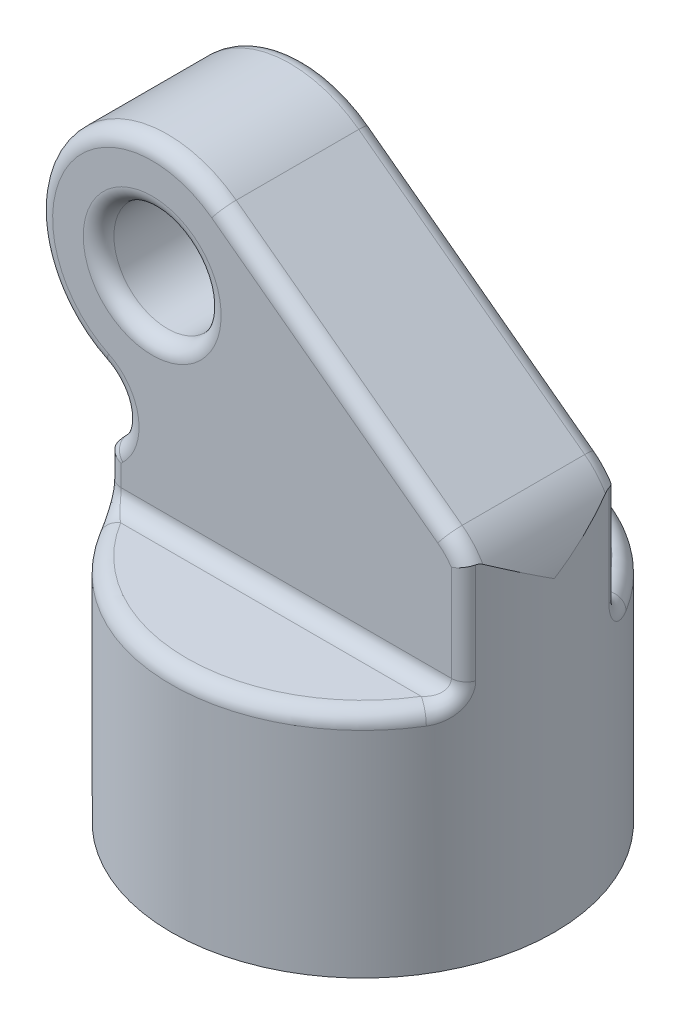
ISO-10303-21;
HEADER;
FILE_DESCRIPTION(('STEP AP214'),'2;1');
FILE_NAME('part.step','',(''),(''),'','','');
FILE_SCHEMA(('AUTOMOTIVE_DESIGN { 1 0 10303 214 1 1 1 1 }'));
ENDSEC;
DATA;
#1=APPLICATION_CONTEXT('core data for automotive mechanical design processes');
#2=APPLICATION_PROTOCOL_DEFINITION('international standard','automotive_design',2000,#1);
#3=PRODUCT_CONTEXT('',#1,'mechanical');
#4=PRODUCT('Part','Part','',(#3));
#5=PRODUCT_RELATED_PRODUCT_CATEGORY('part','',(#4));
#6=PRODUCT_DEFINITION_FORMATION('','',#4);
#7=PRODUCT_DEFINITION_CONTEXT('part definition',#1,'design');
#8=PRODUCT_DEFINITION('design','',#6,#7);
#9=PRODUCT_DEFINITION_SHAPE('','',#8);
#10=(LENGTH_UNIT() NAMED_UNIT(*) SI_UNIT(.MILLI.,.METRE.));
#11=(NAMED_UNIT(*) PLANE_ANGLE_UNIT() SI_UNIT($,.RADIAN.));
#12=(NAMED_UNIT(*) SI_UNIT($,.STERADIAN.) SOLID_ANGLE_UNIT());
#13=UNCERTAINTY_MEASURE_WITH_UNIT(LENGTH_MEASURE(1.E-05),#10,'distance_accuracy_value','');
#14=(GEOMETRIC_REPRESENTATION_CONTEXT(3) GLOBAL_UNCERTAINTY_ASSIGNED_CONTEXT((#13)) GLOBAL_UNIT_ASSIGNED_CONTEXT((#10,
#11,#12)) REPRESENTATION_CONTEXT('',''));
#15=CARTESIAN_POINT('',(0.,0.,0.));
#16=DIRECTION('',(0.,0.,1.));
#17=DIRECTION('',(1.,0.,0.));
#18=AXIS2_PLACEMENT_3D('',#15,#16,#17);
#19=CARTESIAN_POINT('',(-4.6226502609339,173.013178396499,25.0000002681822));
#20=DIRECTION('',(0.,0.,-1.));
#21=DIRECTION('',(-1.,0.,0.));
#22=AXIS2_PLACEMENT_3D('',#19,#20,#21);
#23=PLANE('',#22);
#24=DIRECTION('',(0.,1.,0.));
#25=VECTOR('',#24,1.);
#26=CARTESIAN_POINT('',(-58.5322968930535,148.013178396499,25.0000002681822));
#27=LINE('',#26,#25);
#28=CARTESIAN_POINT('',(-58.5322968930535,159.882795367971,25.0000002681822));
#29=VERTEX_POINT('',#28);
#30=CARTESIAN_POINT('',(-58.5322968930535,153.013178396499,25.0000002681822));
#31=VERTEX_POINT('',#30);
#32=EDGE_CURVE('E73',#29,#31,#27,.F.);
#33=ORIENTED_EDGE('',*,*,#32,.T.);
#34=DIRECTION('',(1.,0.,0.));
#35=VECTOR('',#34,1.);
#36=CARTESIAN_POINT('',(-4.6226502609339,153.013178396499,25.0000002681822));
#37=LINE('',#36,#35);
#38=CARTESIAN_POINT('',(49.2869963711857,153.013178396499,25.0000002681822));
#39=VERTEX_POINT('',#38);
#40=EDGE_CURVE('E13',#31,#39,#37,.T.);
#41=ORIENTED_EDGE('',*,*,#40,.T.);
#42=DIRECTION('',(0.,1.,0.));
#43=VECTOR('',#42,1.);
#44=CARTESIAN_POINT('',(49.2869963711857,188.299273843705,25.0000002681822));
#45=LINE('',#44,#43);
#46=CARTESIAN_POINT('',(49.2869963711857,184.446616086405,25.0000002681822));
#47=VERTEX_POINT('',#46);
#48=EDGE_CURVE('E437',#39,#47,#45,.T.);
#49=ORIENTED_EDGE('',*,*,#48,.T.);
#50=CARTESIAN_POINT('',(32.8773497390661,173.013178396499,25.0000002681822));
#51=DIRECTION('',(0.,0.,-1.));
#52=DIRECTION('',(-1.,0.,0.));
#53=AXIS2_PLACEMENT_3D('',#50,#51,#52);
#54=CIRCLE('',#53,20.);
#55=CARTESIAN_POINT('',(44.8338353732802,189.045721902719,25.0000002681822));
#56=VERTEX_POINT('',#55);
#57=EDGE_CURVE('E435',#47,#56,#54,.F.);
#58=ORIENTED_EDGE('',*,*,#57,.T.);
#59=DIRECTION('',(0.801627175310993,-0.597824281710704,0.));
#60=VECTOR('',#59,1.);
#61=CARTESIAN_POINT('',(20.7361055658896,207.016929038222,25.0000002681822));
#62=LINE('',#61,#60);
#63=CARTESIAN_POINT('',(-28.943361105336,244.066061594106,25.0000002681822));
#64=VERTEX_POINT('',#63);
#65=EDGE_CURVE('E433',#56,#64,#62,.F.);
#66=ORIENTED_EDGE('',*,*,#65,.T.);
#67=CARTESIAN_POINT('',(-48.3726502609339,218.013178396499,25.0000002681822));
#68=DIRECTION('',(0.,0.,-1.));
#69=DIRECTION('',(-1.,0.,0.));
#70=AXIS2_PLACEMENT_3D('',#67,#68,#69);
#71=CIRCLE('',#70,32.5);
#72=CARTESIAN_POINT('',(-62.5390718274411,188.763178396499,25.0000002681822));
#73=VERTEX_POINT('',#72);
#74=EDGE_CURVE('E431',#64,#73,#71,.F.);
#75=ORIENTED_EDGE('',*,*,#74,.T.);
#76=CARTESIAN_POINT('',(-70.1671449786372,173.013178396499,25.0000002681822));
#77=DIRECTION('',(0.,0.,-1.));
#78=DIRECTION('',(-1.,0.,0.));
#79=AXIS2_PLACEMENT_3D('',#76,#77,#78);
#80=CIRCLE('',#79,17.5);
#81=CARTESIAN_POINT('',(-57.9622279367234,160.471647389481,25.0000002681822));
#82=VERTEX_POINT('',#81);
#83=EDGE_CURVE('E429',#73,#82,#80,.T.);
#84=ORIENTED_EDGE('',*,*,#83,.T.);
#85=CARTESIAN_POINT('',(-48.3726502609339,150.617587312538,25.0000002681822));
#86=DIRECTION('',(0.,0.,-1.));
#87=DIRECTION('',(-1.,0.,0.));
#88=AXIS2_PLACEMENT_3D('',#85,#86,#87);
#89=CIRCLE('',#88,13.75);
#90=EDGE_CURVE('E84',#82,#29,#89,.F.);
#91=ORIENTED_EDGE('',*,*,#90,.T.);
#92=EDGE_LOOP('',(#33,#41,#49,#58,#66,#75,#84,#91));
#93=FACE_BOUND('',#92,.T.);
#94=CARTESIAN_POINT('',(-48.3726502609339,218.013178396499,25.0000002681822));
#95=DIRECTION('',(0.,0.,-1.));
#96=DIRECTION('',(-1.,0.,0.));
#97=AXIS2_PLACEMENT_3D('',#94,#95,#96);
#98=CIRCLE('',#97,22.5);
#99=CARTESIAN_POINT('',(-70.8726502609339,218.013178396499,25.0000002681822));
#100=VERTEX_POINT('',#99);
#101=EDGE_CURVE('E439',#100,#100,#98,.T.);
#102=ORIENTED_EDGE('',*,*,#101,.T.);
#103=EDGE_LOOP('',(#102));
#104=FACE_BOUND('',#103,.T.);
#105=ADVANCED_FACE('F64',(#93,#104),#23,.F.);
#106=CARTESIAN_POINT('',(32.8773497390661,173.013178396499,-190.741703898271));
#107=DIRECTION('',(0.,0.,1.));
#108=DIRECTION('',(1.,0.,0.));
#109=AXIS2_PLACEMENT_3D('',#106,#107,#108);
#110=CYLINDRICAL_SURFACE('',#109,25.);
#111=CARTESIAN_POINT('',(52.6595459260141,188.299273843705,-24.9999997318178));
#112=CARTESIAN_POINT('',(53.0372220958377,187.810441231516,-24.1345777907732));
#113=CARTESIAN_POINT('',(53.3933388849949,187.312207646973,-23.2651729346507));
#114=CARTESIAN_POINT('',(54.0632001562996,186.299590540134,-21.519652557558));
#115=CARTESIAN_POINT('',(54.3769510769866,185.785209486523,-20.6435380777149));
#116=CARTESIAN_POINT('',(54.9628967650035,184.742878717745,-18.8857238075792));
#117=CARTESIAN_POINT('',(55.2350978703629,184.214931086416,-18.0040248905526));
#118=CARTESIAN_POINT('',(55.7386827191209,183.147655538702,-16.235900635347));
#119=CARTESIAN_POINT('',(55.9700649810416,182.608327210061,-15.3494751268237));
#120=CARTESIAN_POINT('',(56.6016579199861,180.982197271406,-12.693874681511));
#121=CARTESIAN_POINT('',(56.9424922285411,179.881522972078,-10.9187758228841));
#122=CARTESIAN_POINT('',(57.4685006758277,177.658526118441,-7.36020328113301));
#123=CARTESIAN_POINT('',(57.6537361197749,176.536212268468,-5.57673317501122));
#124=CARTESIAN_POINT('',(57.8003120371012,175.014123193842,-3.16509288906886));
#125=CARTESIAN_POINT('',(57.8289414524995,174.618030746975,-2.53815970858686));
#126=CARTESIAN_POINT('',(57.8673056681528,173.825311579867,-1.28409991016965));
#127=CARTESIAN_POINT('',(57.8770427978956,173.42868493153,-0.656973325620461));
#128=CARTESIAN_POINT('',(57.8773473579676,173.025777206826,-0.0199202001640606));
#129=CARTESIAN_POINT('',(57.8773497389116,173.019477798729,-0.00995996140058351));
#130=CARTESIAN_POINT('',(57.8773497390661,173.013178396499,2.68182184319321E-07));
#131=B_SPLINE_CURVE_WITH_KNOTS('',3,(#111,#112,#113,#114,#115,#116,#117,#118,#119,#120,#121,
#122,#123,#124,#125,#126,#127,#128,#129,#130),.UNSPECIFIED.,.F.,.F.,(4,2,2,2,2,2,2,2,2,4),(0.,
3.18941435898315,6.37834346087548,9.56678563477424,12.7553435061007,19.0976922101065,
25.4375408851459,27.6637723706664,29.8897293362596,29.9250846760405),.UNSPECIFIED.);
#132=CARTESIAN_POINT('',(54.5909461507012,185.403486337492,-19.9999997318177));
#133=VERTEX_POINT('',#132);
#134=CARTESIAN_POINT('',(57.8773497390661,173.013178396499,2.68182184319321E-07));
#135=VERTEX_POINT('',#134);
#136=EDGE_CURVE('E539',#133,#135,#131,.T.);
#137=ORIENTED_EDGE('',*,*,#136,.F.);
#138=CARTESIAN_POINT('',(32.8773497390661,173.013178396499,-19.9999997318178));
#139=DIRECTION('',(0.,0.,-1.));
#140=DIRECTION('',(-1.,0.,0.));
#141=AXIS2_PLACEMENT_3D('',#138,#139,#140);
#142=CIRCLE('',#141,25.);
#143=CARTESIAN_POINT('',(47.8229567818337,193.053857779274,-19.9999997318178));
#144=VERTEX_POINT('',#143);
#145=EDGE_CURVE('E442',#133,#144,#142,.F.);
#146=ORIENTED_EDGE('',*,*,#145,.T.);
#147=DIRECTION('',(0.,0.,1.));
#148=VECTOR('',#147,1.);
#149=CARTESIAN_POINT('',(47.8229567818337,193.053857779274,-190.741703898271));
#150=LINE('',#149,#148);
#151=CARTESIAN_POINT('',(47.8229567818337,193.053857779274,20.0000002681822));
#152=VERTEX_POINT('',#151);
#153=EDGE_CURVE('E237',#144,#152,#150,.T.);
#154=ORIENTED_EDGE('',*,*,#153,.T.);
#155=CARTESIAN_POINT('',(32.8773497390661,173.013178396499,20.0000002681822));
#156=DIRECTION('',(0.,0.,-1.));
#157=DIRECTION('',(-1.,0.,0.));
#158=AXIS2_PLACEMENT_3D('',#155,#156,#157);
#159=CIRCLE('',#158,25.);
#160=CARTESIAN_POINT('',(54.5909461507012,185.403486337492,20.0000002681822));
#161=VERTEX_POINT('',#160);
#162=EDGE_CURVE('E444',#152,#161,#159,.T.);
#163=ORIENTED_EDGE('',*,*,#162,.T.);
#164=CARTESIAN_POINT('',(52.6595459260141,188.299273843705,25.0000002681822));
#165=CARTESIAN_POINT('',(53.0372220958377,187.810441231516,24.1345783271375));
#166=CARTESIAN_POINT('',(53.3933388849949,187.312207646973,23.2651734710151));
#167=CARTESIAN_POINT('',(54.0632001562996,186.299590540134,21.5196530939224));
#168=CARTESIAN_POINT('',(54.3769510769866,185.785209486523,20.6435386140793));
#169=CARTESIAN_POINT('',(54.9628967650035,184.742878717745,18.8857243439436));
#170=CARTESIAN_POINT('',(55.2350978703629,184.214931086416,18.004025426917));
#171=CARTESIAN_POINT('',(55.7386827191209,183.147655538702,16.2359011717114));
#172=CARTESIAN_POINT('',(55.9700649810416,182.608327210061,15.3494756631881));
#173=CARTESIAN_POINT('',(56.6016579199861,180.982197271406,12.6938752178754));
#174=CARTESIAN_POINT('',(56.9424922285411,179.881522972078,10.9187763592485));
#175=CARTESIAN_POINT('',(57.4685006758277,177.658526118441,7.36020381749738));
#176=CARTESIAN_POINT('',(57.6537361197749,176.536212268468,5.57673371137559));
#177=CARTESIAN_POINT('',(57.8003120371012,175.014123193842,3.16509342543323));
#178=CARTESIAN_POINT('',(57.8289414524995,174.618030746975,2.53816024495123));
#179=CARTESIAN_POINT('',(57.8673056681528,173.825311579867,1.28410044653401));
#180=CARTESIAN_POINT('',(57.8770427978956,173.42868493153,0.65697386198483));
#181=CARTESIAN_POINT('',(57.8773473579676,173.025777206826,0.0199207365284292));
#182=CARTESIAN_POINT('',(57.8773497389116,173.019477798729,0.00996049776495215));
#183=CARTESIAN_POINT('',(57.8773497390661,173.013178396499,2.68182184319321E-07));
#184=B_SPLINE_CURVE_WITH_KNOTS('',3,(#164,#165,#166,#167,#168,#169,#170,#171,#172,#173,#174,
#175,#176,#177,#178,#179,#180,#181,#182,#183),.UNSPECIFIED.,.F.,.F.,(4,2,2,2,2,2,2,2,2,4),(0.,
3.18941435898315,6.37834346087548,9.56678563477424,12.7553435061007,19.0976922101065,
25.4375408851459,27.6637723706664,29.8897293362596,29.9250846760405),.UNSPECIFIED.);
#185=EDGE_CURVE('E1045',#161,#135,#184,.T.);
#186=ORIENTED_EDGE('',*,*,#185,.T.);
#187=EDGE_LOOP('',(#137,#146,#154,#163,#186));
#188=FACE_BOUND('',#187,.T.);
#189=ADVANCED_FACE('F259',(#188),#110,.T.);
#190=CARTESIAN_POINT('',(-4.6226502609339,73.0131783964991,2.68182184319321E-07));
#191=DIRECTION('',(0.,-1.,0.));
#192=DIRECTION('',(0.,0.,-1.));
#193=AXIS2_PLACEMENT_3D('',#190,#191,#192);
#194=CYLINDRICAL_SURFACE('',#193,62.5);
#195=CARTESIAN_POINT('',(-4.6226502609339,73.0131783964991,2.68182184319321E-07));
#196=DIRECTION('',(0.,-1.,0.));
#197=DIRECTION('',(0.,0.,-1.));
#198=AXIS2_PLACEMENT_3D('',#195,#196,#197);
#199=CIRCLE('',#198,62.5);
#200=CARTESIAN_POINT('',(-4.6226502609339,73.0131783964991,-62.4999997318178));
#201=VERTEX_POINT('',#200);
#202=EDGE_CURVE('E655',#201,#201,#199,.T.);
#203=ORIENTED_EDGE('',*,*,#202,.F.);
#204=EDGE_LOOP('',(#203));
#205=FACE_BOUND('',#204,.T.);
#206=CARTESIAN_POINT('',(-61.4493470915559,164.054941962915,-26.0187723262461));
#207=CARTESIAN_POINT('',(-61.6417099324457,163.867736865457,-25.5986358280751));
#208=CARTESIAN_POINT('',(-61.8288995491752,163.677534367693,-25.1774955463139));
#209=CARTESIAN_POINT('',(-62.1930334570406,163.291573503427,-24.3333576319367));
#210=CARTESIAN_POINT('',(-62.3699781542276,163.095815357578,-23.9103600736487));
#211=CARTESIAN_POINT('',(-62.8855261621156,162.50095003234,-22.6389851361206));
#212=CARTESIAN_POINT('',(-63.2089469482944,162.094150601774,-21.7879989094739));
#213=CARTESIAN_POINT('',(-63.8158301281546,161.263485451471,-20.0807825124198));
#214=CARTESIAN_POINT('',(-64.0993122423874,160.83962828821,-19.2245551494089));
#215=CARTESIAN_POINT('',(-64.6272352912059,159.977421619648,-17.5073325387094));
#216=CARTESIAN_POINT('',(-64.8716741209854,159.539071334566,-16.6463370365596));
#217=CARTESIAN_POINT('',(-65.3208886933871,158.652832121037,-14.9251648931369));
#218=CARTESIAN_POINT('',(-65.5258729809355,158.205008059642,-14.0650092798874));
#219=CARTESIAN_POINT('',(-65.8983568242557,157.299779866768,-12.3416037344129));
#220=CARTESIAN_POINT('',(-66.065851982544,156.842374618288,-11.4783534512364));
#221=CARTESIAN_POINT('',(-66.5126567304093,155.459222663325,-8.88553374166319));
#222=CARTESIAN_POINT('',(-66.7365212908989,154.522068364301,-7.15198725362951));
#223=CARTESIAN_POINT('',(-66.92649156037,153.333930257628,-4.96829675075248));
#224=CARTESIAN_POINT('',(-66.9606386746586,153.089429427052,-4.51967073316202));
#225=CARTESIAN_POINT('',(-67.0192175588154,152.599716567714,-3.62223338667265));
#226=CARTESIAN_POINT('',(-67.0436506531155,152.354504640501,-3.17342209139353));
#227=CARTESIAN_POINT('',(-67.1024045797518,151.618211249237,-1.82689743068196));
#228=CARTESIAN_POINT('',(-67.1221971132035,151.126365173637,-0.928896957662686));
#229=CARTESIAN_POINT('',(-67.1226476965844,150.628910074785,-0.020672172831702));
#230=CARTESIAN_POINT('',(-67.1226502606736,150.623248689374,-0.0103359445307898));
#231=CARTESIAN_POINT('',(-67.1226502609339,150.617587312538,2.68182184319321E-07));
#232=B_SPLINE_CURVE_WITH_KNOTS('',3,(#206,#207,#208,#209,#210,#211,#212,#213,#214,#215,#216,
#217,#218,#219,#220,#221,#222,#223,#224,#225,#226,#227,#228,#229,#230,#231),.UNSPECIFIED.,.F.,
.F.,(4,2,2,2,2,2,2,2,2,2,2,2,4),(0.,1.49560385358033,2.99114838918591,5.98143137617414,
8.97023263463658,11.9591949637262,14.931896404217,17.9049463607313,23.847903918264,
25.3840730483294,26.9200326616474,29.99127955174,30.0266348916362),.UNSPECIFIED.);
#233=CARTESIAN_POINT('',(-67.1226502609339,150.617587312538,2.68182184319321E-07));
#234=VERTEX_POINT('',#233);
#235=CARTESIAN_POINT('',(-63.836246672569,161.221345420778,-19.9999997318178));
#236=VERTEX_POINT('',#235);
#237=EDGE_CURVE('E222',#234,#236,#232,.F.);
#238=ORIENTED_EDGE('',*,*,#237,.T.);
#239=CARTESIAN_POINT('',(-63.836246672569,161.221345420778,-19.9999997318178));
#240=CARTESIAN_POINT('',(-63.8078424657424,161.262776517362,-20.0840986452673));
#241=CARTESIAN_POINT('',(-63.7787730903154,161.301050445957,-20.1695697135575));
#242=CARTESIAN_POINT('',(-63.7193653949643,161.370713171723,-20.3429748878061));
#243=CARTESIAN_POINT('',(-63.6890255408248,161.40209334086,-20.4309119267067));
#244=CARTESIAN_POINT('',(-63.6279367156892,161.456642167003,-20.6066642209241));
#245=CARTESIAN_POINT('',(-63.5972141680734,161.479986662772,-20.69443365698));
#246=CARTESIAN_POINT('',(-63.5348547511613,161.518903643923,-20.8712949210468));
#247=CARTESIAN_POINT('',(-63.5032184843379,161.534481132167,-20.9603858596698));
#248=CARTESIAN_POINT('',(-63.4305392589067,161.560456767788,-21.1635695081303));
#249=CARTESIAN_POINT('',(-63.3892627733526,161.568320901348,-21.2779179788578));
#250=CARTESIAN_POINT('',(-63.3053872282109,161.569970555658,-21.5081810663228));
#251=CARTESIAN_POINT('',(-63.2627776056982,161.563541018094,-21.6240931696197));
#252=CARTESIAN_POINT('',(-63.2200922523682,161.54945650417,-21.7391301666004));
#253=B_SPLINE_CURVE_WITH_KNOTS('',3,(#239,#240,#241,#242,#243,#244,#245,#246,#247,#248,#249,
#250,#251,#252),.UNSPECIFIED.,.F.,.F.,(4,2,2,2,2,2,4),(0.,0.293867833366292,0.5881013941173,
0.875411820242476,1.16253694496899,1.52718570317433,1.89735793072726),.UNSPECIFIED.);
#254=CARTESIAN_POINT('',(-63.2200922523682,161.54945650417,-21.7391301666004));
#255=VERTEX_POINT('',#254);
#256=EDGE_CURVE('E496',#236,#255,#253,.T.);
#257=ORIENTED_EDGE('',*,*,#256,.T.);
#258=DIRECTION('',(0.,-1.,0.));
#259=VECTOR('',#258,1.);
#260=CARTESIAN_POINT('',(-63.2200922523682,73.0131783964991,-21.7391301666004));
#261=LINE('',#260,#259);
#262=CARTESIAN_POINT('',(-63.2200922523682,153.013178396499,-21.7391301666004));
#263=VERTEX_POINT('',#262);
#264=EDGE_CURVE('E359',#255,#263,#261,.T.);
#265=ORIENTED_EDGE('',*,*,#264,.T.);
#266=CARTESIAN_POINT('',(-58.346297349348,154.565857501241,-25.247191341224));
#267=CARTESIAN_POINT('',(-61.8356989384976,154.95878491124,-25.3755554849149));
#268=CARTESIAN_POINT('',(-63.017918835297,156.118536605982,-22.2765032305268));
#269=CARTESIAN_POINT('',(-58.3773365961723,154.441334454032,-25.2064921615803));
#270=CARTESIAN_POINT('',(-61.8646928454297,154.804182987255,-25.3136283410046));
#271=CARTESIAN_POINT('',(-63.0516571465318,155.869490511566,-22.1880267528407));
#272=CARTESIAN_POINT('',(-58.4044832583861,154.31498043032,-25.1706489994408));
#273=CARTESIAN_POINT('',(-61.890128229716,154.646662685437,-25.2591097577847));
#274=CARTESIAN_POINT('',(-63.0811643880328,155.61678246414,-22.1101068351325));
#275=CARTESIAN_POINT('',(-58.4510030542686,154.059509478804,-25.1089455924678));
#276=CARTESIAN_POINT('',(-61.9337750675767,154.327446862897,-25.165340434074));
#277=CARTESIAN_POINT('',(-63.1317293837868,155.105840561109,-21.9759689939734));
#278=CARTESIAN_POINT('',(-58.4703762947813,153.930392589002,-25.0830852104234));
#279=CARTESIAN_POINT('',(-61.9519993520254,154.165706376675,-25.1260623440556));
#280=CARTESIAN_POINT('',(-63.1527872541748,154.847606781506,-21.9197507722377));
#281=CARTESIAN_POINT('',(-58.5013497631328,153.67039202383,-25.0416331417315));
#282=CARTESIAN_POINT('',(-61.9811532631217,153.839565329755,-25.0631468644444));
#283=CARTESIAN_POINT('',(-63.1864540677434,154.32760565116,-21.8296375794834));
#284=CARTESIAN_POINT('',(-58.5129559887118,153.539509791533,-25.0260335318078));
#285=CARTESIAN_POINT('',(-61.9920966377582,153.675122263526,-25.0394799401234));
#286=CARTESIAN_POINT('',(-63.1990695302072,154.065841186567,-21.7957253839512));
#287=CARTESIAN_POINT('',(-58.5284294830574,153.276811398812,-25.0052169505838));
#288=CARTESIAN_POINT('',(-62.0066872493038,153.344868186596,-25.0079108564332));
#289=CARTESIAN_POINT('',(-63.215888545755,153.540444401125,-21.7504719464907));
#290=CARTESIAN_POINT('',(-58.5322969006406,153.144995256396,-24.9999997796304));
#291=CARTESIAN_POINT('',(-62.0103385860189,153.179012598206,-24.999999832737));
#292=CARTESIAN_POINT('',(-63.220092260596,153.276812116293,-21.7391302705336));
#293=CARTESIAN_POINT('',(-58.5322968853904,152.880042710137,-24.9999996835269));
#294=CARTESIAN_POINT('',(-62.010338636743,152.84568502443,-24.9999996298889));
#295=CARTESIAN_POINT('',(-63.2200922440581,152.746907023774,-21.7391300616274));
#296=CARTESIAN_POINT('',(-58.5283516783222,152.746906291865,-25.0053216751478));
#297=CARTESIAN_POINT('',(-62.0066139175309,152.678167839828,-25.0080695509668));
#298=CARTESIAN_POINT('',(-63.2158039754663,152.48063418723,-21.7506996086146));
#299=CARTESIAN_POINT('',(-58.5125639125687,152.481549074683,-25.0265609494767));
#300=CARTESIAN_POINT('',(-61.9917268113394,152.344575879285,-25.0402800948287));
#301=CARTESIAN_POINT('',(-63.1986433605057,151.949919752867,-21.7968719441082));
#302=CARTESIAN_POINT('',(-58.5007183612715,152.349328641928,-25.0424822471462));
#303=CARTESIAN_POINT('',(-61.9805574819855,152.178455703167,-25.0644357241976));
#304=CARTESIAN_POINT('',(-63.1857677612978,151.685478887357,-21.8314834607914));
#305=CARTESIAN_POINT('',(-58.4691264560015,152.086891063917,-25.0847534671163));
#306=CARTESIAN_POINT('',(-61.9508241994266,151.849278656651,-25.1285949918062));
#307=CARTESIAN_POINT('',(-63.1514287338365,151.160603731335,-21.9233774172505));
#308=CARTESIAN_POINT('',(-58.4493850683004,151.956672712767,-25.1110968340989));
#309=CARTESIAN_POINT('',(-61.932256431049,151.68617377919,-25.168606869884));
#310=CARTESIAN_POINT('',(-63.1299707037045,150.900167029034,-21.9806456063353));
#311=CARTESIAN_POINT('',(-58.4019795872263,151.699034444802,-25.1739646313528));
#312=CARTESIAN_POINT('',(-61.8877788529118,151.364293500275,-25.2641531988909));
#313=CARTESIAN_POINT('',(-63.078443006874,150.384890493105,-22.1173147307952));
#314=CARTESIAN_POINT('',(-58.3743125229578,151.571615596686,-25.2104928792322));
#315=CARTESIAN_POINT('',(-61.8618530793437,151.205473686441,-25.3197216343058));
#316=CARTESIAN_POINT('',(-63.0483701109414,150.130052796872,-22.1967239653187));
#317=CARTESIAN_POINT('',(-58.311084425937,151.320659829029,-25.2933213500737));
#318=CARTESIAN_POINT('',(-61.8027850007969,150.893809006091,-25.4458223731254));
#319=CARTESIAN_POINT('',(-62.9796439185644,149.628141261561,-22.3767858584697));
#320=CARTESIAN_POINT('',(-58.2755322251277,151.197118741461,-25.3396106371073));
#321=CARTESIAN_POINT('',(-61.7696322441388,150.740912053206,-25.5163769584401));
#322=CARTESIAN_POINT('',(-62.9410002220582,149.381059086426,-22.4774147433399));
#323=CARTESIAN_POINT('',(-58.196503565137,150.954566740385,-25.4415536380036));
#324=CARTESIAN_POINT('',(-61.6962026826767,150.442211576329,-25.6718963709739));
#325=CARTESIAN_POINT('',(-62.8550995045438,148.895955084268,-22.6990299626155));
#326=CARTESIAN_POINT('',(-58.1530241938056,150.835557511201,-25.497210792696));
#327=CARTESIAN_POINT('',(-61.6558988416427,150.29636695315,-25.756917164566));
#328=CARTESIAN_POINT('',(-62.8078393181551,148.657936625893,-22.8200237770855));
#329=CARTESIAN_POINT('',(-58.0581811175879,150.602923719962,-25.6173287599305));
#330=CARTESIAN_POINT('',(-61.5683460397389,150.013165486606,-25.9405744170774));
#331=CARTESIAN_POINT('',(-62.7047490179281,148.192669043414,-23.0811497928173));
#332=CARTESIAN_POINT('',(-58.0068191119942,150.489298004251,-25.6817876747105));
#333=CARTESIAN_POINT('',(-61.5210675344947,149.875766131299,-26.0392712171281));
#334=CARTESIAN_POINT('',(-62.648920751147,147.965417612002,-23.2212778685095));
#335=CARTESIAN_POINT('',(-57.8962356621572,150.268073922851,-25.8189295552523));
#336=CARTESIAN_POINT('',(-61.4197477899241,149.610598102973,-26.2494393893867));
#337=CARTESIAN_POINT('',(-62.5287213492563,147.522969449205,-23.5194123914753));
#338=CARTESIAN_POINT('',(-57.8370112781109,150.160477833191,-25.8916155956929));
#339=CARTESIAN_POINT('',(-61.3656658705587,149.482797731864,-26.3609917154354));
#340=CARTESIAN_POINT('',(-62.4643470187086,147.307777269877,-23.6774255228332));
#341=CARTESIAN_POINT('',(-57.7098037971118,149.950343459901,-26.045726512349));
#342=CARTESIAN_POINT('',(-61.2500959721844,149.236081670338,-26.5976909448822));
#343=CARTESIAN_POINT('',(-62.3260780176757,146.887508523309,-24.0124492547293));
#344=CARTESIAN_POINT('',(-57.6416976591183,149.847911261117,-26.1272707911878));
#345=CARTESIAN_POINT('',(-61.1884598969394,149.117313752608,-26.7231115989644));
#346=CARTESIAN_POINT('',(-62.2520496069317,146.682644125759,-24.1897194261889));
#347=CARTESIAN_POINT('',(-57.4976126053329,149.650506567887,-26.297373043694));
#348=CARTESIAN_POINT('',(-61.0588069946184,148.891973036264,-26.9848811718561));
#349=CARTESIAN_POINT('',(-62.0954354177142,146.287834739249,-24.5595069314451));
#350=CARTESIAN_POINT('',(-57.4216308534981,149.555536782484,-26.385933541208));
#351=CARTESIAN_POINT('',(-60.9907318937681,148.785386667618,-27.1213403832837));
#352=CARTESIAN_POINT('',(-62.0128465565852,146.097895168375,-24.7520297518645));
#353=CARTESIAN_POINT('',(-57.1821635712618,149.282631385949,-26.6609045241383));
#354=CARTESIAN_POINT('',(-60.7770802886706,148.484893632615,-27.5460026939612));
#355=CARTESIAN_POINT('',(-61.7525560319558,145.552084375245,-25.3497927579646));
#356=CARTESIAN_POINT('',(-57.0070447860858,149.116515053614,-26.8567413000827));
#357=CARTESIAN_POINT('',(-60.6224244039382,148.311203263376,-27.8487518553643));
#358=CARTESIAN_POINT('',(-61.5622095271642,145.219851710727,-25.775524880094));
#359=CARTESIAN_POINT('',(-56.6177114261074,148.81057325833,-27.2779315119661));
#360=CARTESIAN_POINT('',(-60.2839083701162,148.0142578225,-28.4988400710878));
#361=CARTESIAN_POINT('',(-61.1390210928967,144.607968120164,-26.6911557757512));
#362=CARTESIAN_POINT('',(-56.4018726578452,148.672704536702,-27.5043174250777));
#363=CARTESIAN_POINT('',(-60.0982897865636,147.894694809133,-28.8487649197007));
#364=CARTESIAN_POINT('',(-60.9044137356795,144.332230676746,-27.183299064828));
#365=CARTESIAN_POINT('',(-55.9416682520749,148.436380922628,-27.9699476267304));
#366=CARTESIAN_POINT('',(-59.710260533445,147.72385239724,-29.5650616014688));
#367=CARTESIAN_POINT('',(-60.4041915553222,143.859583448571,-28.1955386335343));
#368=CARTESIAN_POINT('',(-55.6972986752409,148.337931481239,-28.2091936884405));
#369=CARTESIAN_POINT('',(-59.5070211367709,147.673304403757,-29.932752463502));
#370=CARTESIAN_POINT('',(-60.1385724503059,143.662684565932,-28.7156387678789));
#371=CARTESIAN_POINT('',(-55.1597243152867,148.172556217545,-28.7169108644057));
#372=CARTESIAN_POINT('',(-59.0699482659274,147.639456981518,-30.7072461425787));
#373=CARTESIAN_POINT('',(-59.554252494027,143.331934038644,-29.8193717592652));
#374=CARTESIAN_POINT('',(-54.8640852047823,148.109522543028,-28.9859962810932));
#375=CARTESIAN_POINT('',(-58.8343897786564,147.664536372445,-31.1152592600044));
#376=CARTESIAN_POINT('',(-59.2329056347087,143.205866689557,-30.4043400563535));
#377=CARTESIAN_POINT('',(-54.2490644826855,148.028374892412,-29.524583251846));
#378=CARTESIAN_POINT('',(-58.3601048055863,147.794847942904,-31.9197356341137));
#379=CARTESIAN_POINT('',(-58.5644048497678,143.043571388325,-31.5751812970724));
#380=CARTESIAN_POINT('',(-53.929649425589,148.010325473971,-29.794084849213));
#381=CARTESIAN_POINT('',(-58.1204187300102,147.902378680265,-32.3173921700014));
#382=CARTESIAN_POINT('',(-58.2172145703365,143.007472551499,-32.161054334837));
#383=CARTESIAN_POINT('',(-53.4166643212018,148.01536503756,-30.2111805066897));
#384=CARTESIAN_POINT('',(-57.7539805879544,148.128149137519,-32.9149624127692));
#385=CARTESIAN_POINT('',(-57.6596220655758,143.017551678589,-33.0677840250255));
#386=CARTESIAN_POINT('',(-53.2287166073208,148.023987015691,-30.3608644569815));
#387=CARTESIAN_POINT('',(-57.6219868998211,148.222879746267,-33.1279448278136));
#388=CARTESIAN_POINT('',(-57.4553310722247,143.034795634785,-33.3931839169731));
#389=CARTESIAN_POINT('',(-52.8485181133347,148.054366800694,-30.657583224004));
#390=CARTESIAN_POINT('',(-57.3626476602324,148.435654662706,-33.5430454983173));
#391=CARTESIAN_POINT('',(-57.0420718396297,143.095555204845,-34.0382247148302));
#392=CARTESIAN_POINT('',(-52.6562664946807,148.076127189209,-30.8046175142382));
#393=CARTESIAN_POINT('',(-57.2352394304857,148.554239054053,-33.7452023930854));
#394=CARTESIAN_POINT('',(-56.8331026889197,143.139075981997,-34.3578644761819));
#395=CARTESIAN_POINT('',(-52.2693104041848,148.132270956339,-31.0947734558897));
#396=CARTESIAN_POINT('',(-56.987971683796,148.813026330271,-34.135343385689));
#397=CARTESIAN_POINT('',(-56.4124982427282,143.251363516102,-34.9886382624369));
#398=CARTESIAN_POINT('',(-52.0746147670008,148.166617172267,-31.2379053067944));
#399=CARTESIAN_POINT('',(-56.8680880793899,148.953738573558,-34.3233283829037));
#400=CARTESIAN_POINT('',(-56.2008725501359,143.320055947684,-35.2997944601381));
#401=CARTESIAN_POINT('',(-51.6835563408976,148.24755747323,-31.5199836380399));
#402=CARTESIAN_POINT('',(-56.6381903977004,149.255313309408,-34.6831737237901));
#403=CARTESIAN_POINT('',(-55.775809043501,143.481936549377,-35.9130082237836));
#404=CARTESIAN_POINT('',(-51.4871943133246,148.294146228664,-31.6589319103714));
#405=CARTESIAN_POINT('',(-56.5282584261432,149.416751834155,-34.8548915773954));
#406=CARTESIAN_POINT('',(-55.5623720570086,143.575114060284,-36.2150696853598));
#407=CARTESIAN_POINT('',(-51.2905814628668,148.346679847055,-31.7954916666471));
#408=CARTESIAN_POINT('',(-56.4259760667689,149.585512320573,-35.0152276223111));
#409=CARTESIAN_POINT('',(-55.3486624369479,143.680181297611,-36.5119387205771));
#410=(BOUNDED_SURFACE() B_SPLINE_SURFACE(3,2,((#266,#267,#268),(#269,#270,#271),(#272,#273,
#274),(#275,#276,#277),(#278,#279,#280),(#281,#282,#283),(#284,#285,#286),(#287,#288,#289),
(#290,#291,#292),(#293,#294,#295),(#296,#297,#298),(#299,#300,#301),(#302,#303,#304),(#305,#306,
#307),(#308,#309,#310),(#311,#312,#313),(#314,#315,#316),(#317,#318,#319),(#320,#321,#322),
(#323,#324,#325),(#326,#327,#328),(#329,#330,#331),(#332,#333,#334),(#335,#336,#337),(#338,#339,
#340),(#341,#342,#343),(#344,#345,#346),(#347,#348,#349),(#350,#351,#352),(#353,#354,#355),
(#356,#357,#358),(#359,#360,#361),(#362,#363,#364),(#365,#366,#367),(#368,#369,#370),(#371,#372,
#373),(#374,#375,#376),(#377,#378,#379),(#380,#381,#382),(#383,#384,#385),(#386,#387,#388),
(#389,#390,#391),(#392,#393,#394),(#395,#396,#397),(#398,#399,#400),(#401,#402,#403),(#404,#405,
#406),(#407,#408,#409)),.UNSPECIFIED.,.F.,.F.,.F.) B_SPLINE_SURFACE_WITH_KNOTS((4,2,2,2,2,2,2,2,
2,2,2,2,2,2,2,2,2,2,2,2,2,2,2,4),(3,3),(0.,0.791302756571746,1.58259463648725,2.37327476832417,
3.16393969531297,3.9625152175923,4.76139340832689,5.5597699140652,6.35844607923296,
7.15623214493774,7.95431188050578,8.75221981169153,9.5504269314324,10.3611806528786,
11.1722273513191,12.7929183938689,14.5030469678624,16.2134119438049,18.0865644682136,
19.9624036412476,21.0231963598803,22.0841975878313,23.1420908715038,24.199524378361),(0.,1.),
.UNSPECIFIED.) GEOMETRIC_REPRESENTATION_ITEM() RATIONAL_B_SPLINE_SURFACE(((1.,0.81816961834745,
1.),(1.,0.818644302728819,1.),(1.,0.819052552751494,1.),(1.,0.819744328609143,1.),(1.,
0.820027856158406,1.),(1.,0.82047817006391,1.),(1.,0.820645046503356,1.),(1.,0.820866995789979,
1.),(1.,0.820922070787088,1.),(1.,0.820922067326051,1.),(1.,0.820865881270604,1.),(1.,
0.820639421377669,1.),(1.,0.820469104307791,1.),(1.,0.820009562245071,1.),(1.,0.819720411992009,
1.),(1.,0.819015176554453,1.),(1.,0.818599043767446,1.),(1.,0.817629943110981,1.),(1.,
0.81707712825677,1.),(1.,0.815821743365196,1.),(1.,0.815119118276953,1.),(1.,0.813550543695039,
1.),(1.,0.812684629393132,1.),(1.,0.810774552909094,1.),(1.,0.809730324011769,1.),(1.,
0.807431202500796,1.),(1.,0.806173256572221,1.),(1.,0.803444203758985,1.),(1.,0.801973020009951,
1.),(1.,0.797219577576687,1.),(1.,0.793595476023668,1.),(1.,0.785130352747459,1.),(1.,
0.780233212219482,1.),(1.,0.769285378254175,1.),(1.,0.763234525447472,1.),(1.,0.749343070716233,
1.),(1.,0.741386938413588,1.),(1.,0.724116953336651,1.),(1.,0.714801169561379,1.),(1.,
0.699240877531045,1.),(1.,0.693420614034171,1.),(1.,0.681395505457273,1.),(1.,0.6751905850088,
1.),(1.,0.662439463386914,1.),(1.,0.655894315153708,1.),(1.,0.64247571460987,1.),(1.,
0.635602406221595,1.),(1.,0.628576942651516,1.))) REPRESENTATION_ITEM('') SURFACE());
#411=CARTESIAN_POINT('',(-55.3486624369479,143.680181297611,-36.5119387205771));
#412=CARTESIAN_POINT('',(-55.5623720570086,143.575114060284,-36.2150696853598));
#413=CARTESIAN_POINT('',(-55.775809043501,143.481936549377,-35.9130082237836));
#414=CARTESIAN_POINT('',(-56.2008725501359,143.320055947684,-35.2997944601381));
#415=CARTESIAN_POINT('',(-56.4124982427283,143.251363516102,-34.9886382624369));
#416=CARTESIAN_POINT('',(-56.8331026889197,143.139075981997,-34.3578644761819));
#417=CARTESIAN_POINT('',(-57.0420718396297,143.095555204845,-34.0382247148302));
#418=CARTESIAN_POINT('',(-57.4553310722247,143.034795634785,-33.3931839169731));
#419=CARTESIAN_POINT('',(-57.6596220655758,143.017551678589,-33.0677840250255));
#420=CARTESIAN_POINT('',(-58.2172145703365,143.007472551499,-32.161054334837));
#421=CARTESIAN_POINT('',(-58.5644048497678,143.043571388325,-31.5751812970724));
#422=CARTESIAN_POINT('',(-59.2329056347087,143.205866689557,-30.4043400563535));
#423=CARTESIAN_POINT('',(-59.554252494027,143.331934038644,-29.8193717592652));
#424=CARTESIAN_POINT('',(-60.1385724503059,143.662684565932,-28.7156387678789));
#425=CARTESIAN_POINT('',(-60.4041915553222,143.859583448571,-28.1955386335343));
#426=CARTESIAN_POINT('',(-60.9044137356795,144.332230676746,-27.183299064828));
#427=CARTESIAN_POINT('',(-61.1390210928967,144.607968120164,-26.6911557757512));
#428=CARTESIAN_POINT('',(-61.5622095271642,145.219851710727,-25.775524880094));
#429=CARTESIAN_POINT('',(-61.7525560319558,145.552084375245,-25.3497927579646));
#430=CARTESIAN_POINT('',(-62.0128465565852,146.097895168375,-24.7520297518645));
#431=CARTESIAN_POINT('',(-62.0954354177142,146.287834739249,-24.5595069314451));
#432=CARTESIAN_POINT('',(-62.2520496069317,146.682644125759,-24.1897194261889));
#433=CARTESIAN_POINT('',(-62.3260780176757,146.887508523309,-24.0124492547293));
#434=CARTESIAN_POINT('',(-62.4643470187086,147.307777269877,-23.6774255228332));
#435=CARTESIAN_POINT('',(-62.5287213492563,147.522969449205,-23.5194123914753));
#436=CARTESIAN_POINT('',(-62.648920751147,147.965417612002,-23.2212778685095));
#437=CARTESIAN_POINT('',(-62.7047490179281,148.192669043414,-23.0811497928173));
#438=CARTESIAN_POINT('',(-62.8078393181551,148.657936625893,-22.8200237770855));
#439=CARTESIAN_POINT('',(-62.8550995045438,148.895955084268,-22.6990299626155));
#440=CARTESIAN_POINT('',(-62.9410002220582,149.381059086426,-22.4774147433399));
#441=CARTESIAN_POINT('',(-62.9796439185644,149.628141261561,-22.3767858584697));
#442=CARTESIAN_POINT('',(-63.0483701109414,150.130052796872,-22.1967239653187));
#443=CARTESIAN_POINT('',(-63.078443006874,150.384890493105,-22.1173147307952));
#444=CARTESIAN_POINT('',(-63.1299707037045,150.900167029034,-21.9806456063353));
#445=CARTESIAN_POINT('',(-63.1514287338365,151.160603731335,-21.9233774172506));
#446=CARTESIAN_POINT('',(-63.1857677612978,151.685478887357,-21.8314834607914));
#447=CARTESIAN_POINT('',(-63.1986433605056,151.949919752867,-21.7968719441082));
#448=CARTESIAN_POINT('',(-63.2158039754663,152.48063418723,-21.7506996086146));
#449=CARTESIAN_POINT('',(-63.2200922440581,152.746907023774,-21.7391300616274));
#450=CARTESIAN_POINT('',(-63.220092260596,153.276812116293,-21.7391302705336));
#451=CARTESIAN_POINT('',(-63.215888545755,153.540444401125,-21.7504719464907));
#452=CARTESIAN_POINT('',(-63.1990695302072,154.065841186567,-21.7957253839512));
#453=CARTESIAN_POINT('',(-63.1864540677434,154.32760565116,-21.8296375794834));
#454=CARTESIAN_POINT('',(-63.1527872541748,154.847606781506,-21.9197507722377));
#455=CARTESIAN_POINT('',(-63.1317293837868,155.105840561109,-21.9759689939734));
#456=CARTESIAN_POINT('',(-63.0811643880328,155.61678246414,-22.1101068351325));
#457=CARTESIAN_POINT('',(-63.0516571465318,155.869490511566,-22.1880267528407));
#458=CARTESIAN_POINT('',(-63.017918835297,156.118536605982,-22.2765032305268));
#459=B_SPLINE_CURVE_WITH_KNOTS('',3,(#411,#412,#413,#414,#415,#416,#417,#418,#419,#420,#421,
#422,#423,#424,#425,#426,#427,#428,#429,#430,#431,#432,#433,#434,#435,#436,#437,#438,#439,#440,
#441,#442,#443,#444,#445,#446,#447,#448,#449,#450,#451,#452,#453,#454,#455,#456,#457,#458),
.UNSPECIFIED.,.F.,.F.,(4,2,2,2,2,2,2,2,2,2,2,2,2,2,2,2,2,2,2,2,2,2,2,4),(0.,1.05743350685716,
2.11532679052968,3.17632801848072,4.23712073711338,6.11295991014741,7.98611243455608,
9.69647741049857,11.4066059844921,13.0272970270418,13.8383437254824,14.6490974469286,
15.4473045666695,16.2452124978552,17.0432922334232,17.841078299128,18.6397544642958,
19.4381309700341,20.2370091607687,21.035584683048,21.8262496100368,22.6169297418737,
23.4082216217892,24.199524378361),.UNSPECIFIED.);
#460=CARTESIAN_POINT('',(-57.9417178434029,143.013178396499,-32.6086953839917));
#461=VERTEX_POINT('',#460);
#462=EDGE_CURVE('E351',#461,#263,#459,.T.);
#463=ORIENTED_EDGE('',*,*,#462,.F.);
#464=CARTESIAN_POINT('',(-4.6226502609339,143.013178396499,2.68182184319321E-07));
#465=DIRECTION('',(0.,1.,0.));
#466=DIRECTION('',(0.,0.,1.));
#467=AXIS2_PLACEMENT_3D('',#464,#465,#466);
#468=CIRCLE('',#467,62.5);
#469=CARTESIAN_POINT('',(48.6964173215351,143.013178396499,-32.6086953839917));
#470=VERTEX_POINT('',#469);
#471=EDGE_CURVE('E360',#461,#470,#468,.F.);
#472=ORIENTED_EDGE('',*,*,#471,.T.);
#473=CARTESIAN_POINT('',(41.6363867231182,148.464502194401,-32.075944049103));
#474=CARTESIAN_POINT('',(46.9755471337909,149.953355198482,-35.338223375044));
#475=CARTESIAN_POINT('',(45.6589116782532,143.915825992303,-37.1216178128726));
#476=CARTESIAN_POINT('',(41.8734645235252,148.39126097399,-31.9154187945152));
#477=CARTESIAN_POINT('',(47.0867251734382,149.735611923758,-35.1621602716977));
#478=CARTESIAN_POINT('',(45.9166049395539,143.769343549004,-36.7726498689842));
#479=CARTESIAN_POINT('',(42.11086203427,148.326519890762,-31.7511073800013));
#480=CARTESIAN_POINT('',(47.2106824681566,149.526909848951,-34.9680807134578));
#481=CARTESIAN_POINT('',(46.1746457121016,143.639861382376,-36.4154511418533));
#482=CARTESIAN_POINT('',(42.5842178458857,148.214586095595,-31.4159123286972));
#483=CARTESIAN_POINT('',(47.4754878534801,149.139267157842,-34.5538678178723));
#484=CARTESIAN_POINT('',(46.6891628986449,143.415993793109,-35.6867662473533));
#485=CARTESIAN_POINT('',(42.8201748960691,148.167406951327,-31.2450237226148));
#486=CARTESIAN_POINT('',(47.616112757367,148.959316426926,-34.3340745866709));
#487=CARTESIAN_POINT('',(46.9456379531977,143.321635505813,-35.3152692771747));
#488=CARTESIAN_POINT('',(43.2890076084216,148.091128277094,-30.8973254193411));
#489=CARTESIAN_POINT('',(47.909392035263,148.631982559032,-33.872729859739));
#490=CARTESIAN_POINT('',(47.4552387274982,143.169078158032,-34.5594034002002));
#491=CARTESIAN_POINT('',(43.5218697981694,148.062091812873,-30.7204972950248));
#492=CARTESIAN_POINT('',(48.0620534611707,148.483684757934,-33.6312231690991));
#493=CARTESIAN_POINT('',(47.7083498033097,143.111005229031,-34.1749944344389));
#494=CARTESIAN_POINT('',(43.9814774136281,148.023120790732,-30.3628544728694));
#495=CARTESIAN_POINT('',(48.3742447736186,148.222709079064,-33.1321186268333));
#496=CARTESIAN_POINT('',(48.2079232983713,143.033063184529,-33.3975100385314));
#497=CARTESIAN_POINT('',(44.2082252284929,148.013178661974,-30.1820413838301));
#498=CARTESIAN_POINT('',(48.5338735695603,148.109071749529,-32.874470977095));
#499=CARTESIAN_POINT('',(48.4543883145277,143.013178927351,-33.0044381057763));
#500=CARTESIAN_POINT('',(44.610733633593,148.013178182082,-29.8529697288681));
#501=CARTESIAN_POINT('',(48.8254625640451,147.937047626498,-32.3976932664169));
#502=CARTESIAN_POINT('',(48.8918974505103,143.013177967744,-32.2890649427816));
#503=CARTESIAN_POINT('',(44.7879130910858,148.019663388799,-29.7051382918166));
#504=CARTESIAN_POINT('',(48.9565351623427,147.87198629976,-32.1812577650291));
#505=CARTESIAN_POINT('',(49.0844838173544,143.026148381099,-31.9676922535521));
#506=CARTESIAN_POINT('',(45.1358996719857,148.046025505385,-29.4088052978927));
#507=CARTESIAN_POINT('',(49.2185889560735,147.766751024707,-31.7435782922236));
#508=CARTESIAN_POINT('',(49.462730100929,143.078872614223,-31.3234900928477));
#509=CARTESIAN_POINT('',(45.306707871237,148.065900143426,-29.2603038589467));
#510=CARTESIAN_POINT('',(49.3497134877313,147.726174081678,-31.5221638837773));
#511=CARTESIAN_POINT('',(49.6483911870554,143.118621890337,-31.000660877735));
#512=CARTESIAN_POINT('',(45.6407203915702,148.119396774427,-28.9638745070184));
#513=CARTESIAN_POINT('',(49.6099485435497,147.670433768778,-31.0774150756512));
#514=CARTESIAN_POINT('',(50.0114482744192,143.225615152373,-30.3562492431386));
#515=CARTESIAN_POINT('',(45.8039338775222,148.153001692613,-28.8159461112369));
#516=CARTESIAN_POINT('',(49.7392253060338,147.654895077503,-30.8538694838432));
#517=CARTESIAN_POINT('',(50.1888542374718,143.292824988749,-30.0346657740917));
#518=CARTESIAN_POINT('',(46.121899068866,148.234256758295,-28.5217642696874));
#519=CARTESIAN_POINT('',(49.9942339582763,147.649401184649,-30.407432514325));
#520=CARTESIAN_POINT('',(50.5344685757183,143.455335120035,-29.3951400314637));
#521=CARTESIAN_POINT('',(46.2766549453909,148.281899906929,-28.3755100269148));
#522=CARTESIAN_POINT('',(50.1201458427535,147.659146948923,-30.1842902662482));
#523=CARTESIAN_POINT('',(50.7026814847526,143.550621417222,-29.0771960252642));
#524=CARTESIAN_POINT('',(46.577924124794,148.391844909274,-28.0849060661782));
#525=CARTESIAN_POINT('',(50.3678756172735,147.704354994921,-29.7397888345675));
#526=CARTESIAN_POINT('',(51.0301479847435,143.770511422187,-28.4454482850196));
#527=CARTESIAN_POINT('',(46.724369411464,148.454250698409,-27.9405778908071));
#528=CARTESIAN_POINT('',(50.4898534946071,147.739774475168,-29.5181577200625));
#529=CARTESIAN_POINT('',(51.1893276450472,143.895323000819,-28.1316913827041));
#530=CARTESIAN_POINT('',(47.0068138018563,148.593555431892,-27.6565102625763));
#531=CARTESIAN_POINT('',(50.7272925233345,147.836189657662,-29.0814065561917));
#532=CARTESIAN_POINT('',(51.4963324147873,144.173932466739,-27.514153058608));
#533=CARTESIAN_POINT('',(47.1428177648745,148.670447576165,-27.5167686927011));
#534=CARTESIAN_POINT('',(50.8429416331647,147.897003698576,-28.865990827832));
#535=CARTESIAN_POINT('',(51.6441628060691,144.327716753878,-27.2103670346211));
#536=CARTESIAN_POINT('',(47.4036677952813,148.838618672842,-27.2434061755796));
#537=CARTESIAN_POINT('',(51.0665434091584,148.043516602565,-28.4445361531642));
#538=CARTESIAN_POINT('',(51.9276954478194,144.664058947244,-26.6161006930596));
#539=CARTESIAN_POINT('',(47.528511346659,148.929900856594,-27.1097866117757));
#540=CARTESIAN_POINT('',(51.1746708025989,148.129111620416,-28.2382052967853));
#541=CARTESIAN_POINT('',(52.0633949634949,144.846623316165,-26.3256233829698));
#542=CARTESIAN_POINT('',(47.7662936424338,149.126454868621,-26.8504212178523));
#543=CARTESIAN_POINT('',(51.3820721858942,148.324068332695,-27.8379862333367));
#544=CARTESIAN_POINT('',(52.3218539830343,145.239731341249,-25.7617855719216));
#545=CARTESIAN_POINT('',(47.8792340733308,149.231724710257,-26.7246742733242));
#546=CARTESIAN_POINT('',(51.4815087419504,148.433372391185,-27.6438147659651));
#547=CARTESIAN_POINT('',(52.4446153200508,145.450271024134,-25.4884226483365));
#548=CARTESIAN_POINT('',(48.080543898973,149.442903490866,-26.4965027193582));
#549=CARTESIAN_POINT('',(51.6599037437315,148.660612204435,-27.2918466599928));
#550=CARTESIAN_POINT('',(52.6634303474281,145.872628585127,-24.9923975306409));
#551=CARTESIAN_POINT('',(48.1702473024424,149.547386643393,-26.3930503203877));
#552=CARTESIAN_POINT('',(51.7399632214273,148.776097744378,-27.1323247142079));
#553=CARTESIAN_POINT('',(52.7609340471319,146.081594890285,-24.7675010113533));
#554=CARTESIAN_POINT('',(48.3395563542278,149.76620718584,-26.1948770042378));
#555=CARTESIAN_POINT('',(51.8918239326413,149.023205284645,-26.827188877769));
#556=CARTESIAN_POINT('',(52.94496562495,146.519235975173,-24.3366894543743));
#557=CARTESIAN_POINT('',(48.4191632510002,149.880543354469,-26.1001550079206));
#558=CARTESIAN_POINT('',(51.9637122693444,149.154846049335,-26.6814111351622));
#559=CARTESIAN_POINT('',(53.0314948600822,146.747908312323,-24.1307720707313));
#560=CARTESIAN_POINT('',(48.5680173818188,150.118199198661,-25.9206297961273));
#561=CARTESIAN_POINT('',(52.0987224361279,149.432625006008,-26.405579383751));
#562=CARTESIAN_POINT('',(53.1932928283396,147.223220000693,-23.740499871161));
#563=CARTESIAN_POINT('',(48.6372717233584,150.241512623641,-25.8358197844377));
#564=CARTESIAN_POINT('',(52.1619225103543,149.578792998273,-26.2753743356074));
#565=CARTESIAN_POINT('',(53.2685692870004,147.469846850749,-23.5561302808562));
#566=CARTESIAN_POINT('',(48.765345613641,150.49623889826,-25.6770921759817));
#567=CARTESIAN_POINT('',(52.2792395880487,149.883955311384,-26.0321098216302));
#568=CARTESIAN_POINT('',(53.4077800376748,147.979299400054,-23.2110702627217));
#569=CARTESIAN_POINT('',(48.8241659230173,150.627651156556,-25.6031737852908));
#570=CARTESIAN_POINT('',(52.3334161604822,150.043002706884,-25.9189315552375));
#571=CARTESIAN_POINT('',(53.4717151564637,148.242123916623,-23.0503781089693));
#572=CARTESIAN_POINT('',(48.9263656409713,150.885047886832,-25.4734246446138));
#573=CARTESIAN_POINT('',(52.4278510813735,150.356890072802,-25.7205843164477));
#574=CARTESIAN_POINT('',(53.5828018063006,148.756917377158,-22.7683147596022));
#575=CARTESIAN_POINT('',(48.9706679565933,151.01041863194,-25.4165552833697));
#576=CARTESIAN_POINT('',(52.4689595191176,150.510791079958,-25.6337394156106));
#577=CARTESIAN_POINT('',(53.6309564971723,149.007658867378,-22.6446857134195));
#578=CARTESIAN_POINT('',(49.0505924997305,151.266021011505,-25.3131625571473));
#579=CARTESIAN_POINT('',(52.5432960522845,150.826079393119,-25.4760663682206));
#580=CARTESIAN_POINT('',(53.7178310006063,149.518863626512,-22.4199189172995));
#581=CARTESIAN_POINT('',(49.0862153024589,151.396252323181,-25.2666385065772));
#582=CARTESIAN_POINT('',(52.5765514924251,150.987516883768,-25.4051813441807));
#583=CARTESIAN_POINT('',(53.7565514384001,149.779326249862,-22.3187796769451));
#584=CARTESIAN_POINT('',(49.1487895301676,151.660625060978,-25.1844242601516));
#585=CARTESIAN_POINT('',(52.6350693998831,151.316335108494,-25.2800667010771));
#586=CARTESIAN_POINT('',(53.8245669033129,150.308071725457,-22.1400530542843));
#587=CARTESIAN_POINT('',(49.1757393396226,151.794767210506,-25.1487360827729));
#588=CARTESIAN_POINT('',(52.6603502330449,151.483769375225,-25.2257982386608));
#589=CARTESIAN_POINT('',(53.853860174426,150.576356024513,-22.0624700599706));
#590=CARTESIAN_POINT('',(49.2209605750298,152.065839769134,-25.0886035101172));
#591=CARTESIAN_POINT('',(52.7028184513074,151.822849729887,-25.1344446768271));
#592=CARTESIAN_POINT('',(53.9030136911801,151.118501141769,-21.9317470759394));
#593=CARTESIAN_POINT('',(49.239236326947,152.202768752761,-25.0641535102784));
#594=CARTESIAN_POINT('',(52.720023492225,151.994546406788,-25.0973218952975));
#595=CARTESIAN_POINT('',(53.9228786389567,151.392359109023,-21.8785949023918));
#596=CARTESIAN_POINT('',(49.2665419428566,152.472458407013,-25.0275421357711));
#597=CARTESIAN_POINT('',(52.7457414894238,152.33311890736,-25.0417697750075));
#598=CARTESIAN_POINT('',(53.9525586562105,151.931738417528,-21.799004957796));
#599=CARTESIAN_POINT('',(49.2759363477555,152.605144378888,-25.0148965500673));
#600=CARTESIAN_POINT('',(52.754604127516,152.499927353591,-25.0225885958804));
#601=CARTESIAN_POINT('',(53.9627699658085,152.197110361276,-21.7715145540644));
#602=CARTESIAN_POINT('',(49.2868193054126,152.871181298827,-25.0002410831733));
#603=CARTESIAN_POINT('',(52.7648699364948,152.834502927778,-25.0003659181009));
#604=CARTESIAN_POINT('',(53.9745992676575,152.729184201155,-21.739654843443));
#605=CARTESIAN_POINT('',(49.2883080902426,153.004532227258,-24.9982308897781));
#606=CARTESIAN_POINT('',(52.7662761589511,153.002316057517,-24.9973178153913));
#607=CARTESIAN_POINT('',(53.9762175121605,152.995886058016,-21.7352848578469));
#608=CARTESIAN_POINT('',(49.2833790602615,153.271086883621,-25.0048756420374));
#609=CARTESIAN_POINT('',(52.7616244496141,153.337635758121,-25.007392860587));
#610=CARTESIAN_POINT('',(53.9708598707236,153.528995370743,-21.7497299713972));
#611=CARTESIAN_POINT('',(49.2769519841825,153.404290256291,-25.0135430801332));
#612=CARTESIAN_POINT('',(52.755556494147,153.505187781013,-25.0205377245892));
#613=CARTESIAN_POINT('',(53.9638739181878,153.795402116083,-21.7685722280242));
#614=CARTESIAN_POINT('',(49.2561672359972,153.669440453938,-25.041457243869));
#615=CARTESIAN_POINT('',(52.7359710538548,153.838338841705,-25.0628779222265));
#616=CARTESIAN_POINT('',(53.9412818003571,154.325702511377,-21.8292551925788));
#617=CARTESIAN_POINT('',(49.2418088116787,153.801387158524,-25.060704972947));
#618=CARTESIAN_POINT('',(52.7224473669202,154.003984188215,-25.0920866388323));
#619=CARTESIAN_POINT('',(53.9256748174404,154.58959592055,-21.8710980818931));
#620=CARTESIAN_POINT('',(49.2234811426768,153.932216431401,-25.0851885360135));
#621=CARTESIAN_POINT('',(52.7052098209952,154.167859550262,-25.1292522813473));
#622=CARTESIAN_POINT('',(53.9057534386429,154.851254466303,-21.9243232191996));
#623=(BOUNDED_SURFACE() B_SPLINE_SURFACE(3,2,((#473,#474,#475),(#476,#477,#478),(#479,#480,
#481),(#482,#483,#484),(#485,#486,#487),(#488,#489,#490),(#491,#492,#493),(#494,#495,#496),
(#497,#498,#499),(#500,#501,#502),(#503,#504,#505),(#506,#507,#508),(#509,#510,#511),(#512,#513,
#514),(#515,#516,#517),(#518,#519,#520),(#521,#522,#523),(#524,#525,#526),(#527,#528,#529),
(#530,#531,#532),(#533,#534,#535),(#536,#537,#538),(#539,#540,#541),(#542,#543,#544),(#545,#546,
#547),(#548,#549,#550),(#551,#552,#553),(#554,#555,#556),(#557,#558,#559),(#560,#561,#562),
(#563,#564,#565),(#566,#567,#568),(#569,#570,#571),(#572,#573,#574),(#575,#576,#577),(#578,#579,
#580),(#581,#582,#583),(#584,#585,#586),(#587,#588,#589),(#590,#591,#592),(#593,#594,#595),
(#596,#597,#598),(#599,#600,#601),(#602,#603,#604),(#605,#606,#607),(#608,#609,#610),(#611,#612,
#613),(#614,#615,#616),(#617,#618,#619),(#620,#621,#622)),.UNSPECIFIED.,.F.,.F.,
.F.) B_SPLINE_SURFACE_WITH_KNOTS((4,2,2,2,2,2,2,2,2,2,2,2,2,2,2,2,2,2,2,2,2,2,2,2,4),(3,3),(0.,
1.27504990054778,2.55108282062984,3.8315270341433,5.11146345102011,6.14523266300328,
7.17882651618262,8.21113890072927,9.24293748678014,10.282228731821,11.3210333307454,
12.3600715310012,13.3989623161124,14.3200603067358,15.2410442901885,16.1613930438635,
17.0816746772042,17.9172506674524,18.7527712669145,19.5884474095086,20.4237063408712,
21.2229664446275,22.0222030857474,22.8223756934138,23.6226242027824),(0.,1.),
.UNSPECIFIED.) GEOMETRIC_REPRESENTATION_ITEM() RATIONAL_B_SPLINE_SURFACE(((1.,0.613759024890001,
1.),(1.,0.622473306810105,1.),(1.,0.630982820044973,1.),(1.,0.647548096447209,1.),(1.,
0.655603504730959,1.),(1.,0.671229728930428,1.),(1.,0.678798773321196,1.),(1.,0.693379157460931,
1.),(1.,0.700390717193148,1.),(1.,0.712531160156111,1.),(1.,0.717762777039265,1.),(1.,
0.727826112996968,1.),(1.,0.732657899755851,1.),(1.,0.741904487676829,1.),(1.,0.746319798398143,
1.),(1.,0.754730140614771,1.),(1.,0.758725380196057,1.),(1.,0.766322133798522,1.),(1.,
0.769920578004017,1.),(1.,0.776690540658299,1.),(1.,0.779862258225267,1.),(1.,0.785789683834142,
1.),(1.,0.78854529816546,1.),(1.,0.793654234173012,1.),(1.,0.796007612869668,1.),(1.,
0.800088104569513,1.),(1.,0.801855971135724,1.),(1.,0.805110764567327,1.),(1.,0.806597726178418,
1.),(1.,0.809310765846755,1.),(1.,0.810537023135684,1.),(1.,0.812752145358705,1.),(1.,
0.813741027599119,1.),(1.,0.81542251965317,1.),(1.,0.816134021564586,1.),(1.,0.817395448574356,
1.),(1.,0.817945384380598,1.),(1.,0.818897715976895,1.),(1.,0.81930008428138,1.),(1.,
0.819968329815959,1.),(1.,0.820234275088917,1.),(1.,0.82062936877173,1.),(1.,0.820763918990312,
1.),(1.,0.820919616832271,1.),(1.,0.820940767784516,1.),(1.,0.820870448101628,1.),(1.,
0.820778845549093,1.),(1.,0.820479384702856,1.),(1.,0.820271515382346,1.),(1.,0.820003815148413,1.))) REPRESENTATION_ITEM('') SURFACE());
#624=CARTESIAN_POINT('',(53.9057534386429,154.851254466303,-21.9243232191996));
#625=CARTESIAN_POINT('',(53.9256748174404,154.58959592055,-21.8710980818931));
#626=CARTESIAN_POINT('',(53.9412818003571,154.325702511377,-21.8292551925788));
#627=CARTESIAN_POINT('',(53.9638739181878,153.795402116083,-21.7685722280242));
#628=CARTESIAN_POINT('',(53.9708598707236,153.528995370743,-21.7497299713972));
#629=CARTESIAN_POINT('',(53.9762175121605,152.995886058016,-21.7352848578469));
#630=CARTESIAN_POINT('',(53.9745992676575,152.729184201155,-21.739654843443));
#631=CARTESIAN_POINT('',(53.9627699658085,152.197110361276,-21.7715145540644));
#632=CARTESIAN_POINT('',(53.9525586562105,151.931738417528,-21.799004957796));
#633=CARTESIAN_POINT('',(53.9228786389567,151.392359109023,-21.8785949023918));
#634=CARTESIAN_POINT('',(53.9030136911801,151.118501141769,-21.9317470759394));
#635=CARTESIAN_POINT('',(53.853860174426,150.576356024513,-22.0624700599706));
#636=CARTESIAN_POINT('',(53.8245669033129,150.308071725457,-22.1400530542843));
#637=CARTESIAN_POINT('',(53.7565514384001,149.779326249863,-22.3187796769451));
#638=CARTESIAN_POINT('',(53.7178310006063,149.518863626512,-22.4199189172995));
#639=CARTESIAN_POINT('',(53.6309564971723,149.007658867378,-22.6446857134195));
#640=CARTESIAN_POINT('',(53.5828018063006,148.756917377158,-22.7683147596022));
#641=CARTESIAN_POINT('',(53.4717151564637,148.242123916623,-23.0503781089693));
#642=CARTESIAN_POINT('',(53.4077800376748,147.979299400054,-23.2110702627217));
#643=CARTESIAN_POINT('',(53.2685692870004,147.469846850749,-23.5561302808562));
#644=CARTESIAN_POINT('',(53.1932928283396,147.223220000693,-23.740499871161));
#645=CARTESIAN_POINT('',(53.0314948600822,146.747908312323,-24.1307720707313));
#646=CARTESIAN_POINT('',(52.94496562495,146.519235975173,-24.3366894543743));
#647=CARTESIAN_POINT('',(52.7609340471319,146.081594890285,-24.7675010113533));
#648=CARTESIAN_POINT('',(52.6634303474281,145.872628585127,-24.9923975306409));
#649=CARTESIAN_POINT('',(52.4446153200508,145.450271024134,-25.4884226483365));
#650=CARTESIAN_POINT('',(52.3218539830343,145.239731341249,-25.7617855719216));
#651=CARTESIAN_POINT('',(52.0633949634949,144.846623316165,-26.3256233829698));
#652=CARTESIAN_POINT('',(51.9276954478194,144.664058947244,-26.6161006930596));
#653=CARTESIAN_POINT('',(51.6441628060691,144.327716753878,-27.2103670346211));
#654=CARTESIAN_POINT('',(51.4963324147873,144.173932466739,-27.514153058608));
#655=CARTESIAN_POINT('',(51.1893276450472,143.895323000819,-28.1316913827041));
#656=CARTESIAN_POINT('',(51.0301479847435,143.770511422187,-28.4454482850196));
#657=CARTESIAN_POINT('',(50.7026814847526,143.550621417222,-29.0771960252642));
#658=CARTESIAN_POINT('',(50.5344685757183,143.455335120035,-29.3951400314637));
#659=CARTESIAN_POINT('',(50.1888542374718,143.292824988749,-30.0346657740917));
#660=CARTESIAN_POINT('',(50.0114482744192,143.225615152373,-30.3562492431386));
#661=CARTESIAN_POINT('',(49.6483911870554,143.118621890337,-31.000660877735));
#662=CARTESIAN_POINT('',(49.462730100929,143.078872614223,-31.3234900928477));
#663=CARTESIAN_POINT('',(49.0844838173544,143.026148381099,-31.9676922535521));
#664=CARTESIAN_POINT('',(48.8918974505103,143.013177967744,-32.2890649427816));
#665=CARTESIAN_POINT('',(48.4543883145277,143.013178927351,-33.0044381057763));
#666=CARTESIAN_POINT('',(48.2079232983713,143.033063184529,-33.3975100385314));
#667=CARTESIAN_POINT('',(47.7083498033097,143.111005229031,-34.1749944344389));
#668=CARTESIAN_POINT('',(47.4552387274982,143.169078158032,-34.5594034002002));
#669=CARTESIAN_POINT('',(46.9456379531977,143.321635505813,-35.3152692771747));
#670=CARTESIAN_POINT('',(46.6891628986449,143.415993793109,-35.6867662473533));
#671=CARTESIAN_POINT('',(46.1746457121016,143.639861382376,-36.4154511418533));
#672=CARTESIAN_POINT('',(45.9166049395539,143.769343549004,-36.7726498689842));
#673=CARTESIAN_POINT('',(45.6589116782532,143.915825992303,-37.1216178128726));
#674=B_SPLINE_CURVE_WITH_KNOTS('',3,(#624,#625,#626,#627,#628,#629,#630,#631,#632,#633,#634,
#635,#636,#637,#638,#639,#640,#641,#642,#643,#644,#645,#646,#647,#648,#649,#650,#651,#652,#653,
#654,#655,#656,#657,#658,#659,#660,#661,#662,#663,#664,#665,#666,#667,#668,#669,#670,#671,#672,
#673),.UNSPECIFIED.,.F.,.F.,(4,2,2,2,2,2,2,2,2,2,2,2,2,2,2,2,2,2,2,2,2,2,2,2,4),(0.,
0.800248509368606,1.60042111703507,2.39965775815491,3.19891786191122,4.03417679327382,
4.86985293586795,5.70537353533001,6.54094952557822,7.46123115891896,8.38157991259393,
9.30256389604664,10.22366188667,11.2625526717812,12.301590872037,13.3403954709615,
14.3796867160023,15.4114853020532,16.4437976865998,17.4773915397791,18.5111607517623,
19.7910971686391,21.0715413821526,22.3475743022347,23.6226242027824),.UNSPECIFIED.);
#675=CARTESIAN_POINT('',(53.9747917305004,153.013178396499,-21.7391301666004));
#676=VERTEX_POINT('',#675);
#677=EDGE_CURVE('E343',#676,#470,#674,.T.);
#678=ORIENTED_EDGE('',*,*,#677,.F.);
#679=DIRECTION('',(0.,-1.,0.));
#680=VECTOR('',#679,1.);
#681=CARTESIAN_POINT('',(53.9747917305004,73.0131783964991,-21.7391301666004));
#682=LINE('',#681,#680);
#683=CARTESIAN_POINT('',(53.9747917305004,185.834456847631,-21.7391301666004));
#684=VERTEX_POINT('',#683);
#685=EDGE_CURVE('E704',#676,#684,#682,.F.);
#686=ORIENTED_EDGE('',*,*,#685,.T.);
#687=CARTESIAN_POINT('',(53.9747917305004,185.834456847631,-21.7391301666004));
#688=CARTESIAN_POINT('',(54.0059027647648,185.843201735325,-21.6552784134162));
#689=CARTESIAN_POINT('',(54.0369710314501,185.847327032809,-21.570975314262));
#690=CARTESIAN_POINT('',(54.0986993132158,185.84674254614,-21.4023609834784));
#691=CARTESIAN_POINT('',(54.1293597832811,185.842043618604,-21.3180498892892));
#692=CARTESIAN_POINT('',(54.1892860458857,185.824451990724,-21.1521570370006));
#693=CARTESIAN_POINT('',(54.2185676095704,185.8117624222,-21.070558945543));
#694=CARTESIAN_POINT('',(54.2763159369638,185.778924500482,-20.9085907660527));
#695=CARTESIAN_POINT('',(54.3047826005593,185.75877523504,-20.8282208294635));
#696=CARTESIAN_POINT('',(54.3781495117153,185.696939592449,-20.6197539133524));
#697=CARTESIAN_POINT('',(54.4222675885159,185.649650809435,-20.493038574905));
#698=CARTESIAN_POINT('',(54.5085067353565,185.538497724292,-20.2428829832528));
#699=CARTESIAN_POINT('',(54.5505680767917,185.474312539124,-20.1195636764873));
#700=CARTESIAN_POINT('',(54.5909461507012,185.403486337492,-19.9999997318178));
#701=B_SPLINE_CURVE_WITH_KNOTS('',3,(#687,#688,#689,#690,#691,#692,#693,#694,#695,#696,#697,
#698,#699,#700),.UNSPECIFIED.,.F.,.F.,(4,2,2,2,2,2,4),(0.,0.269410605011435,0.538489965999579,
0.800990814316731,1.06352377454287,1.48922160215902,1.92367410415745),.UNSPECIFIED.);
#702=EDGE_CURVE('E335',#684,#133,#701,.T.);
#703=ORIENTED_EDGE('',*,*,#702,.T.);
#704=ORIENTED_EDGE('',*,*,#136,.T.);
#705=ORIENTED_EDGE('',*,*,#185,.F.);
#706=CARTESIAN_POINT('',(54.5909461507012,185.403486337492,20.0000002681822));
#707=CARTESIAN_POINT('',(54.5657826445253,185.44757529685,20.0745005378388));
#708=CARTESIAN_POINT('',(54.5400164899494,185.489063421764,20.1503222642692));
#709=CARTESIAN_POINT('',(54.4872577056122,185.566261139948,20.3045675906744));
#710=CARTESIAN_POINT('',(54.4602635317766,185.60196318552,20.382994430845));
#711=CARTESIAN_POINT('',(54.3789931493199,185.697611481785,20.6175378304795));
#712=CARTESIAN_POINT('',(54.3230689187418,185.748536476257,20.7769537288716));
#713=CARTESIAN_POINT('',(54.2191202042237,185.813577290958,21.0692942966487));
#714=CARTESIAN_POINT('',(54.1717084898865,185.832966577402,21.2012544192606));
#715=CARTESIAN_POINT('',(54.0990887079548,185.846173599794,21.4012283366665));
#716=CARTESIAN_POINT('',(54.0743657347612,185.847860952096,21.4689425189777));
#717=CARTESIAN_POINT('',(54.0247022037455,185.845505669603,21.6042421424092));
#718=CARTESIAN_POINT('',(53.9997615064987,185.841459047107,21.6718274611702));
#719=CARTESIAN_POINT('',(53.9747917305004,185.834456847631,21.7391307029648));
#720=B_SPLINE_CURVE_WITH_KNOTS('',3,(#706,#707,#708,#709,#710,#711,#712,#713,#714,#715,#716,
#717,#718,#719),.UNSPECIFIED.,.F.,.F.,(4,2,2,2,2,2,4),(0.,0.270362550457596,0.541074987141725,
1.06791853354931,1.49102400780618,1.70713392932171,1.92339421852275),.UNSPECIFIED.);
#721=CARTESIAN_POINT('',(53.9747917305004,185.834456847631,21.7391307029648));
#722=VERTEX_POINT('',#721);
#723=EDGE_CURVE('E311',#161,#722,#720,.T.);
#724=ORIENTED_EDGE('',*,*,#723,.T.);
#725=DIRECTION('',(0.,-1.,0.));
#726=VECTOR('',#725,1.);
#727=CARTESIAN_POINT('',(53.9747917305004,73.0131783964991,21.7391307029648));
#728=LINE('',#727,#726);
#729=CARTESIAN_POINT('',(53.9747917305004,153.013178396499,21.7391307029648));
#730=VERTEX_POINT('',#729);
#731=EDGE_CURVE('E652',#722,#730,#728,.T.);
#732=ORIENTED_EDGE('',*,*,#731,.T.);
#733=CARTESIAN_POINT('',(49.1009968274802,154.565857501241,25.2471918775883));
#734=CARTESIAN_POINT('',(52.5903984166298,154.95878491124,25.3755560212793));
#735=CARTESIAN_POINT('',(53.7726183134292,156.118536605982,22.2765037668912));
#736=CARTESIAN_POINT('',(49.1320360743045,154.441334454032,25.2064926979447));
#737=CARTESIAN_POINT('',(52.6193923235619,154.804182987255,25.313628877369));
#738=CARTESIAN_POINT('',(53.806356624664,155.869490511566,22.1880272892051));
#739=CARTESIAN_POINT('',(49.1591827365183,154.31498043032,25.1706495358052));
#740=CARTESIAN_POINT('',(52.6448277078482,154.646662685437,25.2591102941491));
#741=CARTESIAN_POINT('',(53.835863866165,155.61678246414,22.1101073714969));
#742=CARTESIAN_POINT('',(49.2057025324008,154.059509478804,25.1089461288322));
#743=CARTESIAN_POINT('',(52.6884745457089,154.327446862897,25.1653409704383));
#744=CARTESIAN_POINT('',(53.8864288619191,155.105840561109,21.9759695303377));
#745=CARTESIAN_POINT('',(49.2250757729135,153.930392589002,25.0830857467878));
#746=CARTESIAN_POINT('',(52.7066988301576,154.165706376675,25.1260628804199));
#747=CARTESIAN_POINT('',(53.907486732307,154.847606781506,21.9197513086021));
#748=CARTESIAN_POINT('',(49.256049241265,153.67039202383,25.0416336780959));
#749=CARTESIAN_POINT('',(52.7358527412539,153.839565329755,25.0631474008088));
#750=CARTESIAN_POINT('',(53.9411535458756,154.32760565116,21.8296381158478));
#751=CARTESIAN_POINT('',(49.267655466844,153.539509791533,25.0260340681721));
#752=CARTESIAN_POINT('',(52.7467961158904,153.675122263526,25.0394804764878));
#753=CARTESIAN_POINT('',(53.9537690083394,154.065841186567,21.7957259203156));
#754=CARTESIAN_POINT('',(49.2831289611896,153.276811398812,25.0052174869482));
#755=CARTESIAN_POINT('',(52.761386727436,153.344868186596,25.0079113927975));
#756=CARTESIAN_POINT('',(53.9705880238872,153.540444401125,21.7504724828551));
#757=CARTESIAN_POINT('',(49.2869963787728,153.144995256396,25.0000003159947));
#758=CARTESIAN_POINT('',(52.7650380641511,153.179012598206,25.0000003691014));
#759=CARTESIAN_POINT('',(53.9747917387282,153.276812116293,21.7391308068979));
#760=CARTESIAN_POINT('',(49.2869963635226,152.880042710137,25.0000002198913));
#761=CARTESIAN_POINT('',(52.7650381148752,152.84568502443,25.0000001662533));
#762=CARTESIAN_POINT('',(53.9747917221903,152.746907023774,21.7391305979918));
#763=CARTESIAN_POINT('',(49.2830511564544,152.746906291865,25.0053222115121));
#764=CARTESIAN_POINT('',(52.7613133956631,152.678167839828,25.0080700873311));
#765=CARTESIAN_POINT('',(53.9705034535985,152.48063418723,21.750700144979));
#766=CARTESIAN_POINT('',(49.2672633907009,152.481549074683,25.0265614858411));
#767=CARTESIAN_POINT('',(52.7464262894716,152.344575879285,25.040280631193));
#768=CARTESIAN_POINT('',(53.9533428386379,151.949919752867,21.7968724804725));
#769=CARTESIAN_POINT('',(49.2554178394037,152.349328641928,25.0424827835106));
#770=CARTESIAN_POINT('',(52.7352569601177,152.178455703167,25.064436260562));
#771=CARTESIAN_POINT('',(53.94046723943,151.685478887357,21.8314839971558));
#772=CARTESIAN_POINT('',(49.2238259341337,152.086891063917,25.0847540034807));
#773=CARTESIAN_POINT('',(52.7055236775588,151.849278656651,25.1285955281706));
#774=CARTESIAN_POINT('',(53.9061282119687,151.160603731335,21.9233779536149));
#775=CARTESIAN_POINT('',(49.2040845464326,151.956672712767,25.1110973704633));
#776=CARTESIAN_POINT('',(52.6869559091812,151.68617377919,25.1686074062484));
#777=CARTESIAN_POINT('',(53.8846701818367,150.900167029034,21.9806461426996));
#778=CARTESIAN_POINT('',(49.1566790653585,151.699034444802,25.1739651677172));
#779=CARTESIAN_POINT('',(52.642478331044,151.364293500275,25.2641537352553));
#780=CARTESIAN_POINT('',(53.8331424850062,150.384890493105,22.1173152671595));
#781=CARTESIAN_POINT('',(49.12901200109,151.571615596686,25.2104934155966));
#782=CARTESIAN_POINT('',(52.6165525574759,151.205473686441,25.3197221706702));
#783=CARTESIAN_POINT('',(53.8030695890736,150.130052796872,22.196724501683));
#784=CARTESIAN_POINT('',(49.0657839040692,151.320659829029,25.293321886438));
#785=CARTESIAN_POINT('',(52.5574844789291,150.893809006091,25.4458229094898));
#786=CARTESIAN_POINT('',(53.7343433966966,149.628141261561,22.3767863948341));
#787=CARTESIAN_POINT('',(49.0302317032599,151.197118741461,25.3396111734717));
#788=CARTESIAN_POINT('',(52.524331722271,150.740912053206,25.5163774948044));
#789=CARTESIAN_POINT('',(53.6956997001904,149.381059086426,22.4774152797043));
#790=CARTESIAN_POINT('',(48.9512030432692,150.954566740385,25.441554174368));
#791=CARTESIAN_POINT('',(52.4509021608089,150.442211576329,25.6718969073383));
#792=CARTESIAN_POINT('',(53.609798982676,148.895955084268,22.6990304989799));
#793=CARTESIAN_POINT('',(48.9077236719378,150.835557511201,25.4972113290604));
#794=CARTESIAN_POINT('',(52.4105983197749,150.29636695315,25.7569177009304));
#795=CARTESIAN_POINT('',(53.5625387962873,148.657936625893,22.8200243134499));
#796=CARTESIAN_POINT('',(48.8128805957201,150.602923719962,25.6173292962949));
#797=CARTESIAN_POINT('',(52.3230455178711,150.013165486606,25.9405749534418));
#798=CARTESIAN_POINT('',(53.4594484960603,148.192669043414,23.0811503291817));
#799=CARTESIAN_POINT('',(48.7615185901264,150.489298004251,25.6817882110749));
#800=CARTESIAN_POINT('',(52.2757670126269,149.875766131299,26.0392717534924));
#801=CARTESIAN_POINT('',(53.4036202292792,147.965417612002,23.2212784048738));
#802=CARTESIAN_POINT('',(48.6509351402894,150.268073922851,25.8189300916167));
#803=CARTESIAN_POINT('',(52.1744472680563,149.610598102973,26.2494399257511));
#804=CARTESIAN_POINT('',(53.2834208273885,147.522969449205,23.5194129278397));
#805=CARTESIAN_POINT('',(48.5917107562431,150.160477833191,25.8916161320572));
#806=CARTESIAN_POINT('',(52.1203653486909,149.482797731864,26.3609922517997));
#807=CARTESIAN_POINT('',(53.2190464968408,147.307777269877,23.6774260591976));
#808=CARTESIAN_POINT('',(48.464503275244,149.950343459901,26.0457270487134));
#809=CARTESIAN_POINT('',(52.0047954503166,149.236081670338,26.5976914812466));
#810=CARTESIAN_POINT('',(53.0807774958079,146.887508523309,24.0124497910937));
#811=CARTESIAN_POINT('',(48.3963971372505,149.847911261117,26.1272713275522));
#812=CARTESIAN_POINT('',(51.9431593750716,149.117313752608,26.7231121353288));
#813=CARTESIAN_POINT('',(53.0067490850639,146.682644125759,24.1897199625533));
#814=CARTESIAN_POINT('',(48.2523120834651,149.650506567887,26.2973735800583));
#815=CARTESIAN_POINT('',(51.8135064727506,148.891973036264,26.9848817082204));
#816=CARTESIAN_POINT('',(52.8501348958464,146.287834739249,24.5595074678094));
#817=CARTESIAN_POINT('',(48.1763303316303,149.555536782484,26.3859340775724));
#818=CARTESIAN_POINT('',(51.7454313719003,148.785386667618,27.1213409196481));
#819=CARTESIAN_POINT('',(52.7675460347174,146.097895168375,24.7520302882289));
#820=CARTESIAN_POINT('',(47.936863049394,149.282631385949,26.6609050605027));
#821=CARTESIAN_POINT('',(51.5317797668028,148.484893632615,27.5460032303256));
#822=CARTESIAN_POINT('',(52.507255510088,145.552084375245,25.3497932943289));
#823=CARTESIAN_POINT('',(47.761744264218,149.116515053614,26.8567418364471));
#824=CARTESIAN_POINT('',(51.3771238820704,148.311203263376,27.8487523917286));
#825=CARTESIAN_POINT('',(52.3169090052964,145.219851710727,25.7755254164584));
#826=CARTESIAN_POINT('',(47.3724109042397,148.81057325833,27.2779320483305));
#827=CARTESIAN_POINT('',(51.0386078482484,148.0142578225,28.4988406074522));
#828=CARTESIAN_POINT('',(51.8937205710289,144.607968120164,26.6911563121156));
#829=CARTESIAN_POINT('',(47.1565721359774,148.672704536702,27.5043179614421));
#830=CARTESIAN_POINT('',(50.8529892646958,147.894694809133,28.848765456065));
#831=CARTESIAN_POINT('',(51.6591132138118,144.332230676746,27.1832996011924));
#832=CARTESIAN_POINT('',(46.6963677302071,148.436380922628,27.9699481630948));
#833=CARTESIAN_POINT('',(50.4649600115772,147.72385239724,29.5650621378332));
#834=CARTESIAN_POINT('',(51.1588910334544,143.859583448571,28.1955391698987));
#835=CARTESIAN_POINT('',(46.4519981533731,148.337931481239,28.2091942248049));
#836=CARTESIAN_POINT('',(50.2617206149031,147.673304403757,29.9327529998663));
#837=CARTESIAN_POINT('',(50.8932719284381,143.662684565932,28.7156393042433));
#838=CARTESIAN_POINT('',(45.9144237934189,148.172556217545,28.7169114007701));
#839=CARTESIAN_POINT('',(49.8246477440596,147.639456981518,30.707246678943));
#840=CARTESIAN_POINT('',(50.3089519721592,143.331934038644,29.8193722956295));
#841=CARTESIAN_POINT('',(45.6187846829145,148.109522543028,28.9859968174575));
#842=CARTESIAN_POINT('',(49.5890892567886,147.664536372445,31.1152597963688));
#843=CARTESIAN_POINT('',(49.9876051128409,143.205866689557,30.4043405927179));
#844=CARTESIAN_POINT('',(45.0037639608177,148.028374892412,29.5245837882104));
#845=CARTESIAN_POINT('',(49.1148042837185,147.794847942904,31.919736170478));
#846=CARTESIAN_POINT('',(49.3191043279,143.043571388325,31.5751818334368));
#847=CARTESIAN_POINT('',(44.6843489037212,148.010325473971,29.7940853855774));
#848=CARTESIAN_POINT('',(48.8751182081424,147.902378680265,32.3173927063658));
#849=CARTESIAN_POINT('',(48.9719140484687,143.007472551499,32.1610548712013));
#850=CARTESIAN_POINT('',(44.171363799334,148.01536503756,30.2111810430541));
#851=CARTESIAN_POINT('',(48.5086800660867,148.128149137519,32.9149629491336));
#852=CARTESIAN_POINT('',(48.414321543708,143.017551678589,33.0677845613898));
#853=CARTESIAN_POINT('',(43.9834160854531,148.023987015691,30.3608649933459));
#854=CARTESIAN_POINT('',(48.3766863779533,148.222879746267,33.127945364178));
#855=CARTESIAN_POINT('',(48.2100305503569,143.034795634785,33.3931844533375));
#856=CARTESIAN_POINT('',(43.6032175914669,148.054366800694,30.6575837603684));
#857=CARTESIAN_POINT('',(48.1173471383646,148.435654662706,33.5430460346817));
#858=CARTESIAN_POINT('',(47.7967713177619,143.095555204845,34.0382252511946));
#859=CARTESIAN_POINT('',(43.4109659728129,148.076127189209,30.8046180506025));
#860=CARTESIAN_POINT('',(47.9899389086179,148.554239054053,33.7452029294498));
#861=CARTESIAN_POINT('',(47.5878021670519,143.139075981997,34.3578650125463));
#862=CARTESIAN_POINT('',(43.024009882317,148.132270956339,31.0947739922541));
#863=CARTESIAN_POINT('',(47.7426711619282,148.813026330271,34.1353439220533));
#864=CARTESIAN_POINT('',(47.1671977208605,143.251363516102,34.9886387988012));
#865=CARTESIAN_POINT('',(42.829314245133,148.166617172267,31.2379058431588));
#866=CARTESIAN_POINT('',(47.6227875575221,148.953738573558,34.323328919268));
#867=CARTESIAN_POINT('',(46.9555720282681,143.320055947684,35.2997949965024));
#868=CARTESIAN_POINT('',(42.4382558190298,148.24755747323,31.5199841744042));
#869=CARTESIAN_POINT('',(47.3928898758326,149.255313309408,34.6831742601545));
#870=CARTESIAN_POINT('',(46.5305085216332,143.481936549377,35.913008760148));
#871=CARTESIAN_POINT('',(42.2418937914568,148.294146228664,31.6589324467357));
#872=CARTESIAN_POINT('',(47.2829579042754,149.416751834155,34.8548921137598));
#873=CARTESIAN_POINT('',(46.3170715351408,143.575114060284,36.2150702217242));
#874=CARTESIAN_POINT('',(42.045280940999,148.346679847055,31.7954922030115));
#875=CARTESIAN_POINT('',(47.1806755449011,149.585512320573,35.0152281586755));
#876=CARTESIAN_POINT('',(46.1033619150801,143.680181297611,36.5119392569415));
#877=(BOUNDED_SURFACE() B_SPLINE_SURFACE(3,2,((#733,#734,#735),(#736,#737,#738),(#739,#740,
#741),(#742,#743,#744),(#745,#746,#747),(#748,#749,#750),(#751,#752,#753),(#754,#755,#756),
(#757,#758,#759),(#760,#761,#762),(#763,#764,#765),(#766,#767,#768),(#769,#770,#771),(#772,#773,
#774),(#775,#776,#777),(#778,#779,#780),(#781,#782,#783),(#784,#785,#786),(#787,#788,#789),
(#790,#791,#792),(#793,#794,#795),(#796,#797,#798),(#799,#800,#801),(#802,#803,#804),(#805,#806,
#807),(#808,#809,#810),(#811,#812,#813),(#814,#815,#816),(#817,#818,#819),(#820,#821,#822),
(#823,#824,#825),(#826,#827,#828),(#829,#830,#831),(#832,#833,#834),(#835,#836,#837),(#838,#839,
#840),(#841,#842,#843),(#844,#845,#846),(#847,#848,#849),(#850,#851,#852),(#853,#854,#855),
(#856,#857,#858),(#859,#860,#861),(#862,#863,#864),(#865,#866,#867),(#868,#869,#870),(#871,#872,
#873),(#874,#875,#876)),.UNSPECIFIED.,.F.,.F.,.F.) B_SPLINE_SURFACE_WITH_KNOTS((4,2,2,2,2,2,2,2,
2,2,2,2,2,2,2,2,2,2,2,2,2,2,2,4),(3,3),(0.,0.791302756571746,1.58259463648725,2.37327476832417,
3.16393969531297,3.9625152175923,4.76139340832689,5.5597699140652,6.35844607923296,
7.15623214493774,7.95431188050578,8.75221981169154,9.5504269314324,10.3611806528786,
11.1722273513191,12.7929183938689,14.5030469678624,16.2134119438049,18.0865644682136,
19.9624036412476,21.0231963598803,22.0841975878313,23.1420908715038,24.199524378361),(0.,1.),
.UNSPECIFIED.) GEOMETRIC_REPRESENTATION_ITEM() RATIONAL_B_SPLINE_SURFACE(((1.,0.81816961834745,
1.),(1.,0.818644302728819,1.),(1.,0.819052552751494,1.),(1.,0.819744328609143,1.),(1.,
0.820027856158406,1.),(1.,0.82047817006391,1.),(1.,0.820645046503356,1.),(1.,0.820866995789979,
1.),(1.,0.820922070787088,1.),(1.,0.820922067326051,1.),(1.,0.820865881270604,1.),(1.,
0.820639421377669,1.),(1.,0.820469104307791,1.),(1.,0.820009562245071,1.),(1.,0.819720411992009,
1.),(1.,0.819015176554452,1.),(1.,0.818599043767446,1.),(1.,0.81762994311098,1.),(1.,
0.81707712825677,1.),(1.,0.815821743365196,1.),(1.,0.815119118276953,1.),(1.,0.813550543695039,
1.),(1.,0.812684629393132,1.),(1.,0.810774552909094,1.),(1.,0.809730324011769,1.),(1.,
0.807431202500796,1.),(1.,0.806173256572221,1.),(1.,0.803444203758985,1.),(1.,0.801973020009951,
1.),(1.,0.797219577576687,1.),(1.,0.793595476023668,1.),(1.,0.785130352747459,1.),(1.,
0.780233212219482,1.),(1.,0.769285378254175,1.),(1.,0.763234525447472,1.),(1.,0.749343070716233,
1.),(1.,0.741386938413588,1.),(1.,0.724116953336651,1.),(1.,0.714801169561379,1.),(1.,
0.699240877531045,1.),(1.,0.693420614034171,1.),(1.,0.681395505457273,1.),(1.,0.6751905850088,
1.),(1.,0.662439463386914,1.),(1.,0.655894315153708,1.),(1.,0.64247571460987,1.),(1.,
0.635602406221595,1.),(1.,0.628576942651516,1.))) REPRESENTATION_ITEM('') SURFACE());
#878=CARTESIAN_POINT('',(46.1033619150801,143.680181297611,36.5119392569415));
#879=CARTESIAN_POINT('',(46.3170715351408,143.575114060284,36.2150702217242));
#880=CARTESIAN_POINT('',(46.5305085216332,143.481936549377,35.913008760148));
#881=CARTESIAN_POINT('',(46.9555720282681,143.320055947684,35.2997949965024));
#882=CARTESIAN_POINT('',(47.1671977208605,143.251363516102,34.9886387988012));
#883=CARTESIAN_POINT('',(47.5878021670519,143.139075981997,34.3578650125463));
#884=CARTESIAN_POINT('',(47.7967713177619,143.095555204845,34.0382252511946));
#885=CARTESIAN_POINT('',(48.2100305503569,143.034795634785,33.3931844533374));
#886=CARTESIAN_POINT('',(48.414321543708,143.017551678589,33.0677845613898));
#887=CARTESIAN_POINT('',(48.9719140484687,143.007472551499,32.1610548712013));
#888=CARTESIAN_POINT('',(49.3191043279,143.043571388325,31.5751818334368));
#889=CARTESIAN_POINT('',(49.9876051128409,143.205866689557,30.4043405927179));
#890=CARTESIAN_POINT('',(50.3089519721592,143.331934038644,29.8193722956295));
#891=CARTESIAN_POINT('',(50.8932719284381,143.662684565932,28.7156393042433));
#892=CARTESIAN_POINT('',(51.1588910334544,143.859583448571,28.1955391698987));
#893=CARTESIAN_POINT('',(51.6591132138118,144.332230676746,27.1832996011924));
#894=CARTESIAN_POINT('',(51.8937205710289,144.607968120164,26.6911563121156));
#895=CARTESIAN_POINT('',(52.3169090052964,145.219851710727,25.7755254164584));
#896=CARTESIAN_POINT('',(52.507255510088,145.552084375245,25.3497932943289));
#897=CARTESIAN_POINT('',(52.7675460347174,146.097895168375,24.7520302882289));
#898=CARTESIAN_POINT('',(52.8501348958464,146.287834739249,24.5595074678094));
#899=CARTESIAN_POINT('',(53.0067490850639,146.682644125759,24.1897199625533));
#900=CARTESIAN_POINT('',(53.0807774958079,146.887508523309,24.0124497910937));
#901=CARTESIAN_POINT('',(53.2190464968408,147.307777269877,23.6774260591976));
#902=CARTESIAN_POINT('',(53.2834208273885,147.522969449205,23.5194129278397));
#903=CARTESIAN_POINT('',(53.4036202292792,147.965417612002,23.2212784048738));
#904=CARTESIAN_POINT('',(53.4594484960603,148.192669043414,23.0811503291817));
#905=CARTESIAN_POINT('',(53.5625387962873,148.657936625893,22.8200243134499));
#906=CARTESIAN_POINT('',(53.609798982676,148.895955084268,22.6990304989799));
#907=CARTESIAN_POINT('',(53.6956997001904,149.381059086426,22.4774152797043));
#908=CARTESIAN_POINT('',(53.7343433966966,149.628141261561,22.3767863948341));
#909=CARTESIAN_POINT('',(53.8030695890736,150.130052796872,22.196724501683));
#910=CARTESIAN_POINT('',(53.8331424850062,150.384890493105,22.1173152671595));
#911=CARTESIAN_POINT('',(53.8846701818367,150.900167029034,21.9806461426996));
#912=CARTESIAN_POINT('',(53.9061282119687,151.160603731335,21.9233779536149));
#913=CARTESIAN_POINT('',(53.94046723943,151.685478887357,21.8314839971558));
#914=CARTESIAN_POINT('',(53.9533428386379,151.949919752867,21.7968724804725));
#915=CARTESIAN_POINT('',(53.9705034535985,152.48063418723,21.750700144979));
#916=CARTESIAN_POINT('',(53.9747917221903,152.746907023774,21.7391305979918));
#917=CARTESIAN_POINT('',(53.9747917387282,153.276812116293,21.7391308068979));
#918=CARTESIAN_POINT('',(53.9705880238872,153.540444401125,21.7504724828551));
#919=CARTESIAN_POINT('',(53.9537690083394,154.065841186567,21.7957259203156));
#920=CARTESIAN_POINT('',(53.9411535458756,154.32760565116,21.8296381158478));
#921=CARTESIAN_POINT('',(53.907486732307,154.847606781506,21.9197513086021));
#922=CARTESIAN_POINT('',(53.8864288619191,155.105840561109,21.9759695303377));
#923=CARTESIAN_POINT('',(53.835863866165,155.61678246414,22.1101073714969));
#924=CARTESIAN_POINT('',(53.806356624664,155.869490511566,22.1880272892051));
#925=CARTESIAN_POINT('',(53.7726183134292,156.118536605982,22.2765037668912));
#926=B_SPLINE_CURVE_WITH_KNOTS('',3,(#878,#879,#880,#881,#882,#883,#884,#885,#886,#887,#888,
#889,#890,#891,#892,#893,#894,#895,#896,#897,#898,#899,#900,#901,#902,#903,#904,#905,#906,#907,
#908,#909,#910,#911,#912,#913,#914,#915,#916,#917,#918,#919,#920,#921,#922,#923,#924,#925),
.UNSPECIFIED.,.F.,.F.,(4,2,2,2,2,2,2,2,2,2,2,2,2,2,2,2,2,2,2,2,2,2,2,4),(0.,1.05743350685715,
2.11532679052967,3.17632801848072,4.23712073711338,6.11295991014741,7.98611243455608,
9.69647741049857,11.4066059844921,13.0272970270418,13.8383437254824,14.6490974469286,
15.4473045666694,16.2452124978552,17.0432922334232,17.841078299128,18.6397544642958,
19.4381309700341,20.2370091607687,21.035584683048,21.8262496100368,22.6169297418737,
23.4082216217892,24.199524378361),.UNSPECIFIED.);
#927=CARTESIAN_POINT('',(48.6964173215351,143.013178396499,32.6086959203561));
#928=VERTEX_POINT('',#927);
#929=EDGE_CURVE('E302',#928,#730,#926,.T.);
#930=ORIENTED_EDGE('',*,*,#929,.F.);
#931=CARTESIAN_POINT('',(-4.6226502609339,143.013178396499,2.68182184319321E-07));
#932=DIRECTION('',(0.,1.,0.));
#933=DIRECTION('',(0.,0.,1.));
#934=AXIS2_PLACEMENT_3D('',#931,#932,#933);
#935=CIRCLE('',#934,62.5);
#936=CARTESIAN_POINT('',(-57.9417178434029,143.013178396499,32.6086959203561));
#937=VERTEX_POINT('',#936);
#938=EDGE_CURVE('E654',#928,#937,#935,.F.);
#939=ORIENTED_EDGE('',*,*,#938,.T.);
#940=CARTESIAN_POINT('',(-50.881687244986,148.464502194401,32.0759445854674));
#941=CARTESIAN_POINT('',(-56.2208476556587,149.953355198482,35.3382239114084));
#942=CARTESIAN_POINT('',(-54.904212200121,143.915825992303,37.121618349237));
#943=CARTESIAN_POINT('',(-51.1187650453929,148.39126097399,31.9154193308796));
#944=CARTESIAN_POINT('',(-56.3320256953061,149.735611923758,35.1621608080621));
#945=CARTESIAN_POINT('',(-55.1619054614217,143.769343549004,36.7726504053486));
#946=CARTESIAN_POINT('',(-51.3561625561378,148.326519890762,31.7511079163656));
#947=CARTESIAN_POINT('',(-56.4559829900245,149.526909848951,34.9680812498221));
#948=CARTESIAN_POINT('',(-55.4199462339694,143.639861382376,36.4154516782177));
#949=CARTESIAN_POINT('',(-51.8295183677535,148.214586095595,31.4159128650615));
#950=CARTESIAN_POINT('',(-56.7207883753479,149.139267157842,34.5538683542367));
#951=CARTESIAN_POINT('',(-55.9344634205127,143.415993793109,35.6867667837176));
#952=CARTESIAN_POINT('',(-52.0654754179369,148.167406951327,31.2450242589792));
#953=CARTESIAN_POINT('',(-56.8614132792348,148.959316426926,34.3340751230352));
#954=CARTESIAN_POINT('',(-56.1909384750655,143.321635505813,35.3152698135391));
#955=CARTESIAN_POINT('',(-52.5343081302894,148.091128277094,30.8973259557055));
#956=CARTESIAN_POINT('',(-57.1546925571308,148.631982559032,33.8727303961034));
#957=CARTESIAN_POINT('',(-56.700539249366,143.169078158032,34.5594039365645));
#958=CARTESIAN_POINT('',(-52.7671703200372,148.062091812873,30.7204978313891));
#959=CARTESIAN_POINT('',(-57.3073539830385,148.483684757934,33.6312237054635));
#960=CARTESIAN_POINT('',(-56.9536503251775,143.111005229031,34.1749949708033));
#961=CARTESIAN_POINT('',(-53.2267779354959,148.023120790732,30.3628550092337));
#962=CARTESIAN_POINT('',(-57.6195452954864,148.222709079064,33.1321191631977));
#963=CARTESIAN_POINT('',(-57.4532238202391,143.033063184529,33.3975105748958));
#964=CARTESIAN_POINT('',(-53.4535257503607,148.013178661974,30.1820419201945));
#965=CARTESIAN_POINT('',(-57.7791740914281,148.109071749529,32.8744715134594));
#966=CARTESIAN_POINT('',(-57.6996888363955,143.013178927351,33.0044386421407));
#967=CARTESIAN_POINT('',(-53.8560341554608,148.013178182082,29.8529702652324));
#968=CARTESIAN_POINT('',(-58.0707630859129,147.937047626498,32.3976938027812));
#969=CARTESIAN_POINT('',(-58.1371979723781,143.013177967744,32.2890654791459));
#970=CARTESIAN_POINT('',(-54.0332136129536,148.019663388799,29.705138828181));
#971=CARTESIAN_POINT('',(-58.2018356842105,147.87198629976,32.1812583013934));
#972=CARTESIAN_POINT('',(-58.3297843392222,143.026148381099,31.9676927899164));
#973=CARTESIAN_POINT('',(-54.3812001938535,148.046025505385,29.408805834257));
#974=CARTESIAN_POINT('',(-58.4638894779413,147.766751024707,31.743578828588));
#975=CARTESIAN_POINT('',(-58.7080306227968,143.078872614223,31.3234906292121));
#976=CARTESIAN_POINT('',(-54.5520083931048,148.065900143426,29.2603043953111));
#977=CARTESIAN_POINT('',(-58.5950140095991,147.726174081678,31.5221644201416));
#978=CARTESIAN_POINT('',(-58.8936917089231,143.118621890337,31.0006614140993));
#979=CARTESIAN_POINT('',(-54.886020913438,148.119396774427,28.9638750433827));
#980=CARTESIAN_POINT('',(-58.8552490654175,147.670433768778,31.0774156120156));
#981=CARTESIAN_POINT('',(-59.256748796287,143.225615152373,30.356249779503));
#982=CARTESIAN_POINT('',(-55.04923439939,148.153001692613,28.8159466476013));
#983=CARTESIAN_POINT('',(-58.9845258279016,147.654895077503,30.8538700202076));
#984=CARTESIAN_POINT('',(-59.4341547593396,143.292824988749,30.0346663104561));
#985=CARTESIAN_POINT('',(-55.3671995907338,148.234256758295,28.5217648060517));
#986=CARTESIAN_POINT('',(-59.2395344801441,147.649401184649,30.4074330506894));
#987=CARTESIAN_POINT('',(-59.7797690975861,143.455335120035,29.3951405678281));
#988=CARTESIAN_POINT('',(-55.5219554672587,148.281899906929,28.3755105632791));
#989=CARTESIAN_POINT('',(-59.3654463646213,147.659146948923,30.1842908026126));
#990=CARTESIAN_POINT('',(-59.9479820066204,143.550621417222,29.0771965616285));
#991=CARTESIAN_POINT('',(-55.8232246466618,148.391844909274,28.0849066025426));
#992=CARTESIAN_POINT('',(-59.6131761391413,147.704354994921,29.7397893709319));
#993=CARTESIAN_POINT('',(-60.2754485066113,143.770511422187,28.445448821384));
#994=CARTESIAN_POINT('',(-55.9696699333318,148.454250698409,27.9405784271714));
#995=CARTESIAN_POINT('',(-59.7351540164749,147.739774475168,29.5181582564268));
#996=CARTESIAN_POINT('',(-60.434628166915,143.895323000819,28.1316919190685));
#997=CARTESIAN_POINT('',(-56.2521143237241,148.593555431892,27.6565107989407));
#998=CARTESIAN_POINT('',(-59.9725930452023,147.836189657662,29.0814070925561));
#999=CARTESIAN_POINT('',(-60.7416329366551,144.173932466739,27.5141535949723));
#1000=CARTESIAN_POINT('',(-56.3881182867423,148.670447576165,27.5167692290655));
#1001=CARTESIAN_POINT('',(-60.0882421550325,147.897003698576,28.8659913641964));
#1002=CARTESIAN_POINT('',(-60.8894633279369,144.327716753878,27.2103675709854));
#1003=CARTESIAN_POINT('',(-56.6489683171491,148.838618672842,27.2434067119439));
#1004=CARTESIAN_POINT('',(-60.3118439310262,148.043516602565,28.4445366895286));
#1005=CARTESIAN_POINT('',(-61.1729959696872,144.664058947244,26.616101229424));
#1006=CARTESIAN_POINT('',(-56.7738118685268,148.929900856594,27.1097871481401));
#1007=CARTESIAN_POINT('',(-60.4199713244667,148.129111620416,28.2382058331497));
#1008=CARTESIAN_POINT('',(-61.3086954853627,144.846623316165,26.3256239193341));
#1009=CARTESIAN_POINT('',(-57.0115941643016,149.126454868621,26.8504217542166));
#1010=CARTESIAN_POINT('',(-60.627372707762,148.324068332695,27.837986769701));
#1011=CARTESIAN_POINT('',(-61.5671545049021,145.239731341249,25.7617861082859));
#1012=CARTESIAN_POINT('',(-57.1245345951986,149.231724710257,26.7246748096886));
#1013=CARTESIAN_POINT('',(-60.7268092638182,148.433372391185,27.6438153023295));
#1014=CARTESIAN_POINT('',(-61.6899158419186,145.450271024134,25.4884231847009));
#1015=CARTESIAN_POINT('',(-57.3258444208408,149.442903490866,26.4965032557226));
#1016=CARTESIAN_POINT('',(-60.9052042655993,148.660612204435,27.2918471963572));
#1017=CARTESIAN_POINT('',(-61.9087308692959,145.872628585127,24.9923980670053));
#1018=CARTESIAN_POINT('',(-57.4155478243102,149.547386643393,26.3930508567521));
#1019=CARTESIAN_POINT('',(-60.9852637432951,148.776097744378,27.1323252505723));
#1020=CARTESIAN_POINT('',(-62.0062345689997,146.081594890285,24.7675015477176));
#1021=CARTESIAN_POINT('',(-57.5848568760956,149.76620718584,26.1948775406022));
#1022=CARTESIAN_POINT('',(-61.1371244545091,149.023205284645,26.8271894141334));
#1023=CARTESIAN_POINT('',(-62.1902661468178,146.519235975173,24.3366899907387));
#1024=CARTESIAN_POINT('',(-57.664463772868,149.880543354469,26.100155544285));
#1025=CARTESIAN_POINT('',(-61.2090127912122,149.154846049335,26.6814116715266));
#1026=CARTESIAN_POINT('',(-62.27679538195,146.747908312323,24.1307726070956));
#1027=CARTESIAN_POINT('',(-57.8133179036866,150.118199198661,25.9206303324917));
#1028=CARTESIAN_POINT('',(-61.3440229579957,149.432625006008,26.4055799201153));
#1029=CARTESIAN_POINT('',(-62.4385933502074,147.223220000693,23.7405004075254));
#1030=CARTESIAN_POINT('',(-57.8825722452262,150.241512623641,25.8358203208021));
#1031=CARTESIAN_POINT('',(-61.4072230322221,149.578792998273,26.2753748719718));
#1032=CARTESIAN_POINT('',(-62.5138698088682,147.469846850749,23.5561308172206));
#1033=CARTESIAN_POINT('',(-58.0106461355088,150.49623889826,25.677092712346));
#1034=CARTESIAN_POINT('',(-61.5245401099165,149.883955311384,26.0321103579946));
#1035=CARTESIAN_POINT('',(-62.6530805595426,147.979299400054,23.2110707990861));
#1036=CARTESIAN_POINT('',(-58.0694664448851,150.627651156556,25.6031743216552));
#1037=CARTESIAN_POINT('',(-61.57871668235,150.043002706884,25.9189320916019));
#1038=CARTESIAN_POINT('',(-62.7170156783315,148.242123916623,23.0503786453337));
#1039=CARTESIAN_POINT('',(-58.1716661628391,150.885047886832,25.4734251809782));
#1040=CARTESIAN_POINT('',(-61.6731516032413,150.356890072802,25.7205848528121));
#1041=CARTESIAN_POINT('',(-62.8281023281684,148.756917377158,22.7683152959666));
#1042=CARTESIAN_POINT('',(-58.2159684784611,151.01041863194,25.4165558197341));
#1043=CARTESIAN_POINT('',(-61.7142600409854,150.510791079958,25.633739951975));
#1044=CARTESIAN_POINT('',(-62.8762570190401,149.007658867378,22.6446862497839));
#1045=CARTESIAN_POINT('',(-58.2958930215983,151.266021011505,25.3131630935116));
#1046=CARTESIAN_POINT('',(-61.7885965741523,150.826079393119,25.476066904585));
#1047=CARTESIAN_POINT('',(-62.9631315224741,149.518863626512,22.4199194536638));
#1048=CARTESIAN_POINT('',(-58.3315158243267,151.396252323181,25.2666390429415));
#1049=CARTESIAN_POINT('',(-61.8218520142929,150.987516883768,25.405181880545));
#1050=CARTESIAN_POINT('',(-63.0018519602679,149.779326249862,22.3187802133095));
#1051=CARTESIAN_POINT('',(-58.3940900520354,151.660625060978,25.184424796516));
#1052=CARTESIAN_POINT('',(-61.8803699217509,151.316335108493,25.2800672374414));
#1053=CARTESIAN_POINT('',(-63.0698674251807,150.308071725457,22.1400535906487));
#1054=CARTESIAN_POINT('',(-58.4210398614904,151.794767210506,25.1487366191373));
#1055=CARTESIAN_POINT('',(-61.9056507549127,151.483769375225,25.2257987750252));
#1056=CARTESIAN_POINT('',(-63.0991606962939,150.576356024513,22.062470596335));
#1057=CARTESIAN_POINT('',(-58.4662610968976,152.065839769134,25.0886040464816));
#1058=CARTESIAN_POINT('',(-61.9481189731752,151.822849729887,25.1344452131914));
#1059=CARTESIAN_POINT('',(-63.1483142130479,151.118501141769,21.9317476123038));
#1060=CARTESIAN_POINT('',(-58.4845368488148,152.202768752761,25.0641540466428));
#1061=CARTESIAN_POINT('',(-61.9653240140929,151.994546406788,25.0973224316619));
#1062=CARTESIAN_POINT('',(-63.1681791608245,151.392359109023,21.8785954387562));
#1063=CARTESIAN_POINT('',(-58.5118424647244,152.472458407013,25.0275426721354));
#1064=CARTESIAN_POINT('',(-61.9910420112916,152.33311890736,25.0417703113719));
#1065=CARTESIAN_POINT('',(-63.1978591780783,151.931738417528,21.7990054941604));
#1066=CARTESIAN_POINT('',(-58.5212368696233,152.605144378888,25.0148970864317));
#1067=CARTESIAN_POINT('',(-61.9999046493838,152.499927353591,25.0225891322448));
#1068=CARTESIAN_POINT('',(-63.2080704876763,152.197110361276,21.7715150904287));
#1069=CARTESIAN_POINT('',(-58.5321198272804,152.871181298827,25.0002416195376));
#1070=CARTESIAN_POINT('',(-62.0101704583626,152.834502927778,25.0003664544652));
#1071=CARTESIAN_POINT('',(-63.2198997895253,152.729184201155,21.7396553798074));
#1072=CARTESIAN_POINT('',(-58.5336086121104,153.004532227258,24.9982314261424));
#1073=CARTESIAN_POINT('',(-62.0115766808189,153.002316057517,24.9973183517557));
#1074=CARTESIAN_POINT('',(-63.2215180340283,152.995886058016,21.7352853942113));
#1075=CARTESIAN_POINT('',(-58.5286795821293,153.271086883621,25.0048761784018));
#1076=CARTESIAN_POINT('',(-62.0069249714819,153.337635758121,25.0073933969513));
#1077=CARTESIAN_POINT('',(-63.2161603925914,153.528995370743,21.7497305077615));
#1078=CARTESIAN_POINT('',(-58.5222525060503,153.404290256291,25.0135436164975));
#1079=CARTESIAN_POINT('',(-62.0008570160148,153.505187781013,25.0205382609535));
#1080=CARTESIAN_POINT('',(-63.2091744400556,153.795402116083,21.7685727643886));
#1081=CARTESIAN_POINT('',(-58.5014677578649,153.669440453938,25.0414577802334));
#1082=CARTESIAN_POINT('',(-61.9812715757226,153.838338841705,25.0628784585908));
#1083=CARTESIAN_POINT('',(-63.1865823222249,154.325702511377,21.8292557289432));
#1084=CARTESIAN_POINT('',(-58.4871093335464,153.801387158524,25.0607055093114));
#1085=CARTESIAN_POINT('',(-61.967747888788,154.003984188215,25.0920871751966));
#1086=CARTESIAN_POINT('',(-63.1709753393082,154.58959592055,21.8710986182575));
#1087=CARTESIAN_POINT('',(-58.4687816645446,153.932216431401,25.0851890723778));
#1088=CARTESIAN_POINT('',(-61.950510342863,154.167859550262,25.1292528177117));
#1089=CARTESIAN_POINT('',(-63.1510539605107,154.851254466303,21.924323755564));
#1090=(BOUNDED_SURFACE() B_SPLINE_SURFACE(3,2,((#940,#941,#942),(#943,#944,#945),(#946,#947,
#948),(#949,#950,#951),(#952,#953,#954),(#955,#956,#957),(#958,#959,#960),(#961,#962,#963),
(#964,#965,#966),(#967,#968,#969),(#970,#971,#972),(#973,#974,#975),(#976,#977,#978),(#979,#980,
#981),(#982,#983,#984),(#985,#986,#987),(#988,#989,#990),(#991,#992,#993),(#994,#995,#996),
(#997,#998,#999),(#1000,#1001,#1002),(#1003,#1004,#1005),(#1006,#1007,#1008),(#1009,#1010,
#1011),(#1012,#1013,#1014),(#1015,#1016,#1017),(#1018,#1019,#1020),(#1021,#1022,#1023),(#1024,
#1025,#1026),(#1027,#1028,#1029),(#1030,#1031,#1032),(#1033,#1034,#1035),(#1036,#1037,#1038),
(#1039,#1040,#1041),(#1042,#1043,#1044),(#1045,#1046,#1047),(#1048,#1049,#1050),(#1051,#1052,
#1053),(#1054,#1055,#1056),(#1057,#1058,#1059),(#1060,#1061,#1062),(#1063,#1064,#1065),(#1066,
#1067,#1068),(#1069,#1070,#1071),(#1072,#1073,#1074),(#1075,#1076,#1077),(#1078,#1079,#1080),
(#1081,#1082,#1083),(#1084,#1085,#1086),(#1087,#1088,#1089)),.UNSPECIFIED.,.F.,.F.,
.F.) B_SPLINE_SURFACE_WITH_KNOTS((4,2,2,2,2,2,2,2,2,2,2,2,2,2,2,2,2,2,2,2,2,2,2,2,4),(3,3),(0.,
1.27504990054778,2.55108282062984,3.8315270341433,5.11146345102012,6.14523266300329,
7.17882651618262,8.21113890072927,9.24293748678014,10.282228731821,11.3210333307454,
12.3600715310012,13.3989623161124,14.3200603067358,15.2410442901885,16.1613930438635,
17.0816746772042,17.9172506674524,18.7527712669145,19.5884474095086,20.4237063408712,
21.2229664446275,22.0222030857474,22.8223756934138,23.6226242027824),(0.,1.),
.UNSPECIFIED.) GEOMETRIC_REPRESENTATION_ITEM() RATIONAL_B_SPLINE_SURFACE(((1.,0.613759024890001,
1.),(1.,0.622473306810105,1.),(1.,0.630982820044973,1.),(1.,0.647548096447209,1.),(1.,
0.655603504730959,1.),(1.,0.671229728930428,1.),(1.,0.678798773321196,1.),(1.,0.693379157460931,
1.),(1.,0.700390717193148,1.),(1.,0.712531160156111,1.),(1.,0.717762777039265,1.),(1.,
0.727826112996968,1.),(1.,0.732657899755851,1.),(1.,0.741904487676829,1.),(1.,0.746319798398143,
1.),(1.,0.754730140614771,1.),(1.,0.758725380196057,1.),(1.,0.766322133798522,1.),(1.,
0.769920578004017,1.),(1.,0.776690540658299,1.),(1.,0.779862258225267,1.),(1.,0.785789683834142,
1.),(1.,0.78854529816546,1.),(1.,0.793654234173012,1.),(1.,0.796007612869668,1.),(1.,
0.800088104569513,1.),(1.,0.801855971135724,1.),(1.,0.805110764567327,1.),(1.,0.806597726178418,
1.),(1.,0.809310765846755,1.),(1.,0.810537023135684,1.),(1.,0.812752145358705,1.),(1.,
0.813741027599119,1.),(1.,0.81542251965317,1.),(1.,0.816134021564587,1.),(1.,0.817395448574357,
1.),(1.,0.817945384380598,1.),(1.,0.818897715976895,1.),(1.,0.81930008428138,1.),(1.,
0.819968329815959,1.),(1.,0.820234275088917,1.),(1.,0.82062936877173,1.),(1.,0.820763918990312,
1.),(1.,0.820919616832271,1.),(1.,0.820940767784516,1.),(1.,0.820870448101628,1.),(1.,
0.820778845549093,1.),(1.,0.820479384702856,1.),(1.,0.820271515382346,1.),(1.,0.820003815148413,1.))) REPRESENTATION_ITEM('') SURFACE());
#1091=CARTESIAN_POINT('',(-63.1510539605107,154.851254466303,21.924323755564));
#1092=CARTESIAN_POINT('',(-63.1709753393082,154.58959592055,21.8710986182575));
#1093=CARTESIAN_POINT('',(-63.1865823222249,154.325702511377,21.8292557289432));
#1094=CARTESIAN_POINT('',(-63.2091744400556,153.795402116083,21.7685727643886));
#1095=CARTESIAN_POINT('',(-63.2161603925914,153.528995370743,21.7497305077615));
#1096=CARTESIAN_POINT('',(-63.2215180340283,152.995886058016,21.7352853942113));
#1097=CARTESIAN_POINT('',(-63.2198997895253,152.729184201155,21.7396553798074));
#1098=CARTESIAN_POINT('',(-63.2080704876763,152.197110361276,21.7715150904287));
#1099=CARTESIAN_POINT('',(-63.1978591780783,151.931738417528,21.7990054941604));
#1100=CARTESIAN_POINT('',(-63.1681791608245,151.392359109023,21.8785954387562));
#1101=CARTESIAN_POINT('',(-63.1483142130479,151.118501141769,21.9317476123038));
#1102=CARTESIAN_POINT('',(-63.0991606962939,150.576356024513,22.062470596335));
#1103=CARTESIAN_POINT('',(-63.0698674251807,150.308071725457,22.1400535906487));
#1104=CARTESIAN_POINT('',(-63.0018519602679,149.779326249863,22.3187802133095));
#1105=CARTESIAN_POINT('',(-62.9631315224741,149.518863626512,22.4199194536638));
#1106=CARTESIAN_POINT('',(-62.8762570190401,149.007658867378,22.6446862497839));
#1107=CARTESIAN_POINT('',(-62.8281023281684,148.756917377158,22.7683152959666));
#1108=CARTESIAN_POINT('',(-62.7170156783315,148.242123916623,23.0503786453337));
#1109=CARTESIAN_POINT('',(-62.6530805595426,147.979299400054,23.2110707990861));
#1110=CARTESIAN_POINT('',(-62.5138698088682,147.469846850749,23.5561308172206));
#1111=CARTESIAN_POINT('',(-62.4385933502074,147.223220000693,23.7405004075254));
#1112=CARTESIAN_POINT('',(-62.27679538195,146.747908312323,24.1307726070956));
#1113=CARTESIAN_POINT('',(-62.1902661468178,146.519235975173,24.3366899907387));
#1114=CARTESIAN_POINT('',(-62.0062345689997,146.081594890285,24.7675015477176));
#1115=CARTESIAN_POINT('',(-61.9087308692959,145.872628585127,24.9923980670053));
#1116=CARTESIAN_POINT('',(-61.6899158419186,145.450271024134,25.4884231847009));
#1117=CARTESIAN_POINT('',(-61.5671545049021,145.239731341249,25.7617861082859));
#1118=CARTESIAN_POINT('',(-61.3086954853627,144.846623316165,26.3256239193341));
#1119=CARTESIAN_POINT('',(-61.1729959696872,144.664058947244,26.616101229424));
#1120=CARTESIAN_POINT('',(-60.8894633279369,144.327716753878,27.2103675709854));
#1121=CARTESIAN_POINT('',(-60.7416329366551,144.173932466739,27.5141535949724));
#1122=CARTESIAN_POINT('',(-60.434628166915,143.895323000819,28.1316919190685));
#1123=CARTESIAN_POINT('',(-60.2754485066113,143.770511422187,28.445448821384));
#1124=CARTESIAN_POINT('',(-59.9479820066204,143.550621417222,29.0771965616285));
#1125=CARTESIAN_POINT('',(-59.7797690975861,143.455335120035,29.3951405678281));
#1126=CARTESIAN_POINT('',(-59.4341547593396,143.292824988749,30.0346663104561));
#1127=CARTESIAN_POINT('',(-59.256748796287,143.225615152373,30.356249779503));
#1128=CARTESIAN_POINT('',(-58.8936917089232,143.118621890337,31.0006614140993));
#1129=CARTESIAN_POINT('',(-58.7080306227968,143.078872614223,31.3234906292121));
#1130=CARTESIAN_POINT('',(-58.3297843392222,143.026148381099,31.9676927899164));
#1131=CARTESIAN_POINT('',(-58.1371979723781,143.013177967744,32.2890654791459));
#1132=CARTESIAN_POINT('',(-57.6996888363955,143.013178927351,33.0044386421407));
#1133=CARTESIAN_POINT('',(-57.4532238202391,143.033063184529,33.3975105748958));
#1134=CARTESIAN_POINT('',(-56.9536503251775,143.111005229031,34.1749949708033));
#1135=CARTESIAN_POINT('',(-56.700539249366,143.169078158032,34.5594039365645));
#1136=CARTESIAN_POINT('',(-56.1909384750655,143.321635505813,35.3152698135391));
#1137=CARTESIAN_POINT('',(-55.9344634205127,143.415993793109,35.6867667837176));
#1138=CARTESIAN_POINT('',(-55.4199462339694,143.639861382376,36.4154516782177));
#1139=CARTESIAN_POINT('',(-55.1619054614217,143.769343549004,36.7726504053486));
#1140=CARTESIAN_POINT('',(-54.904212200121,143.915825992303,37.121618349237));
#1141=B_SPLINE_CURVE_WITH_KNOTS('',3,(#1091,#1092,#1093,#1094,#1095,#1096,#1097,#1098,#1099,
#1100,#1101,#1102,#1103,#1104,#1105,#1106,#1107,#1108,#1109,#1110,#1111,#1112,#1113,#1114,#1115,
#1116,#1117,#1118,#1119,#1120,#1121,#1122,#1123,#1124,#1125,#1126,#1127,#1128,#1129,#1130,#1131,
#1132,#1133,#1134,#1135,#1136,#1137,#1138,#1139,#1140),.UNSPECIFIED.,.F.,.F.,(4,2,2,2,2,2,2,2,2,
2,2,2,2,2,2,2,2,2,2,2,2,2,2,2,4),(0.,0.800248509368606,1.60042111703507,2.39965775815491,
3.19891786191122,4.03417679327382,4.86985293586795,5.70537353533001,6.54094952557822,
7.46123115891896,8.38157991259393,9.30256389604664,10.22366188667,11.2625526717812,
12.3015908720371,13.3403954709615,14.3796867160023,15.4114853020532,16.4437976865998,
17.4773915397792,18.5111607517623,19.7910971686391,21.0715413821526,22.3475743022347,
23.6226242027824),.UNSPECIFIED.);
#1142=CARTESIAN_POINT('',(-63.2200922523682,153.013178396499,21.7391307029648));
#1143=VERTEX_POINT('',#1142);
#1144=EDGE_CURVE('E320',#1143,#937,#1141,.T.);
#1145=ORIENTED_EDGE('',*,*,#1144,.F.);
#1146=DIRECTION('',(0.,-1.,0.));
#1147=VECTOR('',#1146,1.);
#1148=CARTESIAN_POINT('',(-63.2200922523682,73.0131783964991,21.7391307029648));
#1149=LINE('',#1148,#1147);
#1150=CARTESIAN_POINT('',(-63.2200922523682,161.54945650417,21.7391307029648));
#1151=VERTEX_POINT('',#1150);
#1152=EDGE_CURVE('E737',#1143,#1151,#1149,.F.);
#1153=ORIENTED_EDGE('',*,*,#1152,.T.);
#1154=CARTESIAN_POINT('',(-63.2200922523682,161.54945650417,21.7391307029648));
#1155=CARTESIAN_POINT('',(-63.2539247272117,161.560594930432,21.6479441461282));
#1156=CARTESIAN_POINT('',(-63.2877165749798,161.566953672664,21.5561981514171));
#1157=CARTESIAN_POINT('',(-63.3549010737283,161.57045326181,21.3724633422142));
#1158=CARTESIAN_POINT('',(-63.388294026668,161.567601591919,21.2804747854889));
#1159=CARTESIAN_POINT('',(-63.453690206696,161.553199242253,21.0990017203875));
#1160=CARTESIAN_POINT('',(-63.4857078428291,161.541841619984,21.0095066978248));
#1161=CARTESIAN_POINT('',(-63.5488980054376,161.511126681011,20.831616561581));
#1162=CARTESIAN_POINT('',(-63.5800705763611,161.49176978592,20.7432213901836));
#1163=CARTESIAN_POINT('',(-63.6498602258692,161.439208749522,20.5439158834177));
#1164=CARTESIAN_POINT('',(-63.6881614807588,161.403658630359,20.4335139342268));
#1165=CARTESIAN_POINT('',(-63.7634363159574,161.320973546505,20.2146266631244));
#1166=CARTESIAN_POINT('',(-63.8003826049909,161.273678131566,20.1061923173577));
#1167=CARTESIAN_POINT('',(-63.836246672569,161.221345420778,20.0000002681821));
#1168=B_SPLINE_CURVE_WITH_KNOTS('',3,(#1154,#1155,#1156,#1157,#1158,#1159,#1160,#1161,#1162,
#1163,#1164,#1165,#1166,#1167),.UNSPECIFIED.,.F.,.F.,(4,2,2,2,2,2,4),(0.,0.293519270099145,
0.586800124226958,0.873618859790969,1.16042248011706,1.52626346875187,1.89740722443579),.UNSPECIFIED.);
#1169=CARTESIAN_POINT('',(-63.836246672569,161.221345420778,20.0000002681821));
#1170=VERTEX_POINT('',#1169);
#1171=EDGE_CURVE('E225',#1151,#1170,#1168,.T.);
#1172=ORIENTED_EDGE('',*,*,#1171,.T.);
#1173=CARTESIAN_POINT('',(-61.4493470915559,164.054941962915,26.0187728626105));
#1174=CARTESIAN_POINT('',(-61.6417099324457,163.867736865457,25.5986363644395));
#1175=CARTESIAN_POINT('',(-61.8288995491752,163.677534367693,25.1774960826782));
#1176=CARTESIAN_POINT('',(-62.1930334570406,163.291573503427,24.3333581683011));
#1177=CARTESIAN_POINT('',(-62.3699781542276,163.095815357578,23.9103606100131));
#1178=CARTESIAN_POINT('',(-62.8855261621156,162.50095003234,22.638985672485));
#1179=CARTESIAN_POINT('',(-63.2089469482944,162.094150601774,21.7879994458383));
#1180=CARTESIAN_POINT('',(-63.8158301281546,161.263485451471,20.0807830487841));
#1181=CARTESIAN_POINT('',(-64.0993122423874,160.83962828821,19.2245556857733));
#1182=CARTESIAN_POINT('',(-64.6272352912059,159.977421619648,17.5073330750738));
#1183=CARTESIAN_POINT('',(-64.8716741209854,159.539071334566,16.646337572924));
#1184=CARTESIAN_POINT('',(-65.3208886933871,158.652832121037,14.9251654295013));
#1185=CARTESIAN_POINT('',(-65.5258729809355,158.205008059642,14.0650098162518));
#1186=CARTESIAN_POINT('',(-65.8983568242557,157.299779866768,12.3416042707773));
#1187=CARTESIAN_POINT('',(-66.065851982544,156.842374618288,11.4783539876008));
#1188=CARTESIAN_POINT('',(-66.5126567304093,155.459222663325,8.88553427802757));
#1189=CARTESIAN_POINT('',(-66.7365212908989,154.522068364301,7.15198778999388));
#1190=CARTESIAN_POINT('',(-66.92649156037,153.333930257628,4.96829728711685));
#1191=CARTESIAN_POINT('',(-66.9606386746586,153.089429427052,4.51967126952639));
#1192=CARTESIAN_POINT('',(-67.0192175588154,152.599716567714,3.62223392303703));
#1193=CARTESIAN_POINT('',(-67.0436506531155,152.354504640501,3.1734226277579));
#1194=CARTESIAN_POINT('',(-67.1024045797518,151.618211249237,1.82689796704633));
#1195=CARTESIAN_POINT('',(-67.1221971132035,151.126365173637,0.928897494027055));
#1196=CARTESIAN_POINT('',(-67.1226476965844,150.628910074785,0.0206727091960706));
#1197=CARTESIAN_POINT('',(-67.1226502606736,150.623248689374,0.0103364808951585));
#1198=CARTESIAN_POINT('',(-67.1226502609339,150.617587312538,2.68182184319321E-07));
#1199=B_SPLINE_CURVE_WITH_KNOTS('',3,(#1173,#1174,#1175,#1176,#1177,#1178,#1179,#1180,#1181,
#1182,#1183,#1184,#1185,#1186,#1187,#1188,#1189,#1190,#1191,#1192,#1193,#1194,#1195,#1196,#1197,
#1198),.UNSPECIFIED.,.F.,.F.,(4,2,2,2,2,2,2,2,2,2,2,2,4),(0.,1.49560385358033,2.99114838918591,
5.98143137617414,8.97023263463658,11.9591949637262,14.931896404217,17.9049463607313,
23.847903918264,25.3840730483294,26.9200326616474,29.99127955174,30.0266348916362),.UNSPECIFIED.);
#1200=EDGE_CURVE('E219',#1170,#234,#1199,.T.);
#1201=ORIENTED_EDGE('',*,*,#1200,.T.);
#1202=EDGE_LOOP('',(#238,#257,#265,#463,#472,#678,#686,#703,#704,#705,#724,#732,#930,#939,#1145,
#1153,#1172,#1201));
#1203=FACE_BOUND('',#1202,.T.);
#1204=ADVANCED_FACE('F221',(#205,#1203),#194,.T.);
#1205=CARTESIAN_POINT('',(-4.6226502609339,173.013178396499,-24.9999997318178));
#1206=DIRECTION('',(0.,0.,-1.));
#1207=DIRECTION('',(-1.,0.,0.));
#1208=AXIS2_PLACEMENT_3D('',#1205,#1206,#1207);
#1209=PLANE('',#1208);
#1210=CARTESIAN_POINT('',(-48.3726502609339,218.013178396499,-24.9999997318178));
#1211=DIRECTION('',(0.,0.,-1.));
#1212=DIRECTION('',(-1.,0.,0.));
#1213=AXIS2_PLACEMENT_3D('',#1210,#1211,#1212);
#1214=CIRCLE('',#1213,22.5);
#1215=CARTESIAN_POINT('',(-70.8726502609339,218.013178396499,-24.9999997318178));
#1216=VERTEX_POINT('',#1215);
#1217=EDGE_CURVE('E467',#1216,#1216,#1214,.F.);
#1218=ORIENTED_EDGE('',*,*,#1217,.T.);
#1219=EDGE_LOOP('',(#1218));
#1220=FACE_BOUND('',#1219,.T.);
#1221=CARTESIAN_POINT('',(-48.3726502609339,218.013178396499,-24.9999997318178));
#1222=DIRECTION('',(0.,0.,-1.));
#1223=DIRECTION('',(-1.,0.,0.));
#1224=AXIS2_PLACEMENT_3D('',#1221,#1222,#1223);
#1225=CIRCLE('',#1224,32.5);
#1226=CARTESIAN_POINT('',(-62.5390718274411,188.763178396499,-24.9999997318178));
#1227=VERTEX_POINT('',#1226);
#1228=CARTESIAN_POINT('',(-28.943361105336,244.066061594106,-24.9999997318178));
#1229=VERTEX_POINT('',#1228);
#1230=EDGE_CURVE('E473',#1227,#1229,#1225,.T.);
#1231=ORIENTED_EDGE('',*,*,#1230,.T.);
#1232=DIRECTION('',(0.801627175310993,-0.597824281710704,0.));
#1233=VECTOR('',#1232,1.);
#1234=CARTESIAN_POINT('',(44.8338353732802,189.045721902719,-24.9999997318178));
#1235=LINE('',#1234,#1233);
#1236=CARTESIAN_POINT('',(44.8338353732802,189.045721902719,-24.9999997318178));
#1237=VERTEX_POINT('',#1236);
#1238=EDGE_CURVE('E470',#1229,#1237,#1235,.T.);
#1239=ORIENTED_EDGE('',*,*,#1238,.T.);
#1240=CARTESIAN_POINT('',(32.8773497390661,173.013178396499,-24.9999997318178));
#1241=DIRECTION('',(0.,0.,-1.));
#1242=DIRECTION('',(-1.,0.,0.));
#1243=AXIS2_PLACEMENT_3D('',#1240,#1241,#1242);
#1244=CIRCLE('',#1243,20.);
#1245=CARTESIAN_POINT('',(49.2869963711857,184.446616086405,-24.9999997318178));
#1246=VERTEX_POINT('',#1245);
#1247=EDGE_CURVE('E485',#1237,#1246,#1244,.T.);
#1248=ORIENTED_EDGE('',*,*,#1247,.T.);
#1249=DIRECTION('',(0.,-1.,0.));
#1250=VECTOR('',#1249,1.);
#1251=CARTESIAN_POINT('',(49.2869963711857,173.013178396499,-24.9999997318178));
#1252=LINE('',#1251,#1250);
#1253=CARTESIAN_POINT('',(49.2869963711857,153.013178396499,-24.9999997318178));
#1254=VERTEX_POINT('',#1253);
#1255=EDGE_CURVE('E483',#1246,#1254,#1252,.T.);
#1256=ORIENTED_EDGE('',*,*,#1255,.T.);
#1257=DIRECTION('',(1.,0.,0.));
#1258=VECTOR('',#1257,1.);
#1259=CARTESIAN_POINT('',(-61.9048464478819,153.013178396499,-24.9999997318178));
#1260=LINE('',#1259,#1258);
#1261=CARTESIAN_POINT('',(-58.5322968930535,153.013178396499,-24.9999997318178));
#1262=VERTEX_POINT('',#1261);
#1263=EDGE_CURVE('E481',#1254,#1262,#1260,.F.);
#1264=ORIENTED_EDGE('',*,*,#1263,.T.);
#1265=DIRECTION('',(0.,-1.,0.));
#1266=VECTOR('',#1265,1.);
#1267=CARTESIAN_POINT('',(-58.5322968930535,173.013178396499,-24.9999997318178));
#1268=LINE('',#1267,#1266);
#1269=CARTESIAN_POINT('',(-58.5322968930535,159.882795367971,-24.9999997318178));
#1270=VERTEX_POINT('',#1269);
#1271=EDGE_CURVE('E479',#1262,#1270,#1268,.F.);
#1272=ORIENTED_EDGE('',*,*,#1271,.T.);
#1273=CARTESIAN_POINT('',(-48.3726502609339,150.617587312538,-24.9999997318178));
#1274=DIRECTION('',(0.,0.,-1.));
#1275=DIRECTION('',(-1.,0.,0.));
#1276=AXIS2_PLACEMENT_3D('',#1273,#1274,#1275);
#1277=CIRCLE('',#1276,13.75);
#1278=CARTESIAN_POINT('',(-57.9622279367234,160.471647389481,-24.9999997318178));
#1279=VERTEX_POINT('',#1278);
#1280=EDGE_CURVE('E477',#1270,#1279,#1277,.T.);
#1281=ORIENTED_EDGE('',*,*,#1280,.T.);
#1282=CARTESIAN_POINT('',(-70.1671449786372,173.013178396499,-24.9999997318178));
#1283=DIRECTION('',(0.,0.,-1.));
#1284=DIRECTION('',(-1.,0.,0.));
#1285=AXIS2_PLACEMENT_3D('',#1282,#1283,#1284);
#1286=CIRCLE('',#1285,17.5);
#1287=EDGE_CURVE('E475',#1279,#1227,#1286,.F.);
#1288=ORIENTED_EDGE('',*,*,#1287,.T.);
#1289=EDGE_LOOP('',(#1231,#1239,#1248,#1256,#1264,#1272,#1281,#1288));
#1290=FACE_BOUND('',#1289,.T.);
#1291=ADVANCED_FACE('F258',(#1220,#1290),#1209,.T.);
#1292=CARTESIAN_POINT('',(-4.6226502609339,148.013178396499,2.68182184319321E-07));
#1293=DIRECTION('',(0.,1.,0.));
#1294=DIRECTION('',(0.,0.,1.));
#1295=AXIS2_PLACEMENT_3D('',#1292,#1293,#1294);
#1296=PLANE('',#1295);
#1297=DIRECTION('',(1.,0.,0.));
#1298=VECTOR('',#1297,1.);
#1299=CARTESIAN_POINT('',(52.6595459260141,148.013178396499,-29.9999997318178));
#1300=LINE('',#1299,#1298);
#1301=CARTESIAN_POINT('',(-53.6761924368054,148.013178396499,-29.9999997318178));
#1302=VERTEX_POINT('',#1301);
#1303=CARTESIAN_POINT('',(44.4308919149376,148.013178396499,-29.9999997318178));
#1304=VERTEX_POINT('',#1303);
#1305=EDGE_CURVE('E495',#1302,#1304,#1300,.T.);
#1306=ORIENTED_EDGE('',*,*,#1305,.T.);
#1307=CARTESIAN_POINT('',(-4.6226502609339,148.013178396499,2.68182184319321E-07));
#1308=DIRECTION('',(0.,1.,0.));
#1309=DIRECTION('',(0.,0.,1.));
#1310=AXIS2_PLACEMENT_3D('',#1307,#1308,#1309);
#1311=CIRCLE('',#1310,57.5);
#1312=EDGE_CURVE('E492',#1304,#1302,#1311,.T.);
#1313=ORIENTED_EDGE('',*,*,#1312,.T.);
#1314=EDGE_LOOP('',(#1306,#1313));
#1315=FACE_BOUND('',#1314,.T.);
#1316=ADVANCED_FACE('F678',(#1315),#1296,.T.);
#1317=CARTESIAN_POINT('',(32.8773497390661,73.0131783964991,2.68182184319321E-07));
#1318=DIRECTION('',(0.,-1.,0.));
#1319=DIRECTION('',(0.,0.,-1.));
#1320=AXIS2_PLACEMENT_3D('',#1317,#1318,#1319);
#1321=PLANE('',#1320);
#1322=ORIENTED_EDGE('',*,*,#202,.T.);
#1323=EDGE_LOOP('',(#1322));
#1324=FACE_BOUND('',#1323,.T.);
#1325=CARTESIAN_POINT('',(-4.6226502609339,73.0131783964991,2.68182184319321E-07));
#1326=DIRECTION('',(0.,-1.,0.));
#1327=DIRECTION('',(0.,0.,-1.));
#1328=AXIS2_PLACEMENT_3D('',#1325,#1326,#1327);
#1329=CIRCLE('',#1328,37.5);
#1330=CARTESIAN_POINT('',(-4.6226502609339,73.0131783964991,-37.4999997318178));
#1331=VERTEX_POINT('',#1330);
#1332=EDGE_CURVE('E659',#1331,#1331,#1329,.T.);
#1333=ORIENTED_EDGE('',*,*,#1332,.F.);
#1334=EDGE_LOOP('',(#1333));
#1335=FACE_BOUND('',#1334,.T.);
#1336=ADVANCED_FACE('F261',(#1324,#1335),#1321,.T.);
#1337=CARTESIAN_POINT('',(-4.6226502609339,73.0131783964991,2.68182184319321E-07));
#1338=DIRECTION('',(0.,-1.,0.));
#1339=DIRECTION('',(0.,0.,-1.));
#1340=AXIS2_PLACEMENT_3D('',#1337,#1338,#1339);
#1341=CYLINDRICAL_SURFACE('',#1340,37.5);
#1342=ORIENTED_EDGE('',*,*,#1332,.T.);
#1343=EDGE_LOOP('',(#1342));
#1344=FACE_BOUND('',#1343,.T.);
#1345=CARTESIAN_POINT('',(-4.6226502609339,123.013178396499,2.68182184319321E-07));
#1346=DIRECTION('',(0.,-1.,0.));
#1347=DIRECTION('',(0.,0.,-1.));
#1348=AXIS2_PLACEMENT_3D('',#1345,#1346,#1347);
#1349=CIRCLE('',#1348,37.5);
#1350=CARTESIAN_POINT('',(-4.6226502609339,123.013178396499,-37.4999997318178));
#1351=VERTEX_POINT('',#1350);
#1352=EDGE_CURVE('E228',#1351,#1351,#1349,.T.);
#1353=ORIENTED_EDGE('',*,*,#1352,.F.);
#1354=EDGE_LOOP('',(#1353));
#1355=FACE_BOUND('',#1354,.T.);
#1356=ADVANCED_FACE('F669',(#1344,#1355),#1341,.F.);
#1357=CARTESIAN_POINT('',(-4.6226502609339,123.013178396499,2.68182184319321E-07));
#1358=DIRECTION('',(0.,-1.,0.));
#1359=DIRECTION('',(0.,0.,-1.));
#1360=AXIS2_PLACEMENT_3D('',#1357,#1358,#1359);
#1361=PLANE('',#1360);
#1362=ORIENTED_EDGE('',*,*,#1352,.T.);
#1363=EDGE_LOOP('',(#1362));
#1364=FACE_BOUND('',#1363,.T.);
#1365=ADVANCED_FACE('F667',(#1364),#1361,.T.);
#1366=DIRECTION('',(1.,0.,0.));
#1367=VECTOR('',#1366,1.);
#1368=CARTESIAN_POINT('',(-4.6226502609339,148.013178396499,30.0000002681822));
#1369=LINE('',#1368,#1367);
#1370=CARTESIAN_POINT('',(44.4308919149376,148.013178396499,30.0000002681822));
#1371=VERTEX_POINT('',#1370);
#1372=CARTESIAN_POINT('',(-53.6761924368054,148.013178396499,30.0000002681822));
#1373=VERTEX_POINT('',#1372);
#1374=EDGE_CURVE('E490',#1371,#1373,#1369,.F.);
#1375=ORIENTED_EDGE('',*,*,#1374,.T.);
#1376=CARTESIAN_POINT('',(-4.6226502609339,148.013178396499,2.68182184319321E-07));
#1377=DIRECTION('',(0.,1.,0.));
#1378=DIRECTION('',(0.,0.,1.));
#1379=AXIS2_PLACEMENT_3D('',#1376,#1377,#1378);
#1380=CIRCLE('',#1379,57.5);
#1381=EDGE_CURVE('E487',#1373,#1371,#1380,.T.);
#1382=ORIENTED_EDGE('',*,*,#1381,.T.);
#1383=EDGE_LOOP('',(#1375,#1382));
#1384=FACE_BOUND('',#1383,.T.);
#1385=ADVANCED_FACE('F676',(#1384),#1296,.T.);
#1386=CARTESIAN_POINT('',(-48.3726502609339,150.617587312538,-62.4999997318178));
#1387=DIRECTION('',(0.,0.,1.));
#1388=DIRECTION('',(1.,0.,0.));
#1389=AXIS2_PLACEMENT_3D('',#1386,#1387,#1388);
#1390=CYLINDRICAL_SURFACE('',#1389,18.75);
#1391=DIRECTION('',(0.,0.,1.));
#1392=VECTOR('',#1391,1.);
#1393=CARTESIAN_POINT('',(-61.4493470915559,164.054941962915,-62.4999997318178));
#1394=LINE('',#1393,#1392);
#1395=CARTESIAN_POINT('',(-61.4493470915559,164.054941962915,-19.9999997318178));
#1396=VERTEX_POINT('',#1395);
#1397=CARTESIAN_POINT('',(-61.4493470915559,164.054941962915,20.0000002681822));
#1398=VERTEX_POINT('',#1397);
#1399=EDGE_CURVE('E234',#1396,#1398,#1394,.T.);
#1400=ORIENTED_EDGE('',*,*,#1399,.F.);
#1401=CARTESIAN_POINT('',(-48.3726502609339,150.617587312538,-19.9999997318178));
#1402=DIRECTION('',(0.,0.,-1.));
#1403=DIRECTION('',(-1.,0.,0.));
#1404=AXIS2_PLACEMENT_3D('',#1401,#1402,#1403);
#1405=CIRCLE('',#1404,18.75);
#1406=EDGE_CURVE('E233',#1396,#236,#1405,.F.);
#1407=ORIENTED_EDGE('',*,*,#1406,.T.);
#1408=ORIENTED_EDGE('',*,*,#237,.F.);
#1409=ORIENTED_EDGE('',*,*,#1200,.F.);
#1410=CARTESIAN_POINT('',(-48.3726502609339,150.617587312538,20.0000002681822));
#1411=DIRECTION('',(0.,0.,-1.));
#1412=DIRECTION('',(-1.,0.,0.));
#1413=AXIS2_PLACEMENT_3D('',#1410,#1411,#1412);
#1414=CIRCLE('',#1413,18.75);
#1415=EDGE_CURVE('E447',#1170,#1398,#1414,.T.);
#1416=ORIENTED_EDGE('',*,*,#1415,.T.);
#1417=EDGE_LOOP('',(#1400,#1407,#1408,#1409,#1416));
#1418=FACE_BOUND('',#1417,.T.);
#1419=ADVANCED_FACE('F231',(#1418),#1390,.T.);
#1420=CARTESIAN_POINT('',(-70.1671449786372,173.013178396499,-62.4999997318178));
#1421=DIRECTION('',(0.,0.,1.));
#1422=DIRECTION('',(1.,0.,0.));
#1423=AXIS2_PLACEMENT_3D('',#1420,#1421,#1422);
#1424=CYLINDRICAL_SURFACE('',#1423,12.5);
#1425=DIRECTION('',(0.,0.,1.));
#1426=VECTOR('',#1425,1.);
#1427=CARTESIAN_POINT('',(-64.7185212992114,184.263178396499,-190.741703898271));
#1428=LINE('',#1427,#1426);
#1429=CARTESIAN_POINT('',(-64.7185212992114,184.263178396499,-19.9999997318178));
#1430=VERTEX_POINT('',#1429);
#1431=CARTESIAN_POINT('',(-64.7185212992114,184.263178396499,20.0000002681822));
#1432=VERTEX_POINT('',#1431);
#1433=EDGE_CURVE('E1060',#1430,#1432,#1428,.T.);
#1434=ORIENTED_EDGE('',*,*,#1433,.F.);
#1435=CARTESIAN_POINT('',(-70.1671449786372,173.013178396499,-19.9999997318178));
#1436=DIRECTION('',(0.,0.,-1.));
#1437=DIRECTION('',(-1.,0.,0.));
#1438=AXIS2_PLACEMENT_3D('',#1435,#1436,#1437);
#1439=CIRCLE('',#1438,12.5);
#1440=EDGE_CURVE('E449',#1430,#1396,#1439,.T.);
#1441=ORIENTED_EDGE('',*,*,#1440,.T.);
#1442=ORIENTED_EDGE('',*,*,#1399,.T.);
#1443=CARTESIAN_POINT('',(-70.1671449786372,173.013178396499,20.0000002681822));
#1444=DIRECTION('',(0.,0.,-1.));
#1445=DIRECTION('',(-1.,0.,0.));
#1446=AXIS2_PLACEMENT_3D('',#1443,#1444,#1445);
#1447=CIRCLE('',#1446,12.5);
#1448=EDGE_CURVE('E451',#1398,#1432,#1447,.F.);
#1449=ORIENTED_EDGE('',*,*,#1448,.T.);
#1450=EDGE_LOOP('',(#1434,#1441,#1442,#1449));
#1451=FACE_BOUND('',#1450,.T.);
#1452=ADVANCED_FACE('F692',(#1451),#1424,.F.);
#1453=CARTESIAN_POINT('',(-48.3726502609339,218.013178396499,-190.741703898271));
#1454=DIRECTION('',(0.,0.,1.));
#1455=DIRECTION('',(1.,0.,0.));
#1456=AXIS2_PLACEMENT_3D('',#1453,#1454,#1455);
#1457=CYLINDRICAL_SURFACE('',#1456,37.5);
#1458=DIRECTION('',(0.,0.,1.));
#1459=VECTOR('',#1458,1.);
#1460=CARTESIAN_POINT('',(-25.9542396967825,248.074197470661,-190.741703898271));
#1461=LINE('',#1460,#1459);
#1462=CARTESIAN_POINT('',(-25.9542396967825,248.074197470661,-19.9999997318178));
#1463=VERTEX_POINT('',#1462);
#1464=CARTESIAN_POINT('',(-25.9542396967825,248.074197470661,20.0000002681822));
#1465=VERTEX_POINT('',#1464);
#1466=EDGE_CURVE('E1062',#1463,#1465,#1461,.T.);
#1467=ORIENTED_EDGE('',*,*,#1466,.F.);
#1468=CARTESIAN_POINT('',(-48.3726502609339,218.013178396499,-19.9999997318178));
#1469=DIRECTION('',(0.,0.,-1.));
#1470=DIRECTION('',(-1.,0.,0.));
#1471=AXIS2_PLACEMENT_3D('',#1468,#1469,#1470);
#1472=CIRCLE('',#1471,37.5);
#1473=EDGE_CURVE('E453',#1463,#1430,#1472,.F.);
#1474=ORIENTED_EDGE('',*,*,#1473,.T.);
#1475=ORIENTED_EDGE('',*,*,#1433,.T.);
#1476=CARTESIAN_POINT('',(-48.3726502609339,218.013178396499,20.0000002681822));
#1477=DIRECTION('',(0.,0.,-1.));
#1478=DIRECTION('',(-1.,0.,0.));
#1479=AXIS2_PLACEMENT_3D('',#1476,#1477,#1478);
#1480=CIRCLE('',#1479,37.5);
#1481=EDGE_CURVE('E455',#1432,#1465,#1480,.T.);
#1482=ORIENTED_EDGE('',*,*,#1481,.T.);
#1483=EDGE_LOOP('',(#1467,#1474,#1475,#1482));
#1484=FACE_BOUND('',#1483,.T.);
#1485=ADVANCED_FACE('F937',(#1484),#1457,.T.);
#1486=CARTESIAN_POINT('',(71.6484460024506,175.285677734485,-190.741703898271));
#1487=DIRECTION('',(-0.597824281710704,-0.801627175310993,0.));
#1488=DIRECTION('',(0.801627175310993,-0.597824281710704,0.));
#1489=AXIS2_PLACEMENT_3D('',#1486,#1487,#1488);
#1490=PLANE('',#1489);
#1491=ORIENTED_EDGE('',*,*,#153,.F.);
#1492=DIRECTION('',(0.801627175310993,-0.597824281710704,0.));
#1493=VECTOR('',#1492,1.);
#1494=CARTESIAN_POINT('',(-25.9542396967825,248.074197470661,-19.9999997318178));
#1495=LINE('',#1494,#1493);
#1496=EDGE_CURVE('E457',#144,#1463,#1495,.F.);
#1497=ORIENTED_EDGE('',*,*,#1496,.T.);
#1498=ORIENTED_EDGE('',*,*,#1466,.T.);
#1499=DIRECTION('',(0.801627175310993,-0.597824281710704,0.));
#1500=VECTOR('',#1499,1.);
#1501=CARTESIAN_POINT('',(71.6484460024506,175.285677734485,20.0000002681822));
#1502=LINE('',#1501,#1500);
#1503=EDGE_CURVE('E459',#1465,#152,#1502,.T.);
#1504=ORIENTED_EDGE('',*,*,#1503,.T.);
#1505=EDGE_LOOP('',(#1491,#1497,#1498,#1504));
#1506=FACE_BOUND('',#1505,.T.);
#1507=ADVANCED_FACE('F928',(#1506),#1490,.F.);
#1508=CARTESIAN_POINT('',(-48.3726502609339,218.013178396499,-190.741703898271));
#1509=DIRECTION('',(0.,0.,1.));
#1510=DIRECTION('',(1.,0.,0.));
#1511=AXIS2_PLACEMENT_3D('',#1508,#1509,#1510);
#1512=CYLINDRICAL_SURFACE('',#1511,17.5);
#1513=CARTESIAN_POINT('',(-48.3726502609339,218.013178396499,-19.9999997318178));
#1514=DIRECTION('',(0.,0.,-1.));
#1515=DIRECTION('',(-1.,0.,0.));
#1516=AXIS2_PLACEMENT_3D('',#1513,#1514,#1515);
#1517=CIRCLE('',#1516,17.5);
#1518=CARTESIAN_POINT('',(-65.8726502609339,218.013178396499,-19.9999997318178));
#1519=VERTEX_POINT('',#1518);
#1520=EDGE_CURVE('E461',#1519,#1519,#1517,.T.);
#1521=ORIENTED_EDGE('',*,*,#1520,.T.);
#1522=EDGE_LOOP('',(#1521));
#1523=FACE_BOUND('',#1522,.T.);
#1524=CARTESIAN_POINT('',(-48.3726502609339,218.013178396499,20.0000002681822));
#1525=DIRECTION('',(0.,0.,-1.));
#1526=DIRECTION('',(-1.,0.,0.));
#1527=AXIS2_PLACEMENT_3D('',#1524,#1525,#1526);
#1528=CIRCLE('',#1527,17.5);
#1529=CARTESIAN_POINT('',(-65.8726502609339,218.013178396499,20.0000002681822));
#1530=VERTEX_POINT('',#1529);
#1531=EDGE_CURVE('E464',#1530,#1530,#1528,.F.);
#1532=ORIENTED_EDGE('',*,*,#1531,.T.);
#1533=EDGE_LOOP('',(#1532));
#1534=FACE_BOUND('',#1533,.T.);
#1535=ADVANCED_FACE('F906',(#1523,#1534),#1512,.F.);
#1536=CARTESIAN_POINT('',(-48.3726502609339,218.013178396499,-19.9999997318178));
#1537=DIRECTION('',(0.,0.,-1.));
#1538=DIRECTION('',(-1.,0.,0.));
#1539=AXIS2_PLACEMENT_3D('',#1536,#1537,#1538);
#1540=TOROIDAL_SURFACE('',#1539,32.5,5.);
#1541=CARTESIAN_POINT('',(-28.943361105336,244.066061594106,-19.9999997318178));
#1542=DIRECTION('',(0.801627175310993,-0.597824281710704,0.));
#1543=DIRECTION('',(0.597824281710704,0.801627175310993,0.));
#1544=AXIS2_PLACEMENT_3D('',#1541,#1542,#1543);
#1545=CIRCLE('',#1544,5.);
#1546=EDGE_CURVE('E533',#1229,#1463,#1545,.T.);
#1547=ORIENTED_EDGE('',*,*,#1546,.F.);
#1548=ORIENTED_EDGE('',*,*,#1230,.F.);
#1549=CARTESIAN_POINT('',(-62.5390718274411,188.763178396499,-19.9999997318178));
#1550=DIRECTION('',(0.9,-0.435889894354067,0.));
#1551=DIRECTION('',(0.435889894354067,0.9,0.));
#1552=AXIS2_PLACEMENT_3D('',#1549,#1550,#1551);
#1553=CIRCLE('',#1552,5.);
#1554=EDGE_CURVE('E536',#1430,#1227,#1553,.T.);
#1555=ORIENTED_EDGE('',*,*,#1554,.F.);
#1556=ORIENTED_EDGE('',*,*,#1473,.F.);
#1557=EDGE_LOOP('',(#1547,#1548,#1555,#1556));
#1558=FACE_BOUND('',#1557,.T.);
#1559=ADVANCED_FACE('F722',(#1558),#1540,.T.);
#1560=CARTESIAN_POINT('',(-70.1671449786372,173.013178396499,-19.9999997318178));
#1561=DIRECTION('',(0.,0.,-1.));
#1562=DIRECTION('',(-1.,0.,0.));
#1563=AXIS2_PLACEMENT_3D('',#1560,#1561,#1562);
#1564=TOROIDAL_SURFACE('',#1563,17.5,5.);
#1565=ORIENTED_EDGE('',*,*,#1554,.T.);
#1566=ORIENTED_EDGE('',*,*,#1287,.F.);
#1567=CARTESIAN_POINT('',(-57.9622279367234,160.471647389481,-19.9999997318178));
#1568=DIRECTION('',(-0.716658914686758,-0.697423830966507,0.));
#1569=DIRECTION('',(0.697423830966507,-0.716658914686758,0.));
#1570=AXIS2_PLACEMENT_3D('',#1567,#1568,#1569);
#1571=CIRCLE('',#1570,5.);
#1572=EDGE_CURVE('E530',#1396,#1279,#1571,.T.);
#1573=ORIENTED_EDGE('',*,*,#1572,.F.);
#1574=ORIENTED_EDGE('',*,*,#1440,.F.);
#1575=EDGE_LOOP('',(#1565,#1566,#1573,#1574));
#1576=FACE_BOUND('',#1575,.T.);
#1577=ADVANCED_FACE('F717',(#1576),#1564,.T.);
#1578=CARTESIAN_POINT('',(20.7361055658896,207.016929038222,-19.9999997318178));
#1579=DIRECTION('',(-0.801627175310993,0.597824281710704,0.));
#1580=DIRECTION('',(-0.597824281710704,-0.801627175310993,0.));
#1581=AXIS2_PLACEMENT_3D('',#1578,#1579,#1580);
#1582=CYLINDRICAL_SURFACE('',#1581,5.);
#1583=ORIENTED_EDGE('',*,*,#1546,.T.);
#1584=ORIENTED_EDGE('',*,*,#1496,.F.);
#1585=CARTESIAN_POINT('',(44.8338353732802,189.045721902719,-19.9999997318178));
#1586=DIRECTION('',(0.801627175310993,-0.597824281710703,0.));
#1587=DIRECTION('',(0.597824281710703,0.801627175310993,0.));
#1588=AXIS2_PLACEMENT_3D('',#1585,#1586,#1587);
#1589=CIRCLE('',#1588,5.);
#1590=EDGE_CURVE('E523',#1237,#144,#1589,.T.);
#1591=ORIENTED_EDGE('',*,*,#1590,.F.);
#1592=ORIENTED_EDGE('',*,*,#1238,.F.);
#1593=EDGE_LOOP('',(#1583,#1584,#1591,#1592));
#1594=FACE_BOUND('',#1593,.T.);
#1595=ADVANCED_FACE('F508',(#1594),#1582,.T.);
#1596=CARTESIAN_POINT('',(-48.3726502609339,150.617587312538,-19.9999997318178));
#1597=DIRECTION('',(0.,0.,-1.));
#1598=DIRECTION('',(-1.,0.,0.));
#1599=AXIS2_PLACEMENT_3D('',#1596,#1597,#1598);
#1600=TOROIDAL_SURFACE('',#1599,13.75,5.);
#1601=ORIENTED_EDGE('',*,*,#1572,.T.);
#1602=ORIENTED_EDGE('',*,*,#1280,.F.);
#1603=CARTESIAN_POINT('',(-63.2200922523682,161.54945650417,-21.7391301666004));
#1604=CARTESIAN_POINT('',(-63.1715235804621,161.533503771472,-21.8700989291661));
#1605=CARTESIAN_POINT('',(-63.1175103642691,161.515730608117,-21.9988118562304));
#1606=CARTESIAN_POINT('',(-62.9991890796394,161.476680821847,-22.2508209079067));
#1607=CARTESIAN_POINT('',(-62.9348838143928,161.455405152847,-22.3741184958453));
#1608=CARTESIAN_POINT('',(-62.7967352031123,161.409541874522,-22.6141345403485));
#1609=CARTESIAN_POINT('',(-62.7229184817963,161.384963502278,-22.7308701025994));
#1610=CARTESIAN_POINT('',(-62.566269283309,161.332601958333,-22.9573675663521));
#1611=CARTESIAN_POINT('',(-62.4834364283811,161.304818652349,-23.0671291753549));
#1612=CARTESIAN_POINT('',(-62.309542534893,161.246238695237,-23.278897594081));
#1613=CARTESIAN_POINT('',(-62.2184886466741,161.21544466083,-23.3809110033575));
#1614=CARTESIAN_POINT('',(-62.0288111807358,161.150989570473,-23.5767269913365));
#1615=CARTESIAN_POINT('',(-61.9301848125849,161.117327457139,-23.6705265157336));
#1616=CARTESIAN_POINT('',(-61.7261475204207,161.047324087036,-23.8493787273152));
#1617=CARTESIAN_POINT('',(-61.6207355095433,161.01098240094,-23.9344300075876));
#1618=CARTESIAN_POINT('',(-61.4039384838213,160.935819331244,-24.0953542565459));
#1619=CARTESIAN_POINT('',(-61.2925513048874,160.896997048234,-24.1712238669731));
#1620=CARTESIAN_POINT('',(-60.9425008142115,160.774254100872,-24.3895533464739));
#1621=CARTESIAN_POINT('',(-60.6951922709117,160.686530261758,-24.5163904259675));
#1622=CARTESIAN_POINT('',(-60.1857601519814,160.503208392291,-24.7267365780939));
#1623=CARTESIAN_POINT('',(-59.9236406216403,160.40761250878,-24.8102574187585));
#1624=CARTESIAN_POINT('',(-59.4741641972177,160.241099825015,-24.9141046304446));
#1625=CARTESIAN_POINT('',(-59.2888115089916,160.171715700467,-24.9459937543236));
#1626=CARTESIAN_POINT('',(-58.9167170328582,160.030845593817,-24.9887059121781));
#1627=CARTESIAN_POINT('',(-58.7299779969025,159.959363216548,-24.9995631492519));
#1628=CARTESIAN_POINT('',(-58.5398696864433,159.885729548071,-24.9999954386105));
#1629=CARTESIAN_POINT('',(-58.5360831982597,159.884262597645,-24.9999997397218));
#1630=CARTESIAN_POINT('',(-58.5322968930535,159.882795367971,-24.9999997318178));
#1631=B_SPLINE_CURVE_WITH_KNOTS('',3,(#1603,#1604,#1605,#1606,#1607,#1608,#1609,#1610,#1611,
#1612,#1613,#1614,#1615,#1616,#1617,#1618,#1619,#1620,#1621,#1622,#1623,#1624,#1625,#1626,#1627,
#1628,#1629,#1630),.UNSPECIFIED.,.F.,.F.,(4,2,2,2,2,2,2,2,2,2,2,2,2,4),(0.,0.421623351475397,
0.843132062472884,1.26348551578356,1.68385658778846,2.10386549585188,2.52402992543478,
2.94426182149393,3.3646469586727,4.23489356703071,5.10490362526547,5.70530045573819,
6.30472006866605,6.31690222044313),.UNSPECIFIED.);
#1632=EDGE_CURVE('E516',#255,#1270,#1631,.T.);
#1633=ORIENTED_EDGE('',*,*,#1632,.F.);
#1634=ORIENTED_EDGE('',*,*,#256,.F.);
#1635=ORIENTED_EDGE('',*,*,#1406,.F.);
#1636=EDGE_LOOP('',(#1601,#1602,#1633,#1634,#1635));
#1637=FACE_BOUND('',#1636,.T.);
#1638=ADVANCED_FACE('F502',(#1637),#1600,.T.);
#1639=CARTESIAN_POINT('',(32.8773497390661,173.013178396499,-19.9999997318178));
#1640=DIRECTION('',(0.,0.,-1.));
#1641=DIRECTION('',(-1.,0.,0.));
#1642=AXIS2_PLACEMENT_3D('',#1639,#1640,#1641);
#1643=TOROIDAL_SURFACE('',#1642,20.,5.);
#1644=ORIENTED_EDGE('',*,*,#145,.F.);
#1645=ORIENTED_EDGE('',*,*,#702,.F.);
#1646=CARTESIAN_POINT('',(53.9747917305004,185.834456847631,-21.7391301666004));
#1647=CARTESIAN_POINT('',(53.9261041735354,185.82082201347,-21.8704169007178));
#1648=CARTESIAN_POINT('',(53.8719263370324,185.805629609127,-21.9994938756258));
#1649=CARTESIAN_POINT('',(53.7531463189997,185.772249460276,-22.2523231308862));
#1650=CARTESIAN_POINT('',(53.6885463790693,185.754062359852,-22.3760765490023));
#1651=CARTESIAN_POINT('',(53.5496151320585,185.714851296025,-22.6171362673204));
#1652=CARTESIAN_POINT('',(53.47530628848,185.693833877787,-22.7344565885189));
#1653=CARTESIAN_POINT('',(53.3174706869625,185.649065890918,-22.9621722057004));
#1654=CARTESIAN_POINT('',(53.2339436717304,185.625315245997,-23.0725673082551));
#1655=CARTESIAN_POINT('',(53.0584061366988,185.575244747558,-23.2856523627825));
#1656=CARTESIAN_POINT('',(52.9664006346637,185.548926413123,-23.3883468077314));
#1657=CARTESIAN_POINT('',(52.7745568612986,185.493859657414,-23.5855049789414));
#1658=CARTESIAN_POINT('',(52.6747156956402,185.46511033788,-23.679965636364));
#1659=CARTESIAN_POINT('',(52.4679888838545,185.405359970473,-23.8600619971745));
#1660=CARTESIAN_POINT('',(52.3611028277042,185.374358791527,-23.9456971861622));
#1661=CARTESIAN_POINT('',(52.1410443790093,185.31027586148,-24.1076857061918));
#1662=CARTESIAN_POINT('',(52.0278697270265,185.277193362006,-24.1840356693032));
#1663=CARTESIAN_POINT('',(51.7929957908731,185.208241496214,-24.3289150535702));
#1664=CARTESIAN_POINT('',(51.6711498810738,185.172321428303,-24.3971826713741));
#1665=CARTESIAN_POINT('',(51.422609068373,185.098709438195,-24.5231146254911));
#1666=CARTESIAN_POINT('',(51.2959139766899,185.061017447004,-24.5807785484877));
#1667=CARTESIAN_POINT('',(51.0386156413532,184.984094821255,-24.6851996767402));
#1668=CARTESIAN_POINT('',(50.9080138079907,184.944864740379,-24.7319607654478));
#1669=CARTESIAN_POINT('',(50.6437902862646,184.865090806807,-24.8143803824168));
#1670=CARTESIAN_POINT('',(50.5101692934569,184.824547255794,-24.8500414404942));
#1671=CARTESIAN_POINT('',(50.1984432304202,184.729459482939,-24.9195676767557));
#1672=CARTESIAN_POINT('',(50.0195406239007,184.674515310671,-24.9493553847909));
#1673=CARTESIAN_POINT('',(49.6602190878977,184.56335514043,-24.9893200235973));
#1674=CARTESIAN_POINT('',(49.4798030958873,184.507141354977,-24.999528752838));
#1675=CARTESIAN_POINT('',(49.2954086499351,184.449257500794,-24.9999944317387));
#1676=CARTESIAN_POINT('',(49.2912024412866,184.447936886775,-24.9999997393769));
#1677=CARTESIAN_POINT('',(49.2869963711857,184.446616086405,-24.9999997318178));
#1678=B_SPLINE_CURVE_WITH_KNOTS('',3,(#1646,#1647,#1648,#1649,#1650,#1651,#1652,#1653,#1654,
#1655,#1656,#1657,#1658,#1659,#1660,#1661,#1662,#1663,#1664,#1665,#1666,#1667,#1668,#1669,#1670,
#1671,#1672,#1673,#1674,#1675,#1676,#1677),.UNSPECIFIED.,.F.,.F.,(4,2,2,2,2,2,2,2,2,2,2,2,2,2,2,
4),(0.,0.421910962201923,0.843731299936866,1.26459240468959,1.68546525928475,2.1060906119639,
2.52687207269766,2.94767804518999,3.36863619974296,3.80078315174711,4.23294694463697,
4.66495657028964,5.09686766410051,5.66435466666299,6.23091922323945,6.2441451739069),.UNSPECIFIED.);
#1679=EDGE_CURVE('E392',#1246,#684,#1678,.F.);
#1680=ORIENTED_EDGE('',*,*,#1679,.F.);
#1681=ORIENTED_EDGE('',*,*,#1247,.F.);
#1682=ORIENTED_EDGE('',*,*,#1590,.T.);
#1683=EDGE_LOOP('',(#1644,#1645,#1680,#1681,#1682));
#1684=FACE_BOUND('',#1683,.T.);
#1685=ADVANCED_FACE('F507',(#1684),#1643,.T.);
#1686=CARTESIAN_POINT('',(-58.5322968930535,73.0131783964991,-19.9999997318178));
#1687=DIRECTION('',(0.,-1.,0.));
#1688=DIRECTION('',(0.,0.,-1.));
#1689=AXIS2_PLACEMENT_3D('',#1686,#1687,#1688);
#1690=CYLINDRICAL_SURFACE('',#1689,5.);
#1691=ORIENTED_EDGE('',*,*,#1632,.T.);
#1692=ORIENTED_EDGE('',*,*,#1271,.F.);
#1693=CARTESIAN_POINT('',(-58.5322968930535,153.013178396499,-19.9999997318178));
#1694=DIRECTION('',(0.,-1.,0.));
#1695=DIRECTION('',(0.,0.,-1.));
#1696=AXIS2_PLACEMENT_3D('',#1693,#1694,#1695);
#1697=CIRCLE('',#1696,5.);
#1698=EDGE_CURVE('E393',#263,#1262,#1697,.T.);
#1699=ORIENTED_EDGE('',*,*,#1698,.F.);
#1700=ORIENTED_EDGE('',*,*,#264,.F.);
#1701=EDGE_LOOP('',(#1691,#1692,#1699,#1700));
#1702=FACE_BOUND('',#1701,.T.);
#1703=ADVANCED_FACE('F510',(#1702),#1690,.T.);
#1704=CARTESIAN_POINT('',(49.2869963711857,73.0131783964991,-19.9999997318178));
#1705=DIRECTION('',(0.,-1.,0.));
#1706=DIRECTION('',(0.,0.,-1.));
#1707=AXIS2_PLACEMENT_3D('',#1704,#1705,#1706);
#1708=CYLINDRICAL_SURFACE('',#1707,5.);
#1709=ORIENTED_EDGE('',*,*,#1679,.T.);
#1710=ORIENTED_EDGE('',*,*,#685,.F.);
#1711=CARTESIAN_POINT('',(49.2869963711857,153.013178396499,-19.9999997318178));
#1712=DIRECTION('',(0.,-1.,0.));
#1713=DIRECTION('',(0.,0.,-1.));
#1714=AXIS2_PLACEMENT_3D('',#1711,#1712,#1713);
#1715=CIRCLE('',#1714,5.);
#1716=EDGE_CURVE('E411',#1254,#676,#1715,.T.);
#1717=ORIENTED_EDGE('',*,*,#1716,.F.);
#1718=ORIENTED_EDGE('',*,*,#1255,.F.);
#1719=EDGE_LOOP('',(#1709,#1710,#1717,#1718));
#1720=FACE_BOUND('',#1719,.T.);
#1721=ADVANCED_FACE('F371',(#1720),#1708,.T.);
#1722=CARTESIAN_POINT('',(-4.6226502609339,153.013178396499,-29.9999997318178));
#1723=DIRECTION('',(-1.,0.,0.));
#1724=DIRECTION('',(0.,0.,1.));
#1725=AXIS2_PLACEMENT_3D('',#1722,#1723,#1724);
#1726=CYLINDRICAL_SURFACE('',#1725,5.);
#1727=CARTESIAN_POINT('',(-58.346297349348,154.565857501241,-25.247191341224));
#1728=CARTESIAN_POINT('',(-58.3773365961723,154.441334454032,-25.2064921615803));
#1729=CARTESIAN_POINT('',(-58.4044832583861,154.31498043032,-25.1706489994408));
#1730=CARTESIAN_POINT('',(-58.4510030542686,154.059509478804,-25.1089455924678));
#1731=CARTESIAN_POINT('',(-58.4703762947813,153.930392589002,-25.0830852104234));
#1732=CARTESIAN_POINT('',(-58.5013497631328,153.67039202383,-25.0416331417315));
#1733=CARTESIAN_POINT('',(-58.5129559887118,153.539509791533,-25.0260335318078));
#1734=CARTESIAN_POINT('',(-58.5284294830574,153.276811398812,-25.0052169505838));
#1735=CARTESIAN_POINT('',(-58.5322969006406,153.144995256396,-24.9999997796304));
#1736=CARTESIAN_POINT('',(-58.5322968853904,152.880042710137,-24.9999996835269));
#1737=CARTESIAN_POINT('',(-58.5283516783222,152.746906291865,-25.0053216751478));
#1738=CARTESIAN_POINT('',(-58.5125639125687,152.481549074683,-25.0265609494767));
#1739=CARTESIAN_POINT('',(-58.5007183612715,152.349328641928,-25.0424822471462));
#1740=CARTESIAN_POINT('',(-58.4691264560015,152.086891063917,-25.0847534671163));
#1741=CARTESIAN_POINT('',(-58.4493850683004,151.956672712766,-25.1110968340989));
#1742=CARTESIAN_POINT('',(-58.4019795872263,151.699034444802,-25.1739646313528));
#1743=CARTESIAN_POINT('',(-58.3743125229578,151.571615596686,-25.2104928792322));
#1744=CARTESIAN_POINT('',(-58.311084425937,151.320659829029,-25.2933213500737));
#1745=CARTESIAN_POINT('',(-58.2755322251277,151.197118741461,-25.3396106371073));
#1746=CARTESIAN_POINT('',(-58.196503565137,150.954566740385,-25.4415536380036));
#1747=CARTESIAN_POINT('',(-58.1530241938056,150.835557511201,-25.497210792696));
#1748=CARTESIAN_POINT('',(-58.0581811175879,150.602923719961,-25.6173287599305));
#1749=CARTESIAN_POINT('',(-58.0068191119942,150.489298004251,-25.6817876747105));
#1750=CARTESIAN_POINT('',(-57.8962356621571,150.268073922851,-25.8189295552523));
#1751=CARTESIAN_POINT('',(-57.8370112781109,150.160477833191,-25.8916155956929));
#1752=CARTESIAN_POINT('',(-57.7098037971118,149.950343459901,-26.045726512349));
#1753=CARTESIAN_POINT('',(-57.6416976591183,149.847911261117,-26.1272707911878));
#1754=CARTESIAN_POINT('',(-57.4976126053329,149.650506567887,-26.297373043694));
#1755=CARTESIAN_POINT('',(-57.4216308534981,149.555536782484,-26.385933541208));
#1756=CARTESIAN_POINT('',(-57.1821635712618,149.282631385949,-26.6609045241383));
#1757=CARTESIAN_POINT('',(-57.0070447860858,149.116515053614,-26.8567413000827));
#1758=CARTESIAN_POINT('',(-56.6177114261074,148.81057325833,-27.2779315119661));
#1759=CARTESIAN_POINT('',(-56.4018726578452,148.672704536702,-27.5043174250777));
#1760=CARTESIAN_POINT('',(-55.9416682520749,148.436380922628,-27.9699476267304));
#1761=CARTESIAN_POINT('',(-55.6972986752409,148.337931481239,-28.2091936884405));
#1762=CARTESIAN_POINT('',(-55.1597243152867,148.172556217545,-28.7169108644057));
#1763=CARTESIAN_POINT('',(-54.8640852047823,148.109522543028,-28.9859962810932));
#1764=CARTESIAN_POINT('',(-54.2490644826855,148.028374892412,-29.524583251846));
#1765=CARTESIAN_POINT('',(-53.929649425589,148.010325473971,-29.794084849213));
#1766=CARTESIAN_POINT('',(-53.4166643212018,148.01536503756,-30.2111805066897));
#1767=CARTESIAN_POINT('',(-53.2287166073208,148.023987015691,-30.3608644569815));
#1768=CARTESIAN_POINT('',(-52.8485181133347,148.054366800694,-30.657583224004));
#1769=CARTESIAN_POINT('',(-52.6562664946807,148.076127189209,-30.8046175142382));
#1770=CARTESIAN_POINT('',(-52.2693104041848,148.132270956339,-31.0947734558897));
#1771=CARTESIAN_POINT('',(-52.0746147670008,148.166617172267,-31.2379053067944));
#1772=CARTESIAN_POINT('',(-51.6835563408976,148.24755747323,-31.5199836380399));
#1773=CARTESIAN_POINT('',(-51.4871943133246,148.294146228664,-31.6589319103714));
#1774=CARTESIAN_POINT('',(-51.2905814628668,148.346679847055,-31.7954916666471));
#1775=B_SPLINE_CURVE_WITH_KNOTS('',3,(#1727,#1728,#1729,#1730,#1731,#1732,#1733,#1734,#1735,
#1736,#1737,#1738,#1739,#1740,#1741,#1742,#1743,#1744,#1745,#1746,#1747,#1748,#1749,#1750,#1751,
#1752,#1753,#1754,#1755,#1756,#1757,#1758,#1759,#1760,#1761,#1762,#1763,#1764,#1765,#1766,#1767,
#1768,#1769,#1770,#1771,#1772,#1773,#1774),.UNSPECIFIED.,.F.,.F.,(4,2,2,2,2,2,2,2,2,2,2,2,2,2,2,
2,2,2,2,2,2,2,2,4),(0.,0.791302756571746,1.58259463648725,2.37327476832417,3.16393969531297,
3.9625152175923,4.76139340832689,5.5597699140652,6.35844607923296,7.15623214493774,
7.95431188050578,8.75221981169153,9.5504269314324,10.3611806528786,11.1722273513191,
12.7929183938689,14.5030469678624,16.2134119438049,18.0865644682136,19.9624036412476,
21.0231963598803,22.0841975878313,23.1420908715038,24.199524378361),.UNSPECIFIED.);
#1776=EDGE_CURVE('E385',#1262,#1302,#1775,.T.);
#1777=ORIENTED_EDGE('',*,*,#1776,.F.);
#1778=ORIENTED_EDGE('',*,*,#1263,.F.);
#1779=CARTESIAN_POINT('',(41.6363867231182,148.464502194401,-32.075944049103));
#1780=CARTESIAN_POINT('',(41.8734645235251,148.39126097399,-31.9154187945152));
#1781=CARTESIAN_POINT('',(42.11086203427,148.326519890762,-31.7511073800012));
#1782=CARTESIAN_POINT('',(42.5842178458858,148.214586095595,-31.4159123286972));
#1783=CARTESIAN_POINT('',(42.8201748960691,148.167406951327,-31.2450237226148));
#1784=CARTESIAN_POINT('',(43.2890076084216,148.091128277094,-30.8973254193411));
#1785=CARTESIAN_POINT('',(43.5218697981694,148.062091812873,-30.7204972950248));
#1786=CARTESIAN_POINT('',(43.9814774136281,148.023120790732,-30.3628544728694));
#1787=CARTESIAN_POINT('',(44.2082252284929,148.013178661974,-30.1820413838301));
#1788=CARTESIAN_POINT('',(44.610733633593,148.013178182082,-29.8529697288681));
#1789=CARTESIAN_POINT('',(44.7879130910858,148.019663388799,-29.7051382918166));
#1790=CARTESIAN_POINT('',(45.1358996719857,148.046025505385,-29.4088052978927));
#1791=CARTESIAN_POINT('',(45.306707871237,148.065900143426,-29.2603038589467));
#1792=CARTESIAN_POINT('',(45.6407203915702,148.119396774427,-28.9638745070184));
#1793=CARTESIAN_POINT('',(45.8039338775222,148.153001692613,-28.8159461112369));
#1794=CARTESIAN_POINT('',(46.121899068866,148.234256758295,-28.5217642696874));
#1795=CARTESIAN_POINT('',(46.2766549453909,148.28189990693,-28.3755100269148));
#1796=CARTESIAN_POINT('',(46.577924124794,148.391844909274,-28.0849060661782));
#1797=CARTESIAN_POINT('',(46.724369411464,148.454250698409,-27.9405778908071));
#1798=CARTESIAN_POINT('',(47.0068138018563,148.593555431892,-27.6565102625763));
#1799=CARTESIAN_POINT('',(47.1428177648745,148.670447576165,-27.5167686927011));
#1800=CARTESIAN_POINT('',(47.4036677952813,148.838618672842,-27.2434061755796));
#1801=CARTESIAN_POINT('',(47.528511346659,148.929900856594,-27.1097866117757));
#1802=CARTESIAN_POINT('',(47.7662936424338,149.126454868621,-26.8504212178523));
#1803=CARTESIAN_POINT('',(47.8792340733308,149.231724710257,-26.7246742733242));
#1804=CARTESIAN_POINT('',(48.080543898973,149.442903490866,-26.4965027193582));
#1805=CARTESIAN_POINT('',(48.1702473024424,149.547386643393,-26.3930503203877));
#1806=CARTESIAN_POINT('',(48.3395563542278,149.76620718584,-26.1948770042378));
#1807=CARTESIAN_POINT('',(48.4191632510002,149.880543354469,-26.1001550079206));
#1808=CARTESIAN_POINT('',(48.5680173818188,150.118199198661,-25.9206297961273));
#1809=CARTESIAN_POINT('',(48.6372717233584,150.241512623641,-25.8358197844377));
#1810=CARTESIAN_POINT('',(48.765345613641,150.49623889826,-25.6770921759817));
#1811=CARTESIAN_POINT('',(48.8241659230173,150.627651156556,-25.6031737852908));
#1812=CARTESIAN_POINT('',(48.9263656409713,150.885047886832,-25.4734246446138));
#1813=CARTESIAN_POINT('',(48.9706679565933,151.01041863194,-25.4165552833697));
#1814=CARTESIAN_POINT('',(49.0505924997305,151.266021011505,-25.3131625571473));
#1815=CARTESIAN_POINT('',(49.0862153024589,151.396252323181,-25.2666385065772));
#1816=CARTESIAN_POINT('',(49.1487895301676,151.660625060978,-25.1844242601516));
#1817=CARTESIAN_POINT('',(49.1757393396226,151.794767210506,-25.1487360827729));
#1818=CARTESIAN_POINT('',(49.2209605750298,152.065839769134,-25.0886035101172));
#1819=CARTESIAN_POINT('',(49.239236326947,152.202768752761,-25.0641535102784));
#1820=CARTESIAN_POINT('',(49.2665419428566,152.472458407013,-25.0275421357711));
#1821=CARTESIAN_POINT('',(49.2759363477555,152.605144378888,-25.0148965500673));
#1822=CARTESIAN_POINT('',(49.2868193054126,152.871181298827,-25.0002410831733));
#1823=CARTESIAN_POINT('',(49.2883080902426,153.004532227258,-24.9982308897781));
#1824=CARTESIAN_POINT('',(49.2833790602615,153.271086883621,-25.0048756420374));
#1825=CARTESIAN_POINT('',(49.2769519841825,153.404290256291,-25.0135430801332));
#1826=CARTESIAN_POINT('',(49.2561672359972,153.669440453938,-25.041457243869));
#1827=CARTESIAN_POINT('',(49.2418088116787,153.801387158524,-25.060704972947));
#1828=CARTESIAN_POINT('',(49.2234811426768,153.932216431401,-25.0851885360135));
#1829=B_SPLINE_CURVE_WITH_KNOTS('',3,(#1779,#1780,#1781,#1782,#1783,#1784,#1785,#1786,#1787,
#1788,#1789,#1790,#1791,#1792,#1793,#1794,#1795,#1796,#1797,#1798,#1799,#1800,#1801,#1802,#1803,
#1804,#1805,#1806,#1807,#1808,#1809,#1810,#1811,#1812,#1813,#1814,#1815,#1816,#1817,#1818,#1819,
#1820,#1821,#1822,#1823,#1824,#1825,#1826,#1827,#1828),.UNSPECIFIED.,.F.,.F.,(4,2,2,2,2,2,2,2,2,
2,2,2,2,2,2,2,2,2,2,2,2,2,2,2,4),(0.,1.27504990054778,2.55108282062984,3.8315270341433,
5.11146345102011,6.14523266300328,7.17882651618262,8.21113890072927,9.24293748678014,
10.282228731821,11.3210333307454,12.3600715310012,13.3989623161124,14.3200603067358,
15.2410442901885,16.1613930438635,17.0816746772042,17.9172506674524,18.7527712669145,
19.5884474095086,20.4237063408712,21.2229664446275,22.0222030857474,22.8223756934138,
23.6226242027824),.UNSPECIFIED.);
#1830=EDGE_CURVE('E377',#1304,#1254,#1829,.T.);
#1831=ORIENTED_EDGE('',*,*,#1830,.F.);
#1832=ORIENTED_EDGE('',*,*,#1305,.F.);
#1833=EDGE_LOOP('',(#1777,#1778,#1831,#1832));
#1834=FACE_BOUND('',#1833,.T.);
#1835=ADVANCED_FACE('F368',(#1834),#1726,.F.);
#1836=ORIENTED_EDGE('',*,*,#1698,.T.);
#1837=ORIENTED_EDGE('',*,*,#1776,.T.);
#1838=CARTESIAN_POINT('',(-53.6761924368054,143.013178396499,-29.9999997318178));
#1839=DIRECTION('',(-0.521739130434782,0.,0.853105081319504));
#1840=DIRECTION('',(0.853105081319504,0.,0.521739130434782));
#1841=AXIS2_PLACEMENT_3D('',#1838,#1839,#1840);
#1842=CIRCLE('',#1841,5.);
#1843=EDGE_CURVE('E418',#461,#1302,#1842,.F.);
#1844=ORIENTED_EDGE('',*,*,#1843,.F.);
#1845=ORIENTED_EDGE('',*,*,#462,.T.);
#1846=EDGE_LOOP('',(#1836,#1837,#1844,#1845));
#1847=FACE_BOUND('',#1846,.T.);
#1848=ADVANCED_FACE('F281',(#1847),#410,.T.);
#1849=ORIENTED_EDGE('',*,*,#1716,.T.);
#1850=ORIENTED_EDGE('',*,*,#677,.T.);
#1851=CARTESIAN_POINT('',(44.4308919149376,143.013178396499,-29.9999997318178));
#1852=DIRECTION('',(0.521739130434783,0.,0.853105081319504));
#1853=DIRECTION('',(0.853105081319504,0.,-0.521739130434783));
#1854=AXIS2_PLACEMENT_3D('',#1851,#1852,#1853);
#1855=CIRCLE('',#1854,5.);
#1856=EDGE_CURVE('E421',#1304,#470,#1855,.F.);
#1857=ORIENTED_EDGE('',*,*,#1856,.F.);
#1858=ORIENTED_EDGE('',*,*,#1830,.T.);
#1859=EDGE_LOOP('',(#1849,#1850,#1857,#1858));
#1860=FACE_BOUND('',#1859,.T.);
#1861=ADVANCED_FACE('F273',(#1860),#623,.T.);
#1862=CARTESIAN_POINT('',(-4.6226502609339,143.013178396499,2.68182184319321E-07));
#1863=DIRECTION('',(0.,1.,0.));
#1864=DIRECTION('',(0.,0.,1.));
#1865=AXIS2_PLACEMENT_3D('',#1862,#1863,#1864);
#1866=TOROIDAL_SURFACE('',#1865,57.5,5.);
#1867=ORIENTED_EDGE('',*,*,#1843,.T.);
#1868=ORIENTED_EDGE('',*,*,#1312,.F.);
#1869=ORIENTED_EDGE('',*,*,#1856,.T.);
#1870=ORIENTED_EDGE('',*,*,#471,.F.);
#1871=EDGE_LOOP('',(#1867,#1868,#1869,#1870));
#1872=FACE_BOUND('',#1871,.T.);
#1873=ADVANCED_FACE('F364',(#1872),#1866,.T.);
#1874=CARTESIAN_POINT('',(-48.3726502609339,218.013178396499,20.0000002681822));
#1875=DIRECTION('',(0.,0.,-1.));
#1876=DIRECTION('',(-1.,0.,0.));
#1877=AXIS2_PLACEMENT_3D('',#1874,#1875,#1876);
#1878=TOROIDAL_SURFACE('',#1877,32.5,5.);
#1879=CARTESIAN_POINT('',(-62.5390718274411,188.763178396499,20.0000002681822));
#1880=DIRECTION('',(0.9,-0.435889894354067,0.));
#1881=DIRECTION('',(0.435889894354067,0.9,0.));
#1882=AXIS2_PLACEMENT_3D('',#1879,#1880,#1881);
#1883=CIRCLE('',#1882,5.);
#1884=EDGE_CURVE('E626',#73,#1432,#1883,.T.);
#1885=ORIENTED_EDGE('',*,*,#1884,.F.);
#1886=ORIENTED_EDGE('',*,*,#74,.F.);
#1887=CARTESIAN_POINT('',(-28.943361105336,244.066061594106,20.0000002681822));
#1888=DIRECTION('',(0.801627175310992,-0.597824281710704,0.));
#1889=DIRECTION('',(0.597824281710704,0.801627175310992,0.));
#1890=AXIS2_PLACEMENT_3D('',#1887,#1888,#1889);
#1891=CIRCLE('',#1890,5.);
#1892=EDGE_CURVE('E68',#1465,#64,#1891,.T.);
#1893=ORIENTED_EDGE('',*,*,#1892,.F.);
#1894=ORIENTED_EDGE('',*,*,#1481,.F.);
#1895=EDGE_LOOP('',(#1885,#1886,#1893,#1894));
#1896=FACE_BOUND('',#1895,.T.);
#1897=ADVANCED_FACE('F366',(#1896),#1878,.T.);
#1898=CARTESIAN_POINT('',(68.6593245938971,171.27754185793,20.0000002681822));
#1899=DIRECTION('',(0.801627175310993,-0.597824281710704,0.));
#1900=DIRECTION('',(0.597824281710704,0.801627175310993,0.));
#1901=AXIS2_PLACEMENT_3D('',#1898,#1899,#1900);
#1902=CYLINDRICAL_SURFACE('',#1901,5.);
#1903=ORIENTED_EDGE('',*,*,#1892,.T.);
#1904=ORIENTED_EDGE('',*,*,#65,.F.);
#1905=CARTESIAN_POINT('',(44.8338353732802,189.045721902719,20.0000002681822));
#1906=DIRECTION('',(0.801627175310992,-0.597824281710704,0.));
#1907=DIRECTION('',(0.597824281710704,0.801627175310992,0.));
#1908=AXIS2_PLACEMENT_3D('',#1905,#1906,#1907);
#1909=CIRCLE('',#1908,5.);
#1910=EDGE_CURVE('E624',#152,#56,#1909,.T.);
#1911=ORIENTED_EDGE('',*,*,#1910,.F.);
#1912=ORIENTED_EDGE('',*,*,#1503,.F.);
#1913=EDGE_LOOP('',(#1903,#1904,#1911,#1912));
#1914=FACE_BOUND('',#1913,.T.);
#1915=ADVANCED_FACE('F637',(#1914),#1902,.T.);
#1916=CARTESIAN_POINT('',(-70.1671449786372,173.013178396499,20.0000002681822));
#1917=DIRECTION('',(0.,0.,-1.));
#1918=DIRECTION('',(-1.,0.,0.));
#1919=AXIS2_PLACEMENT_3D('',#1916,#1917,#1918);
#1920=TOROIDAL_SURFACE('',#1919,17.5,5.);
#1921=ORIENTED_EDGE('',*,*,#1884,.T.);
#1922=ORIENTED_EDGE('',*,*,#1448,.F.);
#1923=CARTESIAN_POINT('',(-57.9622279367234,160.471647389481,20.0000002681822));
#1924=DIRECTION('',(-0.716658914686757,-0.697423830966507,0.));
#1925=DIRECTION('',(0.697423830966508,-0.716658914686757,0.));
#1926=AXIS2_PLACEMENT_3D('',#1923,#1924,#1925);
#1927=CIRCLE('',#1926,5.);
#1928=EDGE_CURVE('E621',#82,#1398,#1927,.T.);
#1929=ORIENTED_EDGE('',*,*,#1928,.F.);
#1930=ORIENTED_EDGE('',*,*,#83,.F.);
#1931=EDGE_LOOP('',(#1921,#1922,#1929,#1930));
#1932=FACE_BOUND('',#1931,.T.);
#1933=ADVANCED_FACE('F774',(#1932),#1920,.T.);
#1934=CARTESIAN_POINT('',(32.8773497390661,173.013178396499,20.0000002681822));
#1935=DIRECTION('',(0.,0.,-1.));
#1936=DIRECTION('',(-1.,0.,0.));
#1937=AXIS2_PLACEMENT_3D('',#1934,#1935,#1936);
#1938=TOROIDAL_SURFACE('',#1937,20.,5.);
#1939=ORIENTED_EDGE('',*,*,#1910,.T.);
#1940=ORIENTED_EDGE('',*,*,#57,.F.);
#1941=CARTESIAN_POINT('',(53.9747917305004,185.834456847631,21.7391307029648));
#1942=CARTESIAN_POINT('',(53.9261041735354,185.82082201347,21.8704174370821));
#1943=CARTESIAN_POINT('',(53.8719263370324,185.805629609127,21.9994944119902));
#1944=CARTESIAN_POINT('',(53.7531463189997,185.772249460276,22.2523236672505));
#1945=CARTESIAN_POINT('',(53.6885463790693,185.754062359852,22.3760770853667));
#1946=CARTESIAN_POINT('',(53.5496151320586,185.714851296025,22.6171368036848));
#1947=CARTESIAN_POINT('',(53.47530628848,185.693833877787,22.7344571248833));
#1948=CARTESIAN_POINT('',(53.3174706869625,185.649065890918,22.9621727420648));
#1949=CARTESIAN_POINT('',(53.2339436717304,185.625315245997,23.0725678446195));
#1950=CARTESIAN_POINT('',(53.0584061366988,185.575244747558,23.2856528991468));
#1951=CARTESIAN_POINT('',(52.9664006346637,185.548926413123,23.3883473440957));
#1952=CARTESIAN_POINT('',(52.7745568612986,185.493859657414,23.5855055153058));
#1953=CARTESIAN_POINT('',(52.6747156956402,185.46511033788,23.6799661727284));
#1954=CARTESIAN_POINT('',(52.4679888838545,185.405359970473,23.8600625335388));
#1955=CARTESIAN_POINT('',(52.3611028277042,185.374358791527,23.9456977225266));
#1956=CARTESIAN_POINT('',(52.1410443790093,185.31027586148,24.1076862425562));
#1957=CARTESIAN_POINT('',(52.0278697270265,185.277193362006,24.1840362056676));
#1958=CARTESIAN_POINT('',(51.7929957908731,185.208241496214,24.3289155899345));
#1959=CARTESIAN_POINT('',(51.6711498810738,185.172321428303,24.3971832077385));
#1960=CARTESIAN_POINT('',(51.422609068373,185.098709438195,24.5231151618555));
#1961=CARTESIAN_POINT('',(51.2959139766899,185.061017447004,24.5807790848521));
#1962=CARTESIAN_POINT('',(51.0386156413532,184.984094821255,24.6852002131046));
#1963=CARTESIAN_POINT('',(50.9080138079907,184.944864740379,24.7319613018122));
#1964=CARTESIAN_POINT('',(50.6437902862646,184.865090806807,24.8143809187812));
#1965=CARTESIAN_POINT('',(50.5101692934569,184.824547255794,24.8500419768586));
#1966=CARTESIAN_POINT('',(50.1984432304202,184.729459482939,24.9195682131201));
#1967=CARTESIAN_POINT('',(50.0195406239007,184.674515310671,24.9493559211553));
#1968=CARTESIAN_POINT('',(49.6602190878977,184.56335514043,24.9893205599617));
#1969=CARTESIAN_POINT('',(49.4798030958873,184.507141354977,24.9995292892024));
#1970=CARTESIAN_POINT('',(49.2954086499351,184.449257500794,24.999994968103));
#1971=CARTESIAN_POINT('',(49.2912024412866,184.447936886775,25.0000002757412));
#1972=CARTESIAN_POINT('',(49.2869963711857,184.446616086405,25.0000002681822));
#1973=B_SPLINE_CURVE_WITH_KNOTS('',3,(#1941,#1942,#1943,#1944,#1945,#1946,#1947,#1948,#1949,
#1950,#1951,#1952,#1953,#1954,#1955,#1956,#1957,#1958,#1959,#1960,#1961,#1962,#1963,#1964,#1965,
#1966,#1967,#1968,#1969,#1970,#1971,#1972),.UNSPECIFIED.,.F.,.F.,(4,2,2,2,2,2,2,2,2,2,2,2,2,2,2,
4),(0.,0.421910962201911,0.84373129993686,1.26459240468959,1.68546525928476,2.10609061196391,
2.52687207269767,2.94767804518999,3.36863619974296,3.80078315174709,4.23294694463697,
4.66495657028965,5.09686766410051,5.664354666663,6.23091922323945,6.2441451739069),.UNSPECIFIED.);
#1974=EDGE_CURVE('E614',#722,#47,#1973,.T.);
#1975=ORIENTED_EDGE('',*,*,#1974,.F.);
#1976=ORIENTED_EDGE('',*,*,#723,.F.);
#1977=ORIENTED_EDGE('',*,*,#162,.F.);
#1978=EDGE_LOOP('',(#1939,#1940,#1975,#1976,#1977));
#1979=FACE_BOUND('',#1978,.T.);
#1980=ADVANCED_FACE('F602',(#1979),#1938,.T.);
#1981=CARTESIAN_POINT('',(-48.3726502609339,150.617587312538,20.0000002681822));
#1982=DIRECTION('',(0.,0.,-1.));
#1983=DIRECTION('',(-1.,0.,0.));
#1984=AXIS2_PLACEMENT_3D('',#1981,#1982,#1983);
#1985=TOROIDAL_SURFACE('',#1984,13.75,5.);
#1986=ORIENTED_EDGE('',*,*,#1415,.F.);
#1987=ORIENTED_EDGE('',*,*,#1171,.F.);
#1988=CARTESIAN_POINT('',(-63.2200922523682,161.54945650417,21.7391307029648));
#1989=CARTESIAN_POINT('',(-63.1715235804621,161.533503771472,21.8700994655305));
#1990=CARTESIAN_POINT('',(-63.1175103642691,161.515730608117,21.9988123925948));
#1991=CARTESIAN_POINT('',(-62.9991890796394,161.476680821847,22.250821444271));
#1992=CARTESIAN_POINT('',(-62.9348838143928,161.455405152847,22.3741190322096));
#1993=CARTESIAN_POINT('',(-62.7967352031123,161.409541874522,22.6141350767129));
#1994=CARTESIAN_POINT('',(-62.7229184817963,161.384963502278,22.7308706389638));
#1995=CARTESIAN_POINT('',(-62.566269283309,161.332601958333,22.9573681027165));
#1996=CARTESIAN_POINT('',(-62.4834364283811,161.304818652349,23.0671297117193));
#1997=CARTESIAN_POINT('',(-62.309542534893,161.246238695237,23.2788981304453));
#1998=CARTESIAN_POINT('',(-62.2184886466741,161.21544466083,23.3809115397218));
#1999=CARTESIAN_POINT('',(-62.0288111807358,161.150989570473,23.5767275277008));
#2000=CARTESIAN_POINT('',(-61.9301848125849,161.117327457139,23.670527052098));
#2001=CARTESIAN_POINT('',(-61.7261475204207,161.047324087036,23.8493792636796));
#2002=CARTESIAN_POINT('',(-61.6207355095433,161.01098240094,23.9344305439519));
#2003=CARTESIAN_POINT('',(-61.4039384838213,160.935819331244,24.0953547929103));
#2004=CARTESIAN_POINT('',(-61.2925513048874,160.896997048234,24.1712244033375));
#2005=CARTESIAN_POINT('',(-60.9425008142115,160.774254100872,24.3895538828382));
#2006=CARTESIAN_POINT('',(-60.6951922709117,160.686530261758,24.5163909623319));
#2007=CARTESIAN_POINT('',(-60.1857601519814,160.503208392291,24.7267371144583));
#2008=CARTESIAN_POINT('',(-59.9236406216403,160.40761250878,24.8102579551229));
#2009=CARTESIAN_POINT('',(-59.4741641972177,160.241099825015,24.9141051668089));
#2010=CARTESIAN_POINT('',(-59.2888115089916,160.171715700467,24.9459942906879));
#2011=CARTESIAN_POINT('',(-58.9167170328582,160.030845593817,24.9887064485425));
#2012=CARTESIAN_POINT('',(-58.7299779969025,159.959363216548,24.9995636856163));
#2013=CARTESIAN_POINT('',(-58.5398696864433,159.885729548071,24.9999959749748));
#2014=CARTESIAN_POINT('',(-58.5360831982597,159.884262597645,25.0000002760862));
#2015=CARTESIAN_POINT('',(-58.5322968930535,159.882795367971,25.0000002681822));
#2016=B_SPLINE_CURVE_WITH_KNOTS('',3,(#1988,#1989,#1990,#1991,#1992,#1993,#1994,#1995,#1996,
#1997,#1998,#1999,#2000,#2001,#2002,#2003,#2004,#2005,#2006,#2007,#2008,#2009,#2010,#2011,#2012,
#2013,#2014,#2015),.UNSPECIFIED.,.F.,.F.,(4,2,2,2,2,2,2,2,2,2,2,2,2,4),(0.,0.421623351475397,
0.843132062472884,1.26348551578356,1.68385658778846,2.10386549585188,2.52402992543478,
2.94426182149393,3.3646469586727,4.23489356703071,5.10490362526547,5.70530045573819,
6.30472006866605,6.31690222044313),.UNSPECIFIED.);
#2017=EDGE_CURVE('E578',#29,#1151,#2016,.F.);
#2018=ORIENTED_EDGE('',*,*,#2017,.F.);
#2019=ORIENTED_EDGE('',*,*,#90,.F.);
#2020=ORIENTED_EDGE('',*,*,#1928,.T.);
#2021=EDGE_LOOP('',(#1986,#1987,#2018,#2019,#2020));
#2022=FACE_BOUND('',#2021,.T.);
#2023=ADVANCED_FACE('F598',(#2022),#1985,.T.);
#2024=CARTESIAN_POINT('',(49.2869963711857,73.0131783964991,20.0000002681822));
#2025=DIRECTION('',(0.,-1.,0.));
#2026=DIRECTION('',(0.,0.,-1.));
#2027=AXIS2_PLACEMENT_3D('',#2024,#2025,#2026);
#2028=CYLINDRICAL_SURFACE('',#2027,5.);
#2029=ORIENTED_EDGE('',*,*,#1974,.T.);
#2030=ORIENTED_EDGE('',*,*,#48,.F.);
#2031=CARTESIAN_POINT('',(49.2869963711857,153.013178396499,20.0000002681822));
#2032=DIRECTION('',(0.,-1.,0.));
#2033=DIRECTION('',(0.,0.,-1.));
#2034=AXIS2_PLACEMENT_3D('',#2031,#2032,#2033);
#2035=CIRCLE('',#2034,5.);
#2036=EDGE_CURVE('E579',#730,#39,#2035,.T.);
#2037=ORIENTED_EDGE('',*,*,#2036,.F.);
#2038=ORIENTED_EDGE('',*,*,#731,.F.);
#2039=EDGE_LOOP('',(#2029,#2030,#2037,#2038));
#2040=FACE_BOUND('',#2039,.T.);
#2041=ADVANCED_FACE('F601',(#2040),#2028,.T.);
#2042=CARTESIAN_POINT('',(-58.5322968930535,73.0131783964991,20.0000002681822));
#2043=DIRECTION('',(0.,-1.,0.));
#2044=DIRECTION('',(0.,0.,-1.));
#2045=AXIS2_PLACEMENT_3D('',#2042,#2043,#2044);
#2046=CYLINDRICAL_SURFACE('',#2045,5.);
#2047=ORIENTED_EDGE('',*,*,#2017,.T.);
#2048=ORIENTED_EDGE('',*,*,#1152,.F.);
#2049=CARTESIAN_POINT('',(-58.5322968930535,153.013178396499,20.0000002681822));
#2050=DIRECTION('',(0.,-1.,0.));
#2051=DIRECTION('',(0.,0.,-1.));
#2052=AXIS2_PLACEMENT_3D('',#2049,#2050,#2051);
#2053=CIRCLE('',#2052,5.);
#2054=EDGE_CURVE('E550',#31,#1143,#2053,.T.);
#2055=ORIENTED_EDGE('',*,*,#2054,.F.);
#2056=ORIENTED_EDGE('',*,*,#32,.F.);
#2057=EDGE_LOOP('',(#2047,#2048,#2055,#2056));
#2058=FACE_BOUND('',#2057,.T.);
#2059=ADVANCED_FACE('F563',(#2058),#2046,.T.);
#2060=CARTESIAN_POINT('',(-4.6226502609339,153.013178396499,30.0000002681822));
#2061=DIRECTION('',(1.,0.,0.));
#2062=DIRECTION('',(0.,0.,-1.));
#2063=AXIS2_PLACEMENT_3D('',#2060,#2061,#2062);
#2064=CYLINDRICAL_SURFACE('',#2063,5.);
#2065=CARTESIAN_POINT('',(49.1009968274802,154.565857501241,25.2471918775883));
#2066=CARTESIAN_POINT('',(49.1320360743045,154.441334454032,25.2064926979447));
#2067=CARTESIAN_POINT('',(49.1591827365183,154.31498043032,25.1706495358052));
#2068=CARTESIAN_POINT('',(49.2057025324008,154.059509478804,25.1089461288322));
#2069=CARTESIAN_POINT('',(49.2250757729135,153.930392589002,25.0830857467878));
#2070=CARTESIAN_POINT('',(49.256049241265,153.67039202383,25.0416336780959));
#2071=CARTESIAN_POINT('',(49.267655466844,153.539509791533,25.0260340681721));
#2072=CARTESIAN_POINT('',(49.2831289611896,153.276811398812,25.0052174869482));
#2073=CARTESIAN_POINT('',(49.2869963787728,153.144995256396,25.0000003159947));
#2074=CARTESIAN_POINT('',(49.2869963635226,152.880042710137,25.0000002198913));
#2075=CARTESIAN_POINT('',(49.2830511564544,152.746906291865,25.0053222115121));
#2076=CARTESIAN_POINT('',(49.2672633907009,152.481549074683,25.0265614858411));
#2077=CARTESIAN_POINT('',(49.2554178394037,152.349328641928,25.0424827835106));
#2078=CARTESIAN_POINT('',(49.2238259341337,152.086891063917,25.0847540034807));
#2079=CARTESIAN_POINT('',(49.2040845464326,151.956672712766,25.1110973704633));
#2080=CARTESIAN_POINT('',(49.1566790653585,151.699034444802,25.1739651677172));
#2081=CARTESIAN_POINT('',(49.12901200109,151.571615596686,25.2104934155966));
#2082=CARTESIAN_POINT('',(49.0657839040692,151.320659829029,25.293321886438));
#2083=CARTESIAN_POINT('',(49.0302317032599,151.197118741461,25.3396111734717));
#2084=CARTESIAN_POINT('',(48.9512030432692,150.954566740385,25.441554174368));
#2085=CARTESIAN_POINT('',(48.9077236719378,150.835557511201,25.4972113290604));
#2086=CARTESIAN_POINT('',(48.8128805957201,150.602923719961,25.6173292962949));
#2087=CARTESIAN_POINT('',(48.7615185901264,150.489298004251,25.6817882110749));
#2088=CARTESIAN_POINT('',(48.6509351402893,150.268073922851,25.8189300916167));
#2089=CARTESIAN_POINT('',(48.5917107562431,150.160477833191,25.8916161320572));
#2090=CARTESIAN_POINT('',(48.464503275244,149.950343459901,26.0457270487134));
#2091=CARTESIAN_POINT('',(48.3963971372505,149.847911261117,26.1272713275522));
#2092=CARTESIAN_POINT('',(48.2523120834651,149.650506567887,26.2973735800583));
#2093=CARTESIAN_POINT('',(48.1763303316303,149.555536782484,26.3859340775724));
#2094=CARTESIAN_POINT('',(47.936863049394,149.282631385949,26.6609050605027));
#2095=CARTESIAN_POINT('',(47.761744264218,149.116515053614,26.8567418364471));
#2096=CARTESIAN_POINT('',(47.3724109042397,148.81057325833,27.2779320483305));
#2097=CARTESIAN_POINT('',(47.1565721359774,148.672704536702,27.5043179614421));
#2098=CARTESIAN_POINT('',(46.6963677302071,148.436380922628,27.9699481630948));
#2099=CARTESIAN_POINT('',(46.4519981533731,148.337931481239,28.2091942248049));
#2100=CARTESIAN_POINT('',(45.9144237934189,148.172556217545,28.7169114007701));
#2101=CARTESIAN_POINT('',(45.6187846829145,148.109522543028,28.9859968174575));
#2102=CARTESIAN_POINT('',(45.0037639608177,148.028374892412,29.5245837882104));
#2103=CARTESIAN_POINT('',(44.6843489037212,148.010325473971,29.7940853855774));
#2104=CARTESIAN_POINT('',(44.171363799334,148.01536503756,30.2111810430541));
#2105=CARTESIAN_POINT('',(43.9834160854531,148.023987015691,30.3608649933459));
#2106=CARTESIAN_POINT('',(43.6032175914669,148.054366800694,30.6575837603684));
#2107=CARTESIAN_POINT('',(43.4109659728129,148.076127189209,30.8046180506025));
#2108=CARTESIAN_POINT('',(43.024009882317,148.132270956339,31.0947739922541));
#2109=CARTESIAN_POINT('',(42.829314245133,148.166617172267,31.2379058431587));
#2110=CARTESIAN_POINT('',(42.4382558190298,148.24755747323,31.5199841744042));
#2111=CARTESIAN_POINT('',(42.2418937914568,148.294146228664,31.6589324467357));
#2112=CARTESIAN_POINT('',(42.045280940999,148.346679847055,31.7954922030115));
#2113=B_SPLINE_CURVE_WITH_KNOTS('',3,(#2065,#2066,#2067,#2068,#2069,#2070,#2071,#2072,#2073,
#2074,#2075,#2076,#2077,#2078,#2079,#2080,#2081,#2082,#2083,#2084,#2085,#2086,#2087,#2088,#2089,
#2090,#2091,#2092,#2093,#2094,#2095,#2096,#2097,#2098,#2099,#2100,#2101,#2102,#2103,#2104,#2105,
#2106,#2107,#2108,#2109,#2110,#2111,#2112),.UNSPECIFIED.,.F.,.F.,(4,2,2,2,2,2,2,2,2,2,2,2,2,2,2,
2,2,2,2,2,2,2,2,4),(0.,0.791302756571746,1.58259463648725,2.37327476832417,3.16393969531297,
3.9625152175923,4.76139340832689,5.5597699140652,6.35844607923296,7.15623214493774,
7.95431188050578,8.75221981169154,9.5504269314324,10.3611806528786,11.1722273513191,
12.7929183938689,14.5030469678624,16.2134119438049,18.0865644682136,19.9624036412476,
21.0231963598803,22.0841975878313,23.1420908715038,24.199524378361),.UNSPECIFIED.);
#2114=EDGE_CURVE('E571',#39,#1371,#2113,.T.);
#2115=ORIENTED_EDGE('',*,*,#2114,.F.);
#2116=ORIENTED_EDGE('',*,*,#40,.F.);
#2117=CARTESIAN_POINT('',(-50.881687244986,148.464502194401,32.0759445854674));
#2118=CARTESIAN_POINT('',(-51.1187650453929,148.39126097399,31.9154193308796));
#2119=CARTESIAN_POINT('',(-51.3561625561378,148.326519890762,31.7511079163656));
#2120=CARTESIAN_POINT('',(-51.8295183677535,148.214586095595,31.4159128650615));
#2121=CARTESIAN_POINT('',(-52.0654754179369,148.167406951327,31.2450242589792));
#2122=CARTESIAN_POINT('',(-52.5343081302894,148.091128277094,30.8973259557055));
#2123=CARTESIAN_POINT('',(-52.7671703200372,148.062091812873,30.7204978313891));
#2124=CARTESIAN_POINT('',(-53.2267779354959,148.023120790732,30.3628550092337));
#2125=CARTESIAN_POINT('',(-53.4535257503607,148.013178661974,30.1820419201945));
#2126=CARTESIAN_POINT('',(-53.8560341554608,148.013178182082,29.8529702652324));
#2127=CARTESIAN_POINT('',(-54.0332136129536,148.019663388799,29.705138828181));
#2128=CARTESIAN_POINT('',(-54.3812001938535,148.046025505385,29.408805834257));
#2129=CARTESIAN_POINT('',(-54.5520083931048,148.065900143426,29.2603043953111));
#2130=CARTESIAN_POINT('',(-54.886020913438,148.119396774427,28.9638750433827));
#2131=CARTESIAN_POINT('',(-55.04923439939,148.153001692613,28.8159466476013));
#2132=CARTESIAN_POINT('',(-55.3671995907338,148.234256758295,28.5217648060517));
#2133=CARTESIAN_POINT('',(-55.5219554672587,148.28189990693,28.3755105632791));
#2134=CARTESIAN_POINT('',(-55.8232246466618,148.391844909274,28.0849066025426));
#2135=CARTESIAN_POINT('',(-55.9696699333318,148.454250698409,27.9405784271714));
#2136=CARTESIAN_POINT('',(-56.2521143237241,148.593555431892,27.6565107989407));
#2137=CARTESIAN_POINT('',(-56.3881182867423,148.670447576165,27.5167692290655));
#2138=CARTESIAN_POINT('',(-56.6489683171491,148.838618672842,27.2434067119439));
#2139=CARTESIAN_POINT('',(-56.7738118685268,148.929900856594,27.1097871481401));
#2140=CARTESIAN_POINT('',(-57.0115941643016,149.126454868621,26.8504217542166));
#2141=CARTESIAN_POINT('',(-57.1245345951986,149.231724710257,26.7246748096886));
#2142=CARTESIAN_POINT('',(-57.3258444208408,149.442903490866,26.4965032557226));
#2143=CARTESIAN_POINT('',(-57.4155478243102,149.547386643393,26.3930508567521));
#2144=CARTESIAN_POINT('',(-57.5848568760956,149.76620718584,26.1948775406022));
#2145=CARTESIAN_POINT('',(-57.664463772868,149.880543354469,26.100155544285));
#2146=CARTESIAN_POINT('',(-57.8133179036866,150.118199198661,25.9206303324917));
#2147=CARTESIAN_POINT('',(-57.8825722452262,150.241512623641,25.8358203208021));
#2148=CARTESIAN_POINT('',(-58.0106461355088,150.49623889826,25.677092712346));
#2149=CARTESIAN_POINT('',(-58.0694664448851,150.627651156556,25.6031743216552));
#2150=CARTESIAN_POINT('',(-58.1716661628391,150.885047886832,25.4734251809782));
#2151=CARTESIAN_POINT('',(-58.2159684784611,151.01041863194,25.4165558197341));
#2152=CARTESIAN_POINT('',(-58.2958930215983,151.266021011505,25.3131630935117));
#2153=CARTESIAN_POINT('',(-58.3315158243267,151.396252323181,25.2666390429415));
#2154=CARTESIAN_POINT('',(-58.3940900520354,151.660625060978,25.184424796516));
#2155=CARTESIAN_POINT('',(-58.4210398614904,151.794767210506,25.1487366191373));
#2156=CARTESIAN_POINT('',(-58.4662610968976,152.065839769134,25.0886040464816));
#2157=CARTESIAN_POINT('',(-58.4845368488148,152.202768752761,25.0641540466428));
#2158=CARTESIAN_POINT('',(-58.5118424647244,152.472458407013,25.0275426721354));
#2159=CARTESIAN_POINT('',(-58.5212368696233,152.605144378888,25.0148970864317));
#2160=CARTESIAN_POINT('',(-58.5321198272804,152.871181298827,25.0002416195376));
#2161=CARTESIAN_POINT('',(-58.5336086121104,153.004532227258,24.9982314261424));
#2162=CARTESIAN_POINT('',(-58.5286795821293,153.271086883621,25.0048761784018));
#2163=CARTESIAN_POINT('',(-58.5222525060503,153.404290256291,25.0135436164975));
#2164=CARTESIAN_POINT('',(-58.5014677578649,153.669440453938,25.0414577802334));
#2165=CARTESIAN_POINT('',(-58.4871093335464,153.801387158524,25.0607055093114));
#2166=CARTESIAN_POINT('',(-58.4687816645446,153.932216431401,25.0851890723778));
#2167=B_SPLINE_CURVE_WITH_KNOTS('',3,(#2117,#2118,#2119,#2120,#2121,#2122,#2123,#2124,#2125,
#2126,#2127,#2128,#2129,#2130,#2131,#2132,#2133,#2134,#2135,#2136,#2137,#2138,#2139,#2140,#2141,
#2142,#2143,#2144,#2145,#2146,#2147,#2148,#2149,#2150,#2151,#2152,#2153,#2154,#2155,#2156,#2157,
#2158,#2159,#2160,#2161,#2162,#2163,#2164,#2165,#2166),.UNSPECIFIED.,.F.,.F.,(4,2,2,2,2,2,2,2,2,
2,2,2,2,2,2,2,2,2,2,2,2,2,2,2,4),(0.,1.27504990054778,2.55108282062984,3.8315270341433,
5.11146345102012,6.14523266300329,7.17882651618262,8.21113890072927,9.24293748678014,
10.282228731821,11.3210333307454,12.3600715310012,13.3989623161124,14.3200603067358,
15.2410442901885,16.1613930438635,17.0816746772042,17.9172506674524,18.7527712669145,
19.5884474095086,20.4237063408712,21.2229664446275,22.0222030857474,22.8223756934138,
23.6226242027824),.UNSPECIFIED.);
#2168=EDGE_CURVE('E544',#1373,#31,#2167,.T.);
#2169=ORIENTED_EDGE('',*,*,#2168,.F.);
#2170=ORIENTED_EDGE('',*,*,#1374,.F.);
#2171=EDGE_LOOP('',(#2115,#2116,#2169,#2170));
#2172=FACE_BOUND('',#2171,.T.);
#2173=ADVANCED_FACE('F558',(#2172),#2064,.F.);
#2174=ORIENTED_EDGE('',*,*,#2036,.T.);
#2175=ORIENTED_EDGE('',*,*,#2114,.T.);
#2176=CARTESIAN_POINT('',(44.4308919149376,143.013178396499,30.0000002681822));
#2177=DIRECTION('',(0.521739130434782,0.,-0.853105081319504));
#2178=DIRECTION('',(-0.853105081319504,0.,-0.521739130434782));
#2179=AXIS2_PLACEMENT_3D('',#2176,#2177,#2178);
#2180=CIRCLE('',#2179,5.);
#2181=EDGE_CURVE('E542',#928,#1371,#2180,.F.);
#2182=ORIENTED_EDGE('',*,*,#2181,.F.);
#2183=ORIENTED_EDGE('',*,*,#929,.T.);
#2184=EDGE_LOOP('',(#2174,#2175,#2182,#2183));
#2185=FACE_BOUND('',#2184,.T.);
#2186=ADVANCED_FACE('F295',(#2185),#877,.T.);
#2187=ORIENTED_EDGE('',*,*,#2054,.T.);
#2188=ORIENTED_EDGE('',*,*,#1144,.T.);
#2189=CARTESIAN_POINT('',(-53.6761924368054,143.013178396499,30.0000002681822));
#2190=DIRECTION('',(-0.521739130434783,0.,-0.853105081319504));
#2191=DIRECTION('',(-0.853105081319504,0.,0.521739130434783));
#2192=AXIS2_PLACEMENT_3D('',#2189,#2190,#2191);
#2193=CIRCLE('',#2192,5.);
#2194=EDGE_CURVE('E540',#1373,#937,#2193,.F.);
#2195=ORIENTED_EDGE('',*,*,#2194,.F.);
#2196=ORIENTED_EDGE('',*,*,#2168,.T.);
#2197=EDGE_LOOP('',(#2187,#2188,#2195,#2196));
#2198=FACE_BOUND('',#2197,.T.);
#2199=ADVANCED_FACE('F288',(#2198),#1090,.T.);
#2200=CARTESIAN_POINT('',(-4.6226502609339,143.013178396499,2.68182184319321E-07));
#2201=DIRECTION('',(0.,1.,0.));
#2202=DIRECTION('',(0.,0.,1.));
#2203=AXIS2_PLACEMENT_3D('',#2200,#2201,#2202);
#2204=TOROIDAL_SURFACE('',#2203,57.5,5.);
#2205=ORIENTED_EDGE('',*,*,#2181,.T.);
#2206=ORIENTED_EDGE('',*,*,#1381,.F.);
#2207=ORIENTED_EDGE('',*,*,#2194,.T.);
#2208=ORIENTED_EDGE('',*,*,#938,.F.);
#2209=EDGE_LOOP('',(#2205,#2206,#2207,#2208));
#2210=FACE_BOUND('',#2209,.T.);
#2211=ADVANCED_FACE('F565',(#2210),#2204,.T.);
#2212=CARTESIAN_POINT('',(-48.3726502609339,218.013178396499,-19.9999997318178));
#2213=DIRECTION('',(0.,0.,-1.));
#2214=DIRECTION('',(-1.,0.,0.));
#2215=AXIS2_PLACEMENT_3D('',#2212,#2213,#2214);
#2216=TOROIDAL_SURFACE('',#2215,22.5,5.);
#2217=ORIENTED_EDGE('',*,*,#1520,.F.);
#2218=EDGE_LOOP('',(#2217));
#2219=FACE_BOUND('',#2218,.T.);
#2220=ORIENTED_EDGE('',*,*,#1217,.F.);
#2221=EDGE_LOOP('',(#2220));
#2222=FACE_BOUND('',#2221,.T.);
#2223=ADVANCED_FACE('F759',(#2219,#2222),#2216,.T.);
#2224=CARTESIAN_POINT('',(-48.3726502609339,218.013178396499,20.0000002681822));
#2225=DIRECTION('',(0.,0.,-1.));
#2226=DIRECTION('',(-1.,0.,0.));
#2227=AXIS2_PLACEMENT_3D('',#2224,#2225,#2226);
#2228=TOROIDAL_SURFACE('',#2227,22.5,5.);
#2229=ORIENTED_EDGE('',*,*,#101,.F.);
#2230=EDGE_LOOP('',(#2229));
#2231=FACE_BOUND('',#2230,.T.);
#2232=ORIENTED_EDGE('',*,*,#1531,.F.);
#2233=EDGE_LOOP('',(#2232));
#2234=FACE_BOUND('',#2233,.T.);
#2235=ADVANCED_FACE('F66',(#2231,#2234),#2228,.T.);
#2236=CLOSED_SHELL('',(#105,#189,#1204,#1291,#1316,#1336,#1356,#1365,#1385,#1419,#1452,#1485,
#1507,#1535,#1559,#1577,#1595,#1638,#1685,#1703,#1721,#1835,#1848,#1861,#1873,#1897,#1915,#1933,
#1980,#2023,#2041,#2059,#2173,#2186,#2199,#2211,#2223,#2235));
#2237=MANIFOLD_SOLID_BREP('B2',#2236);
#2238=ADVANCED_BREP_SHAPE_REPRESENTATION('',(#18,#2237),#14);
#2239=SHAPE_DEFINITION_REPRESENTATION(#9,#2238);
ENDSEC;
END-ISO-10303-21;
